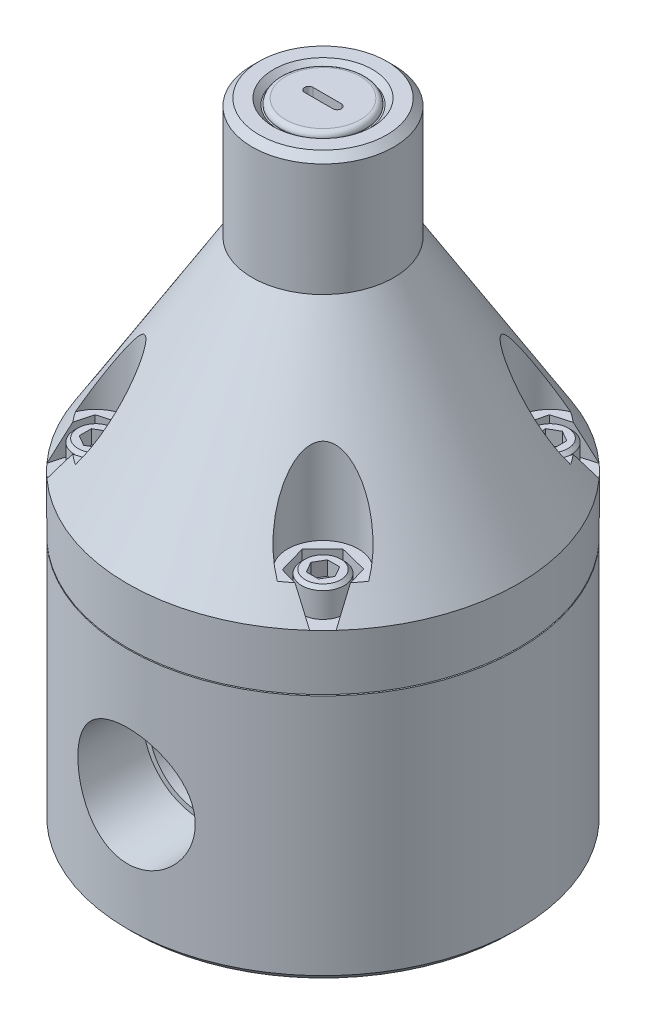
ISO-10303-21;
HEADER;
FILE_DESCRIPTION(('STEP AP214'),'2;1');
FILE_NAME('part.step','',(''),(''),'','','');
FILE_SCHEMA(('AUTOMOTIVE_DESIGN { 1 0 10303 214 1 1 1 1 }'));
ENDSEC;
DATA;
#1=APPLICATION_CONTEXT('core data for automotive mechanical design processes');
#2=APPLICATION_PROTOCOL_DEFINITION('international standard','automotive_design',2000,#1);
#3=PRODUCT_CONTEXT('',#1,'mechanical');
#4=PRODUCT('Part','Part','',(#3));
#5=PRODUCT_RELATED_PRODUCT_CATEGORY('part','',(#4));
#6=PRODUCT_DEFINITION_FORMATION('','',#4);
#7=PRODUCT_DEFINITION_CONTEXT('part definition',#1,'design');
#8=PRODUCT_DEFINITION('design','',#6,#7);
#9=PRODUCT_DEFINITION_SHAPE('','',#8);
#10=(LENGTH_UNIT() NAMED_UNIT(*) SI_UNIT(.MILLI.,.METRE.));
#11=(NAMED_UNIT(*) PLANE_ANGLE_UNIT() SI_UNIT($,.RADIAN.));
#12=(NAMED_UNIT(*) SI_UNIT($,.STERADIAN.) SOLID_ANGLE_UNIT());
#13=UNCERTAINTY_MEASURE_WITH_UNIT(LENGTH_MEASURE(1.E-05),#10,'distance_accuracy_value','');
#14=(GEOMETRIC_REPRESENTATION_CONTEXT(3) GLOBAL_UNCERTAINTY_ASSIGNED_CONTEXT((#13)) GLOBAL_UNIT_ASSIGNED_CONTEXT((#10,
#11,#12)) REPRESENTATION_CONTEXT('',''));
#15=CARTESIAN_POINT('',(0.,0.,0.));
#16=DIRECTION('',(0.,0.,1.));
#17=DIRECTION('',(1.,0.,0.));
#18=AXIS2_PLACEMENT_3D('',#15,#16,#17);
#19=CARTESIAN_POINT('',(0.,68.58,0.));
#20=DIRECTION('',(0.,-1.,0.));
#21=DIRECTION('',(0.,0.,-1.));
#22=AXIS2_PLACEMENT_3D('',#19,#20,#21);
#23=CONICAL_SURFACE('',#22,43.815,0.551031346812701);
#24=CARTESIAN_POINT('',(31.1854504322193,74.9302,-24.909570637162));
#25=CARTESIAN_POINT('',(31.2917993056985,74.4052604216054,-25.2932994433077));
#26=CARTESIAN_POINT('',(31.3977224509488,73.8791142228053,-25.6754921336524));
#27=CARTESIAN_POINT('',(31.6087824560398,72.8246364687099,-26.4370404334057));
#28=CARTESIAN_POINT('',(31.713919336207,72.2963049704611,-26.8163961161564));
#29=CARTESIAN_POINT('',(31.9234771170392,71.2376591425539,-27.5725240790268));
#30=CARTESIAN_POINT('',(32.0278980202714,70.7073448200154,-27.9492963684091));
#31=CARTESIAN_POINT('',(32.2360838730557,69.6448927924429,-28.7004741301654));
#32=CARTESIAN_POINT('',(32.3398488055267,69.1127550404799,-29.0748795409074));
#33=CARTESIAN_POINT('',(32.443312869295,68.5798,-29.4481993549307));
#34=B_SPLINE_CURVE_WITH_KNOTS('',3,(#24,#25,#26,#27,#28,#29,#30,#31,#32,#33),.UNSPECIFIED.,.F.,
.F.,(4,2,2,2,4),(0.,1.97662629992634,3.95320132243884,5.9297692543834,7.90638844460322),.UNSPECIFIED.);
#35=CARTESIAN_POINT('',(31.1854909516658,74.93,-24.9097168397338));
#36=VERTEX_POINT('',#35);
#37=CARTESIAN_POINT('',(32.4432740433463,68.58,-29.4480592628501));
#38=VERTEX_POINT('',#37);
#39=EDGE_CURVE('E658',#36,#38,#34,.T.);
#40=ORIENTED_EDGE('',*,*,#39,.F.);
#41=CARTESIAN_POINT('',(0.,74.93,0.));
#42=DIRECTION('',(0.,1.,0.));
#43=DIRECTION('',(0.,0.,1.));
#44=AXIS2_PLACEMENT_3D('',#41,#42,#43);
#45=CIRCLE('',#44,39.9127653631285);
#46=CARTESIAN_POINT('',(32.8759602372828,74.93,-22.6318376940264));
#47=VERTEX_POINT('',#46);
#48=EDGE_CURVE('E2192',#36,#47,#45,.F.);
#49=ORIENTED_EDGE('',*,*,#48,.T.);
#50=CARTESIAN_POINT('',(32.8760134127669,74.9298,-22.6319772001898));
#51=CARTESIAN_POINT('',(32.8078201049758,75.1861952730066,-22.4531520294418));
#52=CARTESIAN_POINT('',(32.7341907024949,75.4445704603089,-22.2793275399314));
#53=CARTESIAN_POINT('',(32.5770087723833,75.9645959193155,-21.9414911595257));
#54=CARTESIAN_POINT('',(32.4934589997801,76.2262452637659,-21.7774765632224));
#55=CARTESIAN_POINT('',(32.3174500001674,76.7519681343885,-21.4591594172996));
#56=CARTESIAN_POINT('',(32.2250013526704,77.0160384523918,-21.3048456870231));
#57=CARTESIAN_POINT('',(32.0318436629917,77.5464258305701,-21.0055220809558));
#58=CARTESIAN_POINT('',(31.9311339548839,77.8127430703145,-20.8605129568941));
#59=CARTESIAN_POINT('',(31.6173532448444,78.6150033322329,-20.4388792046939));
#60=CARTESIAN_POINT('',(31.3928032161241,79.1537454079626,-20.1759549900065));
#61=CARTESIAN_POINT('',(30.9170512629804,80.2357477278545,-19.6857657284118));
#62=CARTESIAN_POINT('',(30.6658395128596,80.7790095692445,-19.458513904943));
#63=CARTESIAN_POINT('',(30.118158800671,81.9115352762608,-19.022517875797));
#64=CARTESIAN_POINT('',(29.8196739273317,82.5009764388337,-18.8167433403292));
#65=CARTESIAN_POINT('',(29.3524342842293,83.3846139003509,-18.5396319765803));
#66=CARTESIAN_POINT('',(29.1934054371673,83.6791250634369,-18.452507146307));
#67=CARTESIAN_POINT('',(28.8689346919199,84.2675878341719,-18.2889878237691));
#68=CARTESIAN_POINT('',(28.7034932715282,84.5615394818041,-18.2125925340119));
#69=CARTESIAN_POINT('',(28.3660149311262,85.1488284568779,-18.0707333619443));
#70=CARTESIAN_POINT('',(28.1939696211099,85.442164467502,-18.0052839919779));
#71=CARTESIAN_POINT('',(27.8434345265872,86.0273145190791,-17.885863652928));
#72=CARTESIAN_POINT('',(27.6649449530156,86.3191286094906,-17.8318923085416));
#73=CARTESIAN_POINT('',(27.3014619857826,86.9004622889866,-17.7360312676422));
#74=CARTESIAN_POINT('',(27.1164723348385,87.1899830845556,-17.6941347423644));
#75=CARTESIAN_POINT('',(26.7396312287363,87.7661102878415,-17.6231649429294));
#76=CARTESIAN_POINT('',(26.5477800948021,88.0527168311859,-17.5940910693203));
#77=CARTESIAN_POINT('',(26.1388486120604,88.6481794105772,-17.5477736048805));
#78=CARTESIAN_POINT('',(25.9210687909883,88.9566632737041,-17.531860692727));
#79=CARTESIAN_POINT('',(25.4761618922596,89.5671217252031,-17.5184250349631));
#80=CARTESIAN_POINT('',(25.2490377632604,89.8690983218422,-17.5208965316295));
#81=CARTESIAN_POINT('',(24.7853264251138,90.462861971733,-17.546770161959));
#82=CARTESIAN_POINT('',(24.5487844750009,90.7546875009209,-17.5700815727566));
#83=CARTESIAN_POINT('',(24.1854004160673,91.182662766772,-17.6234209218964));
#84=CARTESIAN_POINT('',(24.0628808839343,91.3236542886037,-17.6442539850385));
#85=CARTESIAN_POINT('',(23.8147710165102,91.6017141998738,-17.6926688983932));
#86=CARTESIAN_POINT('',(23.6891808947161,91.7387828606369,-17.7202502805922));
#87=CARTESIAN_POINT('',(23.3476505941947,92.1003741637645,-17.8043004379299));
#88=CARTESIAN_POINT('',(23.1286985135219,92.320550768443,-17.8676208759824));
#89=CARTESIAN_POINT('',(22.6802930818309,92.7420139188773,-18.0200246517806));
#90=CARTESIAN_POINT('',(22.450819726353,92.9432620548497,-18.1091589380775));
#91=CARTESIAN_POINT('',(22.0978320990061,93.2244666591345,-18.2671443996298));
#92=CARTESIAN_POINT('',(21.9777912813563,93.315346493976,-18.3243659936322));
#93=CARTESIAN_POINT('',(21.7355133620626,93.4877899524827,-18.4477596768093));
#94=CARTESIAN_POINT('',(21.6132758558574,93.5693518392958,-18.5139334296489));
#95=CARTESIAN_POINT('',(21.3676920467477,93.7206957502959,-18.6557254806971));
#96=CARTESIAN_POINT('',(21.2443516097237,93.7905207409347,-18.7313074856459));
#97=CARTESIAN_POINT('',(20.997270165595,93.9162293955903,-18.8925662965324));
#98=CARTESIAN_POINT('',(20.8735295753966,93.9721245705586,-18.9782346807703));
#99=CARTESIAN_POINT('',(20.596353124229,94.0793061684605,-19.1825009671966));
#100=CARTESIAN_POINT('',(20.4431915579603,94.1259831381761,-19.303987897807));
#101=CARTESIAN_POINT('',(20.1429486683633,94.1891665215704,-19.561379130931));
#102=CARTESIAN_POINT('',(19.995862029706,94.2056998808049,-19.6972704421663));
#103=CARTESIAN_POINT('',(19.7121854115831,94.2068511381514,-19.9801670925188));
#104=CARTESIAN_POINT('',(19.5756118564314,94.1914201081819,-20.1271891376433));
#105=CARTESIAN_POINT('',(19.3168358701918,94.130256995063,-20.4274436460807));
#106=CARTESIAN_POINT('',(19.1946462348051,94.0844981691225,-20.5806814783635));
#107=CARTESIAN_POINT('',(18.9333227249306,93.9499537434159,-20.9335168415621));
#108=CARTESIAN_POINT('',(18.7994959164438,93.8525556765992,-21.1337148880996));
#109=CARTESIAN_POINT('',(18.5575341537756,93.6253225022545,-21.5311982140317));
#110=CARTESIAN_POINT('',(18.4494578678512,93.4954146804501,-21.7284758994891));
#111=CARTESIAN_POINT('',(18.2734255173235,93.2378861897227,-22.0822323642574));
#112=CARTESIAN_POINT('',(18.2017503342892,93.114033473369,-22.2396830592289));
#113=CARTESIAN_POINT('',(18.0717731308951,92.8543658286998,-22.5502860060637));
#114=CARTESIAN_POINT('',(18.0134803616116,92.7185427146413,-22.7034352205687));
#115=CARTESIAN_POINT('',(17.9085459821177,92.4375711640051,-23.0055063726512));
#116=CARTESIAN_POINT('',(17.8619238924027,92.2924076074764,-23.1544208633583));
#117=CARTESIAN_POINT('',(17.7789950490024,91.9949331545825,-23.4479825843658));
#118=CARTESIAN_POINT('',(17.7426923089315,91.842619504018,-23.5926281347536));
#119=CARTESIAN_POINT('',(17.6793668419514,91.5330276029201,-23.877261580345));
#120=CARTESIAN_POINT('',(17.6523073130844,91.3757718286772,-24.0172658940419));
#121=CARTESIAN_POINT('',(17.6063247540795,91.0568516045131,-24.2934532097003));
#122=CARTESIAN_POINT('',(17.5874006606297,90.8951877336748,-24.4296367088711));
#123=CARTESIAN_POINT('',(17.5416007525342,90.4045581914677,-24.8331155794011));
#124=CARTESIAN_POINT('',(17.5257415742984,90.0701857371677,-25.0951300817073));
#125=CARTESIAN_POINT('',(17.5187750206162,89.3910127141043,-25.6073018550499));
#126=CARTESIAN_POINT('',(17.5277362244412,89.0461858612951,-25.8574243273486));
#127=CARTESIAN_POINT('',(17.5674604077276,88.3499543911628,-26.346266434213));
#128=CARTESIAN_POINT('',(17.5982177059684,87.9985515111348,-26.5849890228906));
#129=CARTESIAN_POINT('',(17.6752315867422,87.3273950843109,-27.0279886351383));
#130=CARTESIAN_POINT('',(17.7195760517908,87.0080899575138,-27.2332880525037));
#131=CARTESIAN_POINT('',(17.8230232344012,86.366765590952,-27.6358491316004));
#132=CARTESIAN_POINT('',(17.8821279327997,86.0447459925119,-27.8331097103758));
#133=CARTESIAN_POINT('',(18.0143479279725,85.3986613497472,-28.2199078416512));
#134=CARTESIAN_POINT('',(18.0874725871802,85.0745950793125,-28.4094401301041));
#135=CARTESIAN_POINT('',(18.247146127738,84.4253288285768,-28.7807004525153));
#136=CARTESIAN_POINT('',(18.3336943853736,84.100128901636,-28.9624288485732));
#137=CARTESIAN_POINT('',(18.5196821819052,83.4497138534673,-29.3177238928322));
#138=CARTESIAN_POINT('',(18.6190998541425,83.1244996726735,-29.4913037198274));
#139=CARTESIAN_POINT('',(18.8307065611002,82.4740292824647,-29.830436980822));
#140=CARTESIAN_POINT('',(18.9428959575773,82.1487730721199,-29.9959901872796));
#141=CARTESIAN_POINT('',(19.1798765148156,81.4988617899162,-30.3186806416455));
#142=CARTESIAN_POINT('',(19.3046623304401,81.1742065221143,-30.4758214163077));
#143=CARTESIAN_POINT('',(19.566846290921,80.5258852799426,-30.7813029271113));
#144=CARTESIAN_POINT('',(19.7042435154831,80.2022192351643,-30.929644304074));
#145=CARTESIAN_POINT('',(20.0356080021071,79.4577845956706,-31.2608218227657));
#146=CARTESIAN_POINT('',(20.2340425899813,79.0375277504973,-31.4403688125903));
#147=CARTESIAN_POINT('',(20.6528330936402,78.2009180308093,-31.7817933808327));
#148=CARTESIAN_POINT('',(20.8731810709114,77.7845638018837,-31.943677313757));
#149=CARTESIAN_POINT('',(21.2204706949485,77.1642648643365,-32.1715277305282));
#150=CARTESIAN_POINT('',(21.3389735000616,76.9582923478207,-32.244953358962));
#151=CARTESIAN_POINT('',(21.5816967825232,76.5479021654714,-32.3865049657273));
#152=CARTESIAN_POINT('',(21.7059169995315,76.3434844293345,-32.454631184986));
#153=CARTESIAN_POINT('',(21.9602864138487,75.936277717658,-32.5852592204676));
#154=CARTESIAN_POINT('',(22.0904406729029,75.7334903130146,-32.647756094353));
#155=CARTESIAN_POINT('',(22.3567119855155,75.3299985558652,-32.7666088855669));
#156=CARTESIAN_POINT('',(22.4928299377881,75.1292945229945,-32.8229638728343));
#157=CARTESIAN_POINT('',(22.6319772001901,74.9298,-32.8760134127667));
#158=B_SPLINE_CURVE_WITH_KNOTS('',3,(#50,#51,#52,#53,#54,#55,#56,#57,#58,#59,#60,#61,#62,#63,
#64,#65,#66,#67,#68,#69,#70,#71,#72,#73,#74,#75,#76,#77,#78,#79,#80,#81,#82,#83,#84,#85,#86,#87,
#88,#89,#90,#91,#92,#93,#94,#95,#96,#97,#98,#99,#100,#101,#102,#103,#104,#105,#106,#107,#108,
#109,#110,#111,#112,#113,#114,#115,#116,#117,#118,#119,#120,#121,#122,#123,#124,#125,#126,#127,
#128,#129,#130,#131,#132,#133,#134,#135,#136,#137,#138,#139,#140,#141,#142,#143,#144,#145,#146,
#147,#148,#149,#150,#151,#152,#153,#154,#155,#156,#157),.UNSPECIFIED.,.F.,.F.,(4,2,2,2,2,2,2,2,
2,2,2,2,2,2,2,2,2,2,2,2,2,2,2,2,2,2,2,2,2,2,2,2,2,2,2,2,2,2,2,2,2,2,2,2,2,2,2,2,2,2,2,2,2,4),
(0.,0.959681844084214,1.9190977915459,2.87738689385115,3.83575332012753,5.75433905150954,
7.67363431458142,9.74768208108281,10.7850777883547,11.8223963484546,12.8610794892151,
13.8997286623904,14.9377892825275,15.9758013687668,17.1090815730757,18.2420068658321,
19.3700240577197,19.9337037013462,20.4973442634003,21.4467185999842,22.3979796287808,
22.8807596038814,23.363629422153,23.8446911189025,24.3253539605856,24.9256472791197,
25.5254037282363,26.1260789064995,26.7272844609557,27.5022221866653,28.2789089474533,
28.9163059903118,29.5541423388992,30.193038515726,30.8321828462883,31.4687519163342,
32.1052377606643,33.3791509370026,34.6565874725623,35.9336911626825,37.0798743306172,
38.2262114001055,39.3733166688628,40.520368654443,41.665496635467,42.8106570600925,
43.9553335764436,45.0999266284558,46.5938371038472,48.0872083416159,48.8332472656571,
49.5792522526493,50.325905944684,51.0726725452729),.UNSPECIFIED.);
#159=CARTESIAN_POINT('',(22.6318376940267,74.93,-32.8759602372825));
#160=VERTEX_POINT('',#159);
#161=EDGE_CURVE('E793',#47,#160,#158,.T.);
#162=ORIENTED_EDGE('',*,*,#161,.T.);
#163=CARTESIAN_POINT('',(24.9752922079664,74.93,-31.1329988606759));
#164=VERTEX_POINT('',#163);
#165=EDGE_CURVE('E801',#160,#164,#45,.F.);
#166=ORIENTED_EDGE('',*,*,#165,.T.);
#167=CARTESIAN_POINT('',(29.4766640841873,68.5798,-32.4174531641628));
#168=CARTESIAN_POINT('',(29.1062316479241,69.1125841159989,-32.3117512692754));
#169=CARTESIAN_POINT('',(28.7347583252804,69.6445870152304,-32.2057523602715));
#170=CARTESIAN_POINT('',(27.9895431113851,70.7068520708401,-31.9931072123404));
#171=CARTESIAN_POINT('',(27.6158012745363,71.2371142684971,-31.8864609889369));
#172=CARTESIAN_POINT('',(26.8658433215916,72.2957468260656,-31.6724625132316));
#173=CARTESIAN_POINT('',(26.4896271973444,72.8241171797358,-31.5651102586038));
#174=CARTESIAN_POINT('',(25.7344797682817,73.8787747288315,-31.3496309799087));
#175=CARTESIAN_POINT('',(25.3555483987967,74.4050618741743,-31.2415039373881));
#176=CARTESIAN_POINT('',(24.9751473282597,74.9302,-31.132957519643));
#177=B_SPLINE_CURVE_WITH_KNOTS('',3,(#167,#168,#169,#170,#171,#172,#173,#174,#175,#176),
.UNSPECIFIED.,.F.,.F.,(4,2,2,2,4),(0.,1.97237650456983,3.9447058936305,5.91704178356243,
7.88942480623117),.UNSPECIFIED.);
#178=CARTESIAN_POINT('',(29.4765250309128,68.58,-32.4174134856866));
#179=VERTEX_POINT('',#178);
#180=EDGE_CURVE('E645',#179,#164,#177,.T.);
#181=ORIENTED_EDGE('',*,*,#180,.F.);
#182=CARTESIAN_POINT('',(0.,68.58,0.));
#183=DIRECTION('',(0.,-1.,0.));
#184=DIRECTION('',(0.,0.,-1.));
#185=AXIS2_PLACEMENT_3D('',#182,#183,#184);
#186=CIRCLE('',#185,43.815);
#187=CARTESIAN_POINT('',(-29.4480592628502,68.58,-32.4432740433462));
#188=VERTEX_POINT('',#187);
#189=EDGE_CURVE('E1169',#188,#179,#186,.T.);
#190=ORIENTED_EDGE('',*,*,#189,.F.);
#191=CARTESIAN_POINT('',(-24.9095706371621,74.9302,-31.1854504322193));
#192=CARTESIAN_POINT('',(-25.2932994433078,74.4052604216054,-31.2917993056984));
#193=CARTESIAN_POINT('',(-25.6754921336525,73.8791142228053,-31.3977224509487));
#194=CARTESIAN_POINT('',(-26.4370404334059,72.8246364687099,-31.6087824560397));
#195=CARTESIAN_POINT('',(-26.8163961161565,72.2963049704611,-31.7139193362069));
#196=CARTESIAN_POINT('',(-27.5725240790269,71.2376591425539,-31.9234771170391));
#197=CARTESIAN_POINT('',(-27.9492963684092,70.7073448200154,-32.0278980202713));
#198=CARTESIAN_POINT('',(-28.7004741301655,69.6448927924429,-32.2360838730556));
#199=CARTESIAN_POINT('',(-29.0748795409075,69.1127550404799,-32.3398488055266));
#200=CARTESIAN_POINT('',(-29.4481993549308,68.5798,-32.4433128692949));
#201=B_SPLINE_CURVE_WITH_KNOTS('',3,(#191,#192,#193,#194,#195,#196,#197,#198,#199,#200),
.UNSPECIFIED.,.F.,.F.,(4,2,2,2,4),(0.,1.97662629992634,3.95320132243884,5.9297692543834,
7.90638844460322),.UNSPECIFIED.);
#202=CARTESIAN_POINT('',(-24.9097168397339,74.93,-31.1854909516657));
#203=VERTEX_POINT('',#202);
#204=EDGE_CURVE('E714',#203,#188,#201,.T.);
#205=ORIENTED_EDGE('',*,*,#204,.F.);
#206=CARTESIAN_POINT('',(0.,74.93,0.));
#207=DIRECTION('',(0.,1.,0.));
#208=DIRECTION('',(0.,0.,1.));
#209=AXIS2_PLACEMENT_3D('',#206,#207,#208);
#210=CIRCLE('',#209,39.9127653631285);
#211=CARTESIAN_POINT('',(-22.6318376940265,74.93,-32.8759602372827));
#212=VERTEX_POINT('',#211);
#213=EDGE_CURVE('E1483',#203,#212,#210,.F.);
#214=ORIENTED_EDGE('',*,*,#213,.T.);
#215=CARTESIAN_POINT('',(-22.6319772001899,74.9298,-32.8760134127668));
#216=CARTESIAN_POINT('',(-22.4531520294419,75.1861952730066,-32.8078201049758));
#217=CARTESIAN_POINT('',(-22.2793275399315,75.4445704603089,-32.7341907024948));
#218=CARTESIAN_POINT('',(-21.9414911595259,75.9645959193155,-32.5770087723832));
#219=CARTESIAN_POINT('',(-21.7774765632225,76.2262452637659,-32.49345899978));
#220=CARTESIAN_POINT('',(-21.4591594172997,76.7519681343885,-32.3174500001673));
#221=CARTESIAN_POINT('',(-21.3048456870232,77.0160384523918,-32.2250013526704));
#222=CARTESIAN_POINT('',(-21.0055220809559,77.5464258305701,-32.0318436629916));
#223=CARTESIAN_POINT('',(-20.8605129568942,77.8127430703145,-31.9311339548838));
#224=CARTESIAN_POINT('',(-20.438879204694,78.6150033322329,-31.6173532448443));
#225=CARTESIAN_POINT('',(-20.1759549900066,79.1537454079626,-31.392803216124));
#226=CARTESIAN_POINT('',(-19.6857657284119,80.2357477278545,-30.9170512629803));
#227=CARTESIAN_POINT('',(-19.4585139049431,80.7790095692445,-30.6658395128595));
#228=CARTESIAN_POINT('',(-19.0225178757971,81.9115352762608,-30.1181588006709));
#229=CARTESIAN_POINT('',(-18.8167433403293,82.5009764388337,-29.8196739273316));
#230=CARTESIAN_POINT('',(-18.5396319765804,83.3846139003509,-29.3524342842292));
#231=CARTESIAN_POINT('',(-18.4525071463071,83.6791250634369,-29.1934054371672));
#232=CARTESIAN_POINT('',(-18.2889878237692,84.2675878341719,-28.8689346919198));
#233=CARTESIAN_POINT('',(-18.212592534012,84.5615394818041,-28.7034932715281));
#234=CARTESIAN_POINT('',(-18.0707333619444,85.148828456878,-28.3660149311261));
#235=CARTESIAN_POINT('',(-18.005283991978,85.4421644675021,-28.1939696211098));
#236=CARTESIAN_POINT('',(-17.8858636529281,86.0273145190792,-27.8434345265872));
#237=CARTESIAN_POINT('',(-17.8318923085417,86.3191286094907,-27.6649449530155));
#238=CARTESIAN_POINT('',(-17.7360312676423,86.9004622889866,-27.3014619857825));
#239=CARTESIAN_POINT('',(-17.6941347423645,87.1899830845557,-27.1164723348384));
#240=CARTESIAN_POINT('',(-17.6231649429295,87.7661102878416,-26.7396312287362));
#241=CARTESIAN_POINT('',(-17.5940910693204,88.052716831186,-26.547780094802));
#242=CARTESIAN_POINT('',(-17.5477736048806,88.6481794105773,-26.1388486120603));
#243=CARTESIAN_POINT('',(-17.5318606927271,88.9566632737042,-25.9210687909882));
#244=CARTESIAN_POINT('',(-17.5184250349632,89.5671217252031,-25.4761618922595));
#245=CARTESIAN_POINT('',(-17.5208965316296,89.8690983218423,-25.2490377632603));
#246=CARTESIAN_POINT('',(-17.5467701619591,90.462861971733,-24.7853264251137));
#247=CARTESIAN_POINT('',(-17.5700815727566,90.754687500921,-24.5487844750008));
#248=CARTESIAN_POINT('',(-17.6234209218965,91.1826627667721,-24.1854004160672));
#249=CARTESIAN_POINT('',(-17.6442539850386,91.3236542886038,-24.0628808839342));
#250=CARTESIAN_POINT('',(-17.6926688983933,91.6017141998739,-23.8147710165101));
#251=CARTESIAN_POINT('',(-17.7202502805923,91.7387828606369,-23.6891808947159));
#252=CARTESIAN_POINT('',(-17.80430043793,92.1003741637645,-23.3476505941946));
#253=CARTESIAN_POINT('',(-17.8676208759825,92.320550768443,-23.1286985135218));
#254=CARTESIAN_POINT('',(-18.0200246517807,92.7420139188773,-22.6802930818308));
#255=CARTESIAN_POINT('',(-18.1091589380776,92.9432620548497,-22.4508197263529));
#256=CARTESIAN_POINT('',(-18.2671443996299,93.2244666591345,-22.097832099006));
#257=CARTESIAN_POINT('',(-18.3243659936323,93.3153464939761,-21.9777912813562));
#258=CARTESIAN_POINT('',(-18.4477596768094,93.4877899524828,-21.7355133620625));
#259=CARTESIAN_POINT('',(-18.513933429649,93.5693518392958,-21.6132758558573));
#260=CARTESIAN_POINT('',(-18.6557254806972,93.7206957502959,-21.3676920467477));
#261=CARTESIAN_POINT('',(-18.731307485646,93.7905207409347,-21.2443516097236));
#262=CARTESIAN_POINT('',(-18.8925662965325,93.9162293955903,-20.9972701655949));
#263=CARTESIAN_POINT('',(-18.9782346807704,93.9721245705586,-20.8735295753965));
#264=CARTESIAN_POINT('',(-19.1825009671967,94.0793061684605,-20.5963531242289));
#265=CARTESIAN_POINT('',(-19.3039878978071,94.1259831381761,-20.4431915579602));
#266=CARTESIAN_POINT('',(-19.5613791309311,94.1891665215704,-20.1429486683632));
#267=CARTESIAN_POINT('',(-19.6972704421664,94.2056998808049,-19.9958620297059));
#268=CARTESIAN_POINT('',(-19.9801670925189,94.2068511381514,-19.7121854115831));
#269=CARTESIAN_POINT('',(-20.1271891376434,94.1914201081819,-19.5756118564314));
#270=CARTESIAN_POINT('',(-20.4274436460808,94.130256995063,-19.3168358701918));
#271=CARTESIAN_POINT('',(-20.5806814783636,94.0844981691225,-19.194646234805));
#272=CARTESIAN_POINT('',(-20.9335168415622,93.9499537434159,-18.9333227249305));
#273=CARTESIAN_POINT('',(-21.1337148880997,93.8525556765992,-18.7994959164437));
#274=CARTESIAN_POINT('',(-21.5311982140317,93.6253225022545,-18.5575341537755));
#275=CARTESIAN_POINT('',(-21.7284758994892,93.4954146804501,-18.4494578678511));
#276=CARTESIAN_POINT('',(-22.0822323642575,93.2378861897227,-18.2734255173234));
#277=CARTESIAN_POINT('',(-22.239683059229,93.114033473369,-18.2017503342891));
#278=CARTESIAN_POINT('',(-22.5502860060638,92.8543658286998,-18.071773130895));
#279=CARTESIAN_POINT('',(-22.7034352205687,92.7185427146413,-18.0134803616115));
#280=CARTESIAN_POINT('',(-23.0055063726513,92.437571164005,-17.9085459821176));
#281=CARTESIAN_POINT('',(-23.1544208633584,92.2924076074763,-17.8619238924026));
#282=CARTESIAN_POINT('',(-23.4479825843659,91.9949331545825,-17.7789950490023));
#283=CARTESIAN_POINT('',(-23.5926281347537,91.842619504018,-17.7426923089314));
#284=CARTESIAN_POINT('',(-23.8772615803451,91.5330276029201,-17.6793668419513));
#285=CARTESIAN_POINT('',(-24.017265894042,91.3757718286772,-17.6523073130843));
#286=CARTESIAN_POINT('',(-24.2934532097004,91.0568516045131,-17.6063247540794));
#287=CARTESIAN_POINT('',(-24.4296367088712,90.8951877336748,-17.5874006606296));
#288=CARTESIAN_POINT('',(-24.8331155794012,90.4045581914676,-17.5416007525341));
#289=CARTESIAN_POINT('',(-25.0951300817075,90.0701857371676,-17.5257415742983));
#290=CARTESIAN_POINT('',(-25.60730185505,89.3910127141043,-17.5187750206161));
#291=CARTESIAN_POINT('',(-25.8574243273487,89.046185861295,-17.5277362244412));
#292=CARTESIAN_POINT('',(-26.3462664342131,88.3499543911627,-17.5674604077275));
#293=CARTESIAN_POINT('',(-26.5849890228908,87.9985515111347,-17.5982177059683));
#294=CARTESIAN_POINT('',(-27.0279886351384,87.3273950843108,-17.6752315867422));
#295=CARTESIAN_POINT('',(-27.2332880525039,87.0080899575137,-17.7195760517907));
#296=CARTESIAN_POINT('',(-27.6358491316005,86.366765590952,-17.8230232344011));
#297=CARTESIAN_POINT('',(-27.8331097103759,86.0447459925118,-17.8821279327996));
#298=CARTESIAN_POINT('',(-28.2199078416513,85.3986613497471,-18.0143479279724));
#299=CARTESIAN_POINT('',(-28.4094401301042,85.0745950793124,-18.0874725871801));
#300=CARTESIAN_POINT('',(-28.7807004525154,84.4253288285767,-18.2471461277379));
#301=CARTESIAN_POINT('',(-28.9624288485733,84.1001289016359,-18.3336943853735));
#302=CARTESIAN_POINT('',(-29.3177238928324,83.4497138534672,-18.5196821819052));
#303=CARTESIAN_POINT('',(-29.4913037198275,83.1244996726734,-18.6190998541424));
#304=CARTESIAN_POINT('',(-29.8304369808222,82.4740292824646,-18.8307065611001));
#305=CARTESIAN_POINT('',(-29.9959901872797,82.1487730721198,-18.9428959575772));
#306=CARTESIAN_POINT('',(-30.3186806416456,81.498861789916,-19.1798765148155));
#307=CARTESIAN_POINT('',(-30.4758214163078,81.1742065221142,-19.3046623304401));
#308=CARTESIAN_POINT('',(-30.7813029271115,80.5258852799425,-19.5668462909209));
#309=CARTESIAN_POINT('',(-30.9296443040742,80.2022192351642,-19.7042435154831));
#310=CARTESIAN_POINT('',(-31.2608218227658,79.4577845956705,-20.0356080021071));
#311=CARTESIAN_POINT('',(-31.4403688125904,79.0375277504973,-20.2340425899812));
#312=CARTESIAN_POINT('',(-31.7817933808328,78.2009180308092,-20.6528330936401));
#313=CARTESIAN_POINT('',(-31.9436773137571,77.7845638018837,-20.8731810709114));
#314=CARTESIAN_POINT('',(-32.1715277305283,77.1642648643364,-21.2204706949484));
#315=CARTESIAN_POINT('',(-32.2449533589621,76.9582923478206,-21.3389735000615));
#316=CARTESIAN_POINT('',(-32.3865049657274,76.5479021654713,-21.5816967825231));
#317=CARTESIAN_POINT('',(-32.4546311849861,76.3434844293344,-21.7059169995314));
#318=CARTESIAN_POINT('',(-32.5852592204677,75.9362777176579,-21.9602864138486));
#319=CARTESIAN_POINT('',(-32.6477560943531,75.7334903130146,-22.0904406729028));
#320=CARTESIAN_POINT('',(-32.766608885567,75.3299985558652,-22.3567119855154));
#321=CARTESIAN_POINT('',(-32.8229638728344,75.1292945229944,-22.492829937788));
#322=CARTESIAN_POINT('',(-32.8760134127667,74.9298,-22.63197720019));
#323=B_SPLINE_CURVE_WITH_KNOTS('',3,(#215,#216,#217,#218,#219,#220,#221,#222,#223,#224,#225,
#226,#227,#228,#229,#230,#231,#232,#233,#234,#235,#236,#237,#238,#239,#240,#241,#242,#243,#244,
#245,#246,#247,#248,#249,#250,#251,#252,#253,#254,#255,#256,#257,#258,#259,#260,#261,#262,#263,
#264,#265,#266,#267,#268,#269,#270,#271,#272,#273,#274,#275,#276,#277,#278,#279,#280,#281,#282,
#283,#284,#285,#286,#287,#288,#289,#290,#291,#292,#293,#294,#295,#296,#297,#298,#299,#300,#301,
#302,#303,#304,#305,#306,#307,#308,#309,#310,#311,#312,#313,#314,#315,#316,#317,#318,#319,#320,
#321,#322),.UNSPECIFIED.,.F.,.F.,(4,2,2,2,2,2,2,2,2,2,2,2,2,2,2,2,2,2,2,2,2,2,2,2,2,2,2,2,2,2,2,
2,2,2,2,2,2,2,2,2,2,2,2,2,2,2,2,2,2,2,2,2,2,4),(0.,0.959681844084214,1.9190977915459,
2.87738689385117,3.83575332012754,5.75433905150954,7.67363431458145,9.74768208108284,
10.7850777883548,11.8223963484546,12.8610794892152,13.8997286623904,14.9377892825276,
15.9758013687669,17.1090815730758,18.2420068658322,19.3700240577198,19.9337037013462,
20.4973442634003,21.4467185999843,22.3979796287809,22.8807596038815,23.3636294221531,
23.8446911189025,24.3253539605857,24.9256472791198,25.5254037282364,26.1260789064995,
26.7272844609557,27.5022221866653,28.2789089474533,28.9163059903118,29.5541423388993,
30.193038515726,30.8321828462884,31.4687519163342,32.1052377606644,33.3791509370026,
34.6565874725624,35.9336911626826,37.0798743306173,38.2262114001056,39.373316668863,
40.5203686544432,41.6654966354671,42.8106570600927,43.9553335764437,45.0999266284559,
46.5938371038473,48.0872083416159,48.8332472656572,49.5792522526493,50.3259059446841,
51.0726725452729),.UNSPECIFIED.);
#324=CARTESIAN_POINT('',(-32.8759602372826,74.93,-22.6318376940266));
#325=VERTEX_POINT('',#324);
#326=EDGE_CURVE('E2191',#212,#325,#323,.T.);
#327=ORIENTED_EDGE('',*,*,#326,.T.);
#328=CARTESIAN_POINT('',(-31.132998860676,74.93,-24.9752922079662));
#329=VERTEX_POINT('',#328);
#330=EDGE_CURVE('E1211',#325,#329,#210,.F.);
#331=ORIENTED_EDGE('',*,*,#330,.T.);
#332=CARTESIAN_POINT('',(-32.4174531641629,68.5798,-29.4766640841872));
#333=CARTESIAN_POINT('',(-32.3117512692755,69.1125841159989,-29.106231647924));
#334=CARTESIAN_POINT('',(-32.2057523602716,69.6445870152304,-28.7347583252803));
#335=CARTESIAN_POINT('',(-31.9931072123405,70.7068520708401,-27.989543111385));
#336=CARTESIAN_POINT('',(-31.886460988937,71.2371142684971,-27.6158012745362));
#337=CARTESIAN_POINT('',(-31.6724625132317,72.2957468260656,-26.8658433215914));
#338=CARTESIAN_POINT('',(-31.5651102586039,72.8241171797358,-26.4896271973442));
#339=CARTESIAN_POINT('',(-31.3496309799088,73.8787747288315,-25.7344797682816));
#340=CARTESIAN_POINT('',(-31.2415039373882,74.4050618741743,-25.3555483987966));
#341=CARTESIAN_POINT('',(-31.1329575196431,74.9302,-24.9751473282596));
#342=B_SPLINE_CURVE_WITH_KNOTS('',3,(#332,#333,#334,#335,#336,#337,#338,#339,#340,#341),
.UNSPECIFIED.,.F.,.F.,(4,2,2,2,4),(0.,1.9723765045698,3.94470589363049,5.91704178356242,
7.88942480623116),.UNSPECIFIED.);
#343=CARTESIAN_POINT('',(-32.4174134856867,68.58,-29.4765250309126));
#344=VERTEX_POINT('',#343);
#345=EDGE_CURVE('E708',#344,#329,#342,.T.);
#346=ORIENTED_EDGE('',*,*,#345,.F.);
#347=CARTESIAN_POINT('',(-32.4432740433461,68.58,29.4480592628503));
#348=VERTEX_POINT('',#347);
#349=EDGE_CURVE('E1174',#348,#344,#186,.T.);
#350=ORIENTED_EDGE('',*,*,#349,.F.);
#351=CARTESIAN_POINT('',(-31.1854504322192,74.9302,24.9095706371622));
#352=CARTESIAN_POINT('',(-31.2917993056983,74.4052604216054,25.2932994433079));
#353=CARTESIAN_POINT('',(-31.3977224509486,73.8791142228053,25.6754921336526));
#354=CARTESIAN_POINT('',(-31.6087824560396,72.8246364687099,26.437040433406));
#355=CARTESIAN_POINT('',(-31.7139193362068,72.2963049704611,26.8163961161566));
#356=CARTESIAN_POINT('',(-31.9234771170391,71.2376591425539,27.572524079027));
#357=CARTESIAN_POINT('',(-32.0278980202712,70.7073448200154,27.9492963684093));
#358=CARTESIAN_POINT('',(-32.2360838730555,69.6448927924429,28.7004741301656));
#359=CARTESIAN_POINT('',(-32.3398488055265,69.1127550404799,29.0748795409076));
#360=CARTESIAN_POINT('',(-32.4433128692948,68.5798,29.4481993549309));
#361=B_SPLINE_CURVE_WITH_KNOTS('',3,(#351,#352,#353,#354,#355,#356,#357,#358,#359,#360),
.UNSPECIFIED.,.F.,.F.,(4,2,2,2,4),(0.,1.97662629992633,3.95320132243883,5.9297692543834,
7.90638844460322),.UNSPECIFIED.);
#362=CARTESIAN_POINT('',(-31.1854909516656,74.93,24.9097168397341));
#363=VERTEX_POINT('',#362);
#364=EDGE_CURVE('E762',#363,#348,#361,.T.);
#365=ORIENTED_EDGE('',*,*,#364,.F.);
#366=CARTESIAN_POINT('',(0.,74.93,0.));
#367=DIRECTION('',(0.,1.,0.));
#368=DIRECTION('',(0.,0.,1.));
#369=AXIS2_PLACEMENT_3D('',#366,#367,#368);
#370=CIRCLE('',#369,39.9127653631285);
#371=CARTESIAN_POINT('',(-32.8759602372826,74.93,22.6318376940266));
#372=VERTEX_POINT('',#371);
#373=EDGE_CURVE('E1480',#363,#372,#370,.F.);
#374=ORIENTED_EDGE('',*,*,#373,.T.);
#375=CARTESIAN_POINT('',(-32.8760134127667,74.9298,22.63197720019));
#376=CARTESIAN_POINT('',(-32.8078201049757,75.1861952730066,22.453152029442));
#377=CARTESIAN_POINT('',(-32.7341907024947,75.4445704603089,22.2793275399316));
#378=CARTESIAN_POINT('',(-32.5770087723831,75.9645959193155,21.941491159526));
#379=CARTESIAN_POINT('',(-32.4934589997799,76.2262452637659,21.7774765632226));
#380=CARTESIAN_POINT('',(-32.3174500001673,76.7519681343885,21.4591594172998));
#381=CARTESIAN_POINT('',(-32.2250013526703,77.0160384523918,21.3048456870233));
#382=CARTESIAN_POINT('',(-32.0318436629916,77.5464258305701,21.005522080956));
#383=CARTESIAN_POINT('',(-31.9311339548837,77.8127430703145,20.8605129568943));
#384=CARTESIAN_POINT('',(-31.6173532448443,78.6150033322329,20.4388792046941));
#385=CARTESIAN_POINT('',(-31.3928032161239,79.1537454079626,20.1759549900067));
#386=CARTESIAN_POINT('',(-30.9170512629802,80.2357477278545,19.685765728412));
#387=CARTESIAN_POINT('',(-30.6658395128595,80.7790095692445,19.4585139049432));
#388=CARTESIAN_POINT('',(-30.1181588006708,81.9115352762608,19.0225178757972));
#389=CARTESIAN_POINT('',(-29.8196739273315,82.5009764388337,18.8167433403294));
#390=CARTESIAN_POINT('',(-29.3524342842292,83.3846139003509,18.5396319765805));
#391=CARTESIAN_POINT('',(-29.1934054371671,83.6791250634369,18.4525071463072));
#392=CARTESIAN_POINT('',(-28.8689346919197,84.2675878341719,18.2889878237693));
#393=CARTESIAN_POINT('',(-28.703493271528,84.5615394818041,18.2125925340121));
#394=CARTESIAN_POINT('',(-28.3660149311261,85.1488284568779,18.0707333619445));
#395=CARTESIAN_POINT('',(-28.1939696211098,85.442164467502,18.0052839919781));
#396=CARTESIAN_POINT('',(-27.8434345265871,86.0273145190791,17.8858636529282));
#397=CARTESIAN_POINT('',(-27.6649449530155,86.3191286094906,17.8318923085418));
#398=CARTESIAN_POINT('',(-27.3014619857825,86.9004622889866,17.7360312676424));
#399=CARTESIAN_POINT('',(-27.1164723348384,87.1899830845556,17.6941347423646));
#400=CARTESIAN_POINT('',(-26.7396312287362,87.7661102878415,17.6231649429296));
#401=CARTESIAN_POINT('',(-26.5477800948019,88.0527168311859,17.5940910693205));
#402=CARTESIAN_POINT('',(-26.1388486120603,88.6481794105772,17.5477736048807));
#403=CARTESIAN_POINT('',(-25.9210687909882,88.9566632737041,17.5318606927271));
#404=CARTESIAN_POINT('',(-25.4761618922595,89.5671217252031,17.5184250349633));
#405=CARTESIAN_POINT('',(-25.2490377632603,89.8690983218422,17.5208965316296));
#406=CARTESIAN_POINT('',(-24.7853264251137,90.462861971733,17.5467701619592));
#407=CARTESIAN_POINT('',(-24.5487844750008,90.7546875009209,17.5700815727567));
#408=CARTESIAN_POINT('',(-24.1854004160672,91.1826627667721,17.6234209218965));
#409=CARTESIAN_POINT('',(-24.0628808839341,91.3236542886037,17.6442539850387));
#410=CARTESIAN_POINT('',(-23.8147710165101,91.6017141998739,17.6926688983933));
#411=CARTESIAN_POINT('',(-23.6891808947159,91.7387828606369,17.7202502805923));
#412=CARTESIAN_POINT('',(-23.3476505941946,92.1003741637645,17.80430043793));
#413=CARTESIAN_POINT('',(-23.1286985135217,92.320550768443,17.8676208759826));
#414=CARTESIAN_POINT('',(-22.6802930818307,92.7420139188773,18.0200246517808));
#415=CARTESIAN_POINT('',(-22.4508197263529,92.9432620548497,18.1091589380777));
#416=CARTESIAN_POINT('',(-22.0978320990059,93.2244666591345,18.2671443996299));
#417=CARTESIAN_POINT('',(-21.9777912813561,93.315346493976,18.3243659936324));
#418=CARTESIAN_POINT('',(-21.7355133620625,93.4877899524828,18.4477596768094));
#419=CARTESIAN_POINT('',(-21.6132758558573,93.5693518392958,18.5139334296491));
#420=CARTESIAN_POINT('',(-21.3676920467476,93.7206957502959,18.6557254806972));
#421=CARTESIAN_POINT('',(-21.2443516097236,93.7905207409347,18.7313074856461));
#422=CARTESIAN_POINT('',(-20.9972701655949,93.9162293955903,18.8925662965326));
#423=CARTESIAN_POINT('',(-20.8735295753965,93.9721245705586,18.9782346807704));
#424=CARTESIAN_POINT('',(-20.5963531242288,94.0793061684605,19.1825009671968));
#425=CARTESIAN_POINT('',(-20.4431915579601,94.1259831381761,19.3039878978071));
#426=CARTESIAN_POINT('',(-20.1429486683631,94.1891665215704,19.5613791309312));
#427=CARTESIAN_POINT('',(-19.9958620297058,94.2056998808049,19.6972704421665));
#428=CARTESIAN_POINT('',(-19.712185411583,94.2068511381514,19.980167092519));
#429=CARTESIAN_POINT('',(-19.5756118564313,94.1914201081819,20.1271891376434));
#430=CARTESIAN_POINT('',(-19.3168358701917,94.130256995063,20.4274436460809));
#431=CARTESIAN_POINT('',(-19.194646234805,94.0844981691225,20.5806814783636));
#432=CARTESIAN_POINT('',(-18.9333227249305,93.9499537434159,20.9335168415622));
#433=CARTESIAN_POINT('',(-18.7994959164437,93.8525556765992,21.1337148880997));
#434=CARTESIAN_POINT('',(-18.5575341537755,93.6253225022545,21.5311982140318));
#435=CARTESIAN_POINT('',(-18.449457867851,93.4954146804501,21.7284758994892));
#436=CARTESIAN_POINT('',(-18.2734255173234,93.2378861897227,22.0822323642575));
#437=CARTESIAN_POINT('',(-18.201750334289,93.114033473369,22.239683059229));
#438=CARTESIAN_POINT('',(-18.0717731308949,92.8543658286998,22.5502860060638));
#439=CARTESIAN_POINT('',(-18.0134803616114,92.7185427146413,22.7034352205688));
#440=CARTESIAN_POINT('',(-17.9085459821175,92.4375711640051,23.0055063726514));
#441=CARTESIAN_POINT('',(-17.8619238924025,92.2924076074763,23.1544208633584));
#442=CARTESIAN_POINT('',(-17.7789950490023,91.9949331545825,23.447982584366));
#443=CARTESIAN_POINT('',(-17.7426923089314,91.842619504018,23.5926281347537));
#444=CARTESIAN_POINT('',(-17.6793668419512,91.5330276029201,23.8772615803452));
#445=CARTESIAN_POINT('',(-17.6523073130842,91.3757718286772,24.017265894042));
#446=CARTESIAN_POINT('',(-17.6063247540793,91.0568516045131,24.2934532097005));
#447=CARTESIAN_POINT('',(-17.5874006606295,90.8951877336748,24.4296367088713));
#448=CARTESIAN_POINT('',(-17.541600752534,90.4045581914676,24.8331155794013));
#449=CARTESIAN_POINT('',(-17.5257415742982,90.0701857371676,25.0951300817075));
#450=CARTESIAN_POINT('',(-17.518775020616,89.3910127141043,25.6073018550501));
#451=CARTESIAN_POINT('',(-17.5277362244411,89.046185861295,25.8574243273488));
#452=CARTESIAN_POINT('',(-17.5674604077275,88.3499543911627,26.3462664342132));
#453=CARTESIAN_POINT('',(-17.5982177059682,87.9985515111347,26.5849890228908));
#454=CARTESIAN_POINT('',(-17.6752315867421,87.3273950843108,27.0279886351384));
#455=CARTESIAN_POINT('',(-17.7195760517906,87.0080899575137,27.2332880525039));
#456=CARTESIAN_POINT('',(-17.823023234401,86.366765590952,27.6358491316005));
#457=CARTESIAN_POINT('',(-17.8821279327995,86.0447459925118,27.833109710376));
#458=CARTESIAN_POINT('',(-18.0143479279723,85.3986613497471,28.2199078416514));
#459=CARTESIAN_POINT('',(-18.08747258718,85.0745950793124,28.4094401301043));
#460=CARTESIAN_POINT('',(-18.2471461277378,84.4253288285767,28.7807004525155));
#461=CARTESIAN_POINT('',(-18.3336943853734,84.1001289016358,28.9624288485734));
#462=CARTESIAN_POINT('',(-18.5196821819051,83.4497138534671,29.3177238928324));
#463=CARTESIAN_POINT('',(-18.6190998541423,83.1244996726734,29.4913037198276));
#464=CARTESIAN_POINT('',(-18.8307065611,82.4740292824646,29.8304369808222));
#465=CARTESIAN_POINT('',(-18.9428959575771,82.1487730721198,29.9959901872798));
#466=CARTESIAN_POINT('',(-19.1798765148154,81.498861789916,30.3186806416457));
#467=CARTESIAN_POINT('',(-19.30466233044,81.1742065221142,30.4758214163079));
#468=CARTESIAN_POINT('',(-19.5668462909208,80.5258852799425,30.7813029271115));
#469=CARTESIAN_POINT('',(-19.704243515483,80.2022192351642,30.9296443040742));
#470=CARTESIAN_POINT('',(-20.035608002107,79.4577845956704,31.2608218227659));
#471=CARTESIAN_POINT('',(-20.2340425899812,79.0375277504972,31.4403688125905));
#472=CARTESIAN_POINT('',(-20.65283309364,78.2009180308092,31.7817933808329));
#473=CARTESIAN_POINT('',(-20.8731810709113,77.7845638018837,31.9436773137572));
#474=CARTESIAN_POINT('',(-21.2204706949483,77.1642648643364,32.1715277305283));
#475=CARTESIAN_POINT('',(-21.3389735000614,76.9582923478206,32.2449533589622));
#476=CARTESIAN_POINT('',(-21.581696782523,76.5479021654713,32.3865049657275));
#477=CARTESIAN_POINT('',(-21.7059169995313,76.3434844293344,32.4546311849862));
#478=CARTESIAN_POINT('',(-21.9602864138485,75.9362777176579,32.5852592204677));
#479=CARTESIAN_POINT('',(-22.0904406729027,75.7334903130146,32.6477560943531));
#480=CARTESIAN_POINT('',(-22.3567119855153,75.3299985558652,32.7666088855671));
#481=CARTESIAN_POINT('',(-22.4928299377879,75.1292945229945,32.8229638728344));
#482=CARTESIAN_POINT('',(-22.6319772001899,74.9298,32.8760134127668));
#483=B_SPLINE_CURVE_WITH_KNOTS('',3,(#375,#376,#377,#378,#379,#380,#381,#382,#383,#384,#385,
#386,#387,#388,#389,#390,#391,#392,#393,#394,#395,#396,#397,#398,#399,#400,#401,#402,#403,#404,
#405,#406,#407,#408,#409,#410,#411,#412,#413,#414,#415,#416,#417,#418,#419,#420,#421,#422,#423,
#424,#425,#426,#427,#428,#429,#430,#431,#432,#433,#434,#435,#436,#437,#438,#439,#440,#441,#442,
#443,#444,#445,#446,#447,#448,#449,#450,#451,#452,#453,#454,#455,#456,#457,#458,#459,#460,#461,
#462,#463,#464,#465,#466,#467,#468,#469,#470,#471,#472,#473,#474,#475,#476,#477,#478,#479,#480,
#481,#482),.UNSPECIFIED.,.F.,.F.,(4,2,2,2,2,2,2,2,2,2,2,2,2,2,2,2,2,2,2,2,2,2,2,2,2,2,2,2,2,2,2,
2,2,2,2,2,2,2,2,2,2,2,2,2,2,2,2,2,2,2,2,2,2,4),(0.,0.959681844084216,1.9190977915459,
2.87738689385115,3.83575332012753,5.75433905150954,7.67363431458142,9.74768208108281,
10.7850777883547,11.8223963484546,12.8610794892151,13.8997286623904,14.9377892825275,
15.9758013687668,17.1090815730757,18.2420068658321,19.3700240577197,19.9337037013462,
20.4973442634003,21.4467185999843,22.3979796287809,22.8807596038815,23.3636294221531,
23.8446911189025,24.3253539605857,24.9256472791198,25.5254037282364,26.1260789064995,
26.7272844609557,27.5022221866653,28.2789089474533,28.9163059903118,29.5541423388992,
30.193038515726,30.8321828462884,31.4687519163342,32.1052377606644,33.3791509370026,
34.6565874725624,35.9336911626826,37.0798743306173,38.2262114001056,39.373316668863,
40.5203686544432,41.6654966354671,42.8106570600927,43.9553335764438,45.099926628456,
46.5938371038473,48.087208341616,48.8332472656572,49.5792522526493,50.325905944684,
51.0726725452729),.UNSPECIFIED.);
#484=CARTESIAN_POINT('',(-22.6318376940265,74.93,32.8759602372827));
#485=VERTEX_POINT('',#484);
#486=EDGE_CURVE('E1482',#372,#485,#483,.T.);
#487=ORIENTED_EDGE('',*,*,#486,.T.);
#488=CARTESIAN_POINT('',(-24.9752922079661,74.93,31.132998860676));
#489=VERTEX_POINT('',#488);
#490=EDGE_CURVE('E1188',#485,#489,#370,.F.);
#491=ORIENTED_EDGE('',*,*,#490,.T.);
#492=CARTESIAN_POINT('',(-29.476664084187,68.5798,32.417453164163));
#493=CARTESIAN_POINT('',(-29.1062316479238,69.1125841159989,32.3117512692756));
#494=CARTESIAN_POINT('',(-28.7347583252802,69.6445870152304,32.2057523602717));
#495=CARTESIAN_POINT('',(-27.9895431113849,70.7068520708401,31.9931072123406));
#496=CARTESIAN_POINT('',(-27.6158012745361,71.2371142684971,31.8864609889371));
#497=CARTESIAN_POINT('',(-26.8658433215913,72.2957468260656,31.6724625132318));
#498=CARTESIAN_POINT('',(-26.4896271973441,72.8241171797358,31.565110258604));
#499=CARTESIAN_POINT('',(-25.7344797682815,73.8787747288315,31.3496309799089));
#500=CARTESIAN_POINT('',(-25.3555483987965,74.4050618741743,31.2415039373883));
#501=CARTESIAN_POINT('',(-24.9751473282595,74.9302,31.1329575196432));
#502=B_SPLINE_CURVE_WITH_KNOTS('',3,(#492,#493,#494,#495,#496,#497,#498,#499,#500,#501),
.UNSPECIFIED.,.F.,.F.,(4,2,2,2,4),(0.,1.97237650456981,3.9447058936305,5.91704178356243,
7.88942480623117),.UNSPECIFIED.);
#503=CARTESIAN_POINT('',(-29.4765250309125,68.58,32.4174134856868));
#504=VERTEX_POINT('',#503);
#505=EDGE_CURVE('E750',#504,#489,#502,.T.);
#506=ORIENTED_EDGE('',*,*,#505,.F.);
#507=CARTESIAN_POINT('',(29.4480592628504,68.58,32.443274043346));
#508=VERTEX_POINT('',#507);
#509=EDGE_CURVE('E1049',#508,#504,#186,.T.);
#510=ORIENTED_EDGE('',*,*,#509,.F.);
#511=CARTESIAN_POINT('',(24.9095706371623,74.9302,31.1854504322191));
#512=CARTESIAN_POINT('',(25.2932994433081,74.4052604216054,31.2917993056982));
#513=CARTESIAN_POINT('',(25.6754921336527,73.8791142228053,31.3977224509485));
#514=CARTESIAN_POINT('',(26.4370404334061,72.8246364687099,31.6087824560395));
#515=CARTESIAN_POINT('',(26.8163961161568,72.2963049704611,31.7139193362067));
#516=CARTESIAN_POINT('',(27.5725240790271,71.2376591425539,31.923477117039));
#517=CARTESIAN_POINT('',(27.9492963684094,70.7073448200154,32.0278980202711));
#518=CARTESIAN_POINT('',(28.7004741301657,69.6448927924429,32.2360838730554));
#519=CARTESIAN_POINT('',(29.0748795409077,69.1127550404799,32.3398488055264));
#520=CARTESIAN_POINT('',(29.448199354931,68.5798,32.4433128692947));
#521=B_SPLINE_CURVE_WITH_KNOTS('',3,(#511,#512,#513,#514,#515,#516,#517,#518,#519,#520),
.UNSPECIFIED.,.F.,.F.,(4,2,2,2,4),(0.,1.97662629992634,3.95320132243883,5.9297692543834,
7.90638844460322),.UNSPECIFIED.);
#522=CARTESIAN_POINT('',(24.9097168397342,74.93,31.1854909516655));
#523=VERTEX_POINT('',#522);
#524=EDGE_CURVE('E1184',#523,#508,#521,.T.);
#525=ORIENTED_EDGE('',*,*,#524,.F.);
#526=CARTESIAN_POINT('',(0.,74.93,0.));
#527=DIRECTION('',(0.,1.,0.));
#528=DIRECTION('',(0.,0.,1.));
#529=AXIS2_PLACEMENT_3D('',#526,#527,#528);
#530=CIRCLE('',#529,39.9127653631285);
#531=CARTESIAN_POINT('',(22.6318376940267,74.93,32.8759602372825));
#532=VERTEX_POINT('',#531);
#533=EDGE_CURVE('E1080',#523,#532,#530,.F.);
#534=ORIENTED_EDGE('',*,*,#533,.T.);
#535=CARTESIAN_POINT('',(22.6319772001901,74.9298,32.8760134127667));
#536=CARTESIAN_POINT('',(22.4531520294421,75.1861952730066,32.8078201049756));
#537=CARTESIAN_POINT('',(22.2793275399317,75.4445704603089,32.7341907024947));
#538=CARTESIAN_POINT('',(21.9414911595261,75.9645959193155,32.5770087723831));
#539=CARTESIAN_POINT('',(21.7774765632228,76.2262452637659,32.4934589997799));
#540=CARTESIAN_POINT('',(21.4591594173,76.7519681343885,32.3174500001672));
#541=CARTESIAN_POINT('',(21.3048456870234,77.0160384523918,32.2250013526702));
#542=CARTESIAN_POINT('',(21.0055220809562,77.5464258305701,32.0318436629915));
#543=CARTESIAN_POINT('',(20.8605129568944,77.8127430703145,31.9311339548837));
#544=CARTESIAN_POINT('',(20.4388792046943,78.6150033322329,31.6173532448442));
#545=CARTESIAN_POINT('',(20.1759549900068,79.1537454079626,31.3928032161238));
#546=CARTESIAN_POINT('',(19.6857657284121,80.2357477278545,30.9170512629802));
#547=CARTESIAN_POINT('',(19.4585139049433,80.7790095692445,30.6658395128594));
#548=CARTESIAN_POINT('',(19.0225178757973,81.9115352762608,30.1181588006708));
#549=CARTESIAN_POINT('',(18.8167433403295,82.5009764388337,29.8196739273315));
#550=CARTESIAN_POINT('',(18.5396319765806,83.3846139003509,29.3524342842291));
#551=CARTESIAN_POINT('',(18.4525071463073,83.6791250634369,29.1934054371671));
#552=CARTESIAN_POINT('',(18.2889878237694,84.2675878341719,28.8689346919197));
#553=CARTESIAN_POINT('',(18.2125925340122,84.5615394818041,28.703493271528));
#554=CARTESIAN_POINT('',(18.0707333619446,85.1488284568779,28.366014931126));
#555=CARTESIAN_POINT('',(18.0052839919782,85.442164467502,28.1939696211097));
#556=CARTESIAN_POINT('',(17.8858636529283,86.0273145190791,27.8434345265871));
#557=CARTESIAN_POINT('',(17.8318923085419,86.3191286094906,27.6649449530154));
#558=CARTESIAN_POINT('',(17.7360312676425,86.9004622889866,27.3014619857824));
#559=CARTESIAN_POINT('',(17.6941347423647,87.1899830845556,27.1164723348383));
#560=CARTESIAN_POINT('',(17.6231649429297,87.7661102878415,26.7396312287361));
#561=CARTESIAN_POINT('',(17.5940910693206,88.0527168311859,26.5477800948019));
#562=CARTESIAN_POINT('',(17.5477736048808,88.6481794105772,26.1388486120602));
#563=CARTESIAN_POINT('',(17.5318606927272,88.9566632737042,25.9210687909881));
#564=CARTESIAN_POINT('',(17.5184250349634,89.5671217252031,25.4761618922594));
#565=CARTESIAN_POINT('',(17.5208965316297,89.8690983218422,25.2490377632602));
#566=CARTESIAN_POINT('',(17.5467701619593,90.462861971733,24.7853264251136));
#567=CARTESIAN_POINT('',(17.5700815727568,90.7546875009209,24.5487844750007));
#568=CARTESIAN_POINT('',(17.6234209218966,91.182662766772,24.1854004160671));
#569=CARTESIAN_POINT('',(17.6442539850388,91.3236542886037,24.0628808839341));
#570=CARTESIAN_POINT('',(17.6926688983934,91.6017141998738,23.81477101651));
#571=CARTESIAN_POINT('',(17.7202502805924,91.7387828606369,23.6891808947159));
#572=CARTESIAN_POINT('',(17.8043004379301,92.1003741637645,23.3476505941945));
#573=CARTESIAN_POINT('',(17.8676208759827,92.320550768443,23.1286985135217));
#574=CARTESIAN_POINT('',(18.0200246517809,92.7420139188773,22.6802930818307));
#575=CARTESIAN_POINT('',(18.1091589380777,92.9432620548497,22.4508197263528));
#576=CARTESIAN_POINT('',(18.26714439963,93.2244666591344,22.0978320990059));
#577=CARTESIAN_POINT('',(18.3243659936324,93.315346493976,21.9777912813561));
#578=CARTESIAN_POINT('',(18.4477596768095,93.4877899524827,21.7355133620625));
#579=CARTESIAN_POINT('',(18.5139334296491,93.5693518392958,21.6132758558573));
#580=CARTESIAN_POINT('',(18.6557254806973,93.7206957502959,21.3676920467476));
#581=CARTESIAN_POINT('',(18.7313074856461,93.7905207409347,21.2443516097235));
#582=CARTESIAN_POINT('',(18.8925662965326,93.9162293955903,20.9972701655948));
#583=CARTESIAN_POINT('',(18.9782346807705,93.9721245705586,20.8735295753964));
#584=CARTESIAN_POINT('',(19.1825009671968,94.0793061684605,20.5963531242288));
#585=CARTESIAN_POINT('',(19.3039878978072,94.1259831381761,20.4431915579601));
#586=CARTESIAN_POINT('',(19.5613791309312,94.1891665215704,20.1429486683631));
#587=CARTESIAN_POINT('',(19.6972704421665,94.2056998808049,19.9958620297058));
#588=CARTESIAN_POINT('',(19.980167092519,94.2068511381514,19.712185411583));
#589=CARTESIAN_POINT('',(20.1271891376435,94.1914201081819,19.5756118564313));
#590=CARTESIAN_POINT('',(20.4274436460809,94.130256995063,19.3168358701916));
#591=CARTESIAN_POINT('',(20.5806814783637,94.0844981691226,19.1946462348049));
#592=CARTESIAN_POINT('',(20.9335168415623,93.9499537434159,18.9333227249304));
#593=CARTESIAN_POINT('',(21.1337148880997,93.8525556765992,18.7994959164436));
#594=CARTESIAN_POINT('',(21.5311982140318,93.6253225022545,18.5575341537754));
#595=CARTESIAN_POINT('',(21.7284758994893,93.4954146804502,18.4494578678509));
#596=CARTESIAN_POINT('',(22.0822323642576,93.2378861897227,18.2734255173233));
#597=CARTESIAN_POINT('',(22.2396830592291,93.114033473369,18.2017503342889));
#598=CARTESIAN_POINT('',(22.5502860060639,92.8543658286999,18.0717731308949));
#599=CARTESIAN_POINT('',(22.7034352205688,92.7185427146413,18.0134803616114));
#600=CARTESIAN_POINT('',(23.0055063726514,92.4375711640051,17.9085459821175));
#601=CARTESIAN_POINT('',(23.1544208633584,92.2924076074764,17.8619238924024));
#602=CARTESIAN_POINT('',(23.447982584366,91.9949331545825,17.7789950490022));
#603=CARTESIAN_POINT('',(23.5926281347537,91.842619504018,17.7426923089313));
#604=CARTESIAN_POINT('',(23.8772615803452,91.5330276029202,17.6793668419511));
#605=CARTESIAN_POINT('',(24.017265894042,91.3757718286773,17.6523073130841));
#606=CARTESIAN_POINT('',(24.2934532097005,91.0568516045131,17.6063247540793));
#607=CARTESIAN_POINT('',(24.4296367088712,90.8951877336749,17.5874006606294));
#608=CARTESIAN_POINT('',(24.8331155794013,90.4045581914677,17.5416007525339));
#609=CARTESIAN_POINT('',(25.0951300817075,90.0701857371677,17.5257415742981));
#610=CARTESIAN_POINT('',(25.6073018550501,89.3910127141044,17.5187750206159));
#611=CARTESIAN_POINT('',(25.8574243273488,89.0461858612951,17.527736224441));
#612=CARTESIAN_POINT('',(26.3462664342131,88.3499543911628,17.5674604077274));
#613=CARTESIAN_POINT('',(26.5849890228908,87.9985515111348,17.5982177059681));
#614=CARTESIAN_POINT('',(27.0279886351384,87.327395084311,17.6752315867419));
#615=CARTESIAN_POINT('',(27.2332880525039,87.0080899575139,17.7195760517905));
#616=CARTESIAN_POINT('',(27.6358491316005,86.3667655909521,17.8230232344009));
#617=CARTESIAN_POINT('',(27.833109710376,86.044745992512,17.8821279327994));
#618=CARTESIAN_POINT('',(28.2199078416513,85.3986613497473,18.0143479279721));
#619=CARTESIAN_POINT('',(28.4094401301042,85.0745950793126,18.0874725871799));
#620=CARTESIAN_POINT('',(28.7807004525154,84.4253288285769,18.2471461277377));
#621=CARTESIAN_POINT('',(28.9624288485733,84.100128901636,18.3336943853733));
#622=CARTESIAN_POINT('',(29.3177238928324,83.4497138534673,18.5196821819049));
#623=CARTESIAN_POINT('',(29.4913037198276,83.1244996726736,18.6190998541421));
#624=CARTESIAN_POINT('',(29.8304369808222,82.4740292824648,18.8307065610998));
#625=CARTESIAN_POINT('',(29.9959901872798,82.1487730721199,18.9428959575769));
#626=CARTESIAN_POINT('',(30.3186806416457,81.4988617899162,19.1798765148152));
#627=CARTESIAN_POINT('',(30.4758214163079,81.1742065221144,19.3046623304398));
#628=CARTESIAN_POINT('',(30.7813029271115,80.5258852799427,19.5668462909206));
#629=CARTESIAN_POINT('',(30.9296443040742,80.2022192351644,19.7042435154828));
#630=CARTESIAN_POINT('',(31.2608218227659,79.4577845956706,20.0356080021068));
#631=CARTESIAN_POINT('',(31.4403688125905,79.0375277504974,20.234042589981));
#632=CARTESIAN_POINT('',(31.7817933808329,78.2009180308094,20.6528330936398));
#633=CARTESIAN_POINT('',(31.9436773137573,77.7845638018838,20.8731810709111));
#634=CARTESIAN_POINT('',(32.1715277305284,77.1642648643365,21.2204706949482));
#635=CARTESIAN_POINT('',(32.2449533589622,76.9582923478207,21.3389735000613));
#636=CARTESIAN_POINT('',(32.3865049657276,76.5479021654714,21.5816967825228));
#637=CARTESIAN_POINT('',(32.4546311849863,76.3434844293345,21.7059169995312));
#638=CARTESIAN_POINT('',(32.5852592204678,75.936277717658,21.9602864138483));
#639=CARTESIAN_POINT('',(32.6477560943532,75.7334903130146,22.0904406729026));
#640=CARTESIAN_POINT('',(32.7666088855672,75.3299985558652,22.3567119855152));
#641=CARTESIAN_POINT('',(32.8229638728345,75.1292945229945,22.4928299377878));
#642=CARTESIAN_POINT('',(32.8760134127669,74.9298,22.6319772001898));
#643=B_SPLINE_CURVE_WITH_KNOTS('',3,(#535,#536,#537,#538,#539,#540,#541,#542,#543,#544,#545,
#546,#547,#548,#549,#550,#551,#552,#553,#554,#555,#556,#557,#558,#559,#560,#561,#562,#563,#564,
#565,#566,#567,#568,#569,#570,#571,#572,#573,#574,#575,#576,#577,#578,#579,#580,#581,#582,#583,
#584,#585,#586,#587,#588,#589,#590,#591,#592,#593,#594,#595,#596,#597,#598,#599,#600,#601,#602,
#603,#604,#605,#606,#607,#608,#609,#610,#611,#612,#613,#614,#615,#616,#617,#618,#619,#620,#621,
#622,#623,#624,#625,#626,#627,#628,#629,#630,#631,#632,#633,#634,#635,#636,#637,#638,#639,#640,
#641,#642),.UNSPECIFIED.,.F.,.F.,(4,2,2,2,2,2,2,2,2,2,2,2,2,2,2,2,2,2,2,2,2,2,2,2,2,2,2,2,2,2,2,
2,2,2,2,2,2,2,2,2,2,2,2,2,2,2,2,2,2,2,2,2,2,4),(0.,0.959681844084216,1.9190977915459,
2.87738689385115,3.83575332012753,5.75433905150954,7.67363431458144,9.74768208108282,
10.7850777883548,11.8223963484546,12.8610794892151,13.8997286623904,14.9377892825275,
15.9758013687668,17.1090815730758,18.2420068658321,19.3700240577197,19.9337037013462,
20.4973442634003,21.4467185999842,22.3979796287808,22.8807596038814,23.363629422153,
23.8446911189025,24.3253539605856,24.9256472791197,25.5254037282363,26.1260789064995,
26.7272844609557,27.5022221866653,28.2789089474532,28.9163059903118,29.5541423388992,
30.193038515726,30.8321828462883,31.4687519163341,32.1052377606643,33.3791509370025,
34.6565874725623,35.9336911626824,37.0798743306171,38.2262114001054,39.3733166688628,
40.520368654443,41.6654966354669,42.8106570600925,43.9553335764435,45.0999266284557,
46.5938371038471,48.0872083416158,48.8332472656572,49.5792522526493,50.325905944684,
51.0726725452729),.UNSPECIFIED.);
#644=CARTESIAN_POINT('',(32.8759602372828,74.93,22.6318376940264));
#645=VERTEX_POINT('',#644);
#646=EDGE_CURVE('E1084',#532,#645,#643,.T.);
#647=ORIENTED_EDGE('',*,*,#646,.T.);
#648=CARTESIAN_POINT('',(31.1329988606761,74.93,24.975292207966));
#649=VERTEX_POINT('',#648);
#650=EDGE_CURVE('E1081',#645,#649,#530,.F.);
#651=ORIENTED_EDGE('',*,*,#650,.T.);
#652=CARTESIAN_POINT('',(32.4174531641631,68.5798,29.4766640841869));
#653=CARTESIAN_POINT('',(32.3117512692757,69.1125841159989,29.1062316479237));
#654=CARTESIAN_POINT('',(32.2057523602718,69.6445870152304,28.7347583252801));
#655=CARTESIAN_POINT('',(31.9931072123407,70.7068520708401,27.9895431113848));
#656=CARTESIAN_POINT('',(31.8864609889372,71.2371142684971,27.615801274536));
#657=CARTESIAN_POINT('',(31.6724625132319,72.2957468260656,26.8658433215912));
#658=CARTESIAN_POINT('',(31.5651102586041,72.8241171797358,26.489627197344));
#659=CARTESIAN_POINT('',(31.349630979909,73.8787747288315,25.7344797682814));
#660=CARTESIAN_POINT('',(31.2415039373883,74.4050618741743,25.3555483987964));
#661=CARTESIAN_POINT('',(31.1329575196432,74.9302,24.9751473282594));
#662=B_SPLINE_CURVE_WITH_KNOTS('',3,(#652,#653,#654,#655,#656,#657,#658,#659,#660,#661),
.UNSPECIFIED.,.F.,.F.,(4,2,2,2,4),(0.,1.97237650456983,3.9447058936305,5.91704178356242,
7.88942480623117),.UNSPECIFIED.);
#663=CARTESIAN_POINT('',(32.4174134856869,68.58,29.4765250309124));
#664=VERTEX_POINT('',#663);
#665=EDGE_CURVE('E1276',#664,#649,#662,.T.);
#666=ORIENTED_EDGE('',*,*,#665,.F.);
#667=EDGE_CURVE('E1051',#38,#664,#186,.T.);
#668=ORIENTED_EDGE('',*,*,#667,.F.);
#669=EDGE_LOOP('',(#40,#49,#162,#166,#181,#190,#205,#214,#327,#331,#346,#350,#365,#374,#487,
#491,#506,#510,#525,#534,#647,#651,#666,#668));
#670=FACE_BOUND('',#669,.T.);
#671=CARTESIAN_POINT('',(0.,114.046,0.));
#672=DIRECTION('',(0.,-1.,0.));
#673=DIRECTION('',(0.,0.,-1.));
#674=AXIS2_PLACEMENT_3D('',#671,#672,#673);
#675=CIRCLE('',#674,15.875);
#676=CARTESIAN_POINT('',(0.,114.046,-15.875));
#677=VERTEX_POINT('',#676);
#678=EDGE_CURVE('E1040',#677,#677,#675,.T.);
#679=ORIENTED_EDGE('',*,*,#678,.T.);
#680=EDGE_LOOP('',(#679));
#681=FACE_BOUND('',#680,.T.);
#682=ADVANCED_FACE('F30',(#670,#681),#23,.T.);
#683=CARTESIAN_POINT('',(0.,140.97,0.));
#684=DIRECTION('',(0.,-1.,0.));
#685=DIRECTION('',(0.,0.,-1.));
#686=AXIS2_PLACEMENT_3D('',#683,#684,#685);
#687=CYLINDRICAL_SURFACE('',#686,43.815);
#688=CARTESIAN_POINT('',(-9.68298069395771,18.4825735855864,-42.7316523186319));
#689=CARTESIAN_POINT('',(-9.43405366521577,18.210649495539,-42.7880588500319));
#690=CARTESIAN_POINT('',(-9.17374525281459,17.9491843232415,-42.8447565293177));
#691=CARTESIAN_POINT('',(-8.63200295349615,17.4488875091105,-42.9571795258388));
#692=CARTESIAN_POINT('',(-8.35056789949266,17.210057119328,-43.0129047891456));
#693=CARTESIAN_POINT('',(-7.76826742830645,16.7566105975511,-43.1218735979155));
#694=CARTESIAN_POINT('',(-7.46739798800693,16.5419995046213,-43.1751166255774));
#695=CARTESIAN_POINT('',(-6.84819093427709,16.1385987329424,-43.2776497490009));
#696=CARTESIAN_POINT('',(-6.52985402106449,15.949808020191,-43.3269400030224));
#697=CARTESIAN_POINT('',(-5.8772587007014,15.5992097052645,-43.4202815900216));
#698=CARTESIAN_POINT('',(-5.54297632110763,15.4374444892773,-43.4643246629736));
#699=CARTESIAN_POINT('',(-4.86121271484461,15.1425826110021,-43.5458457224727));
#700=CARTESIAN_POINT('',(-4.51373140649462,15.0094861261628,-43.5833236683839));
#701=CARTESIAN_POINT('',(-3.80812602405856,14.7731592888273,-43.6506352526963));
#702=CARTESIAN_POINT('',(-3.45000465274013,14.6699214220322,-43.6804708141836));
#703=CARTESIAN_POINT('',(-2.72569416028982,14.4942271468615,-43.7316430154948));
#704=CARTESIAN_POINT('',(-2.35950529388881,14.4217697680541,-43.7529799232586));
#705=CARTESIAN_POINT('',(-1.63316793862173,14.3100717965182,-43.7860147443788));
#706=CARTESIAN_POINT('',(-1.27317767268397,14.2698823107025,-43.7979877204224));
#707=CARTESIAN_POINT('',(-0.550921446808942,14.2194604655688,-43.8130250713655));
#708=CARTESIAN_POINT('',(-0.188655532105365,14.2092275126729,-43.8160896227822));
#709=CARTESIAN_POINT('',(0.535402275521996,14.2188148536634,-43.813224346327));
#710=CARTESIAN_POINT('',(0.897194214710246,14.2386319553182,-43.8072954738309));
#711=CARTESIAN_POINT('',(1.61764013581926,14.3081255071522,-43.7866113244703));
#712=CARTESIAN_POINT('',(1.97629414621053,14.3578016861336,-43.7718561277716));
#713=CARTESIAN_POINT('',(2.67924881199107,14.4849962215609,-43.734388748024));
#714=CARTESIAN_POINT('',(3.02368709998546,14.5618150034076,-43.7118768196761));
#715=CARTESIAN_POINT('',(3.70471577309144,14.7427859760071,-43.6594313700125));
#716=CARTESIAN_POINT('',(4.04130631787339,14.8469376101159,-43.6294979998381));
#717=CARTESIAN_POINT('',(4.70446165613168,15.0817306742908,-43.5629812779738));
#718=CARTESIAN_POINT('',(5.03102566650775,15.2123741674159,-43.5263974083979));
#719=CARTESIAN_POINT('',(5.67205240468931,15.4991352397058,-43.4475125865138));
#720=CARTESIAN_POINT('',(5.98651482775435,15.6552534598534,-43.4052114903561));
#721=CARTESIAN_POINT('',(6.6087849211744,15.9958489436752,-43.3148864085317));
#722=CARTESIAN_POINT('',(6.91625424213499,16.1809145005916,-43.2667498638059));
#723=CARTESIAN_POINT('',(7.51463998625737,16.5752341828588,-43.1668442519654));
#724=CARTESIAN_POINT('',(7.80555620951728,16.7844886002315,-43.1150751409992));
#725=CARTESIAN_POINT('',(8.3691749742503,17.225826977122,-43.0092243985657));
#726=CARTESIAN_POINT('',(8.64187350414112,17.4579159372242,-42.9551422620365));
#727=CARTESIAN_POINT('',(9.1673942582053,17.9434067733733,-42.8460633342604));
#728=CARTESIAN_POINT('',(9.42021600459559,18.1968091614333,-42.7910665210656));
#729=CARTESIAN_POINT('',(9.9141659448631,18.7338965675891,-42.6793884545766));
#730=CARTESIAN_POINT('',(10.154424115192,19.018386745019,-42.6227276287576));
#731=CARTESIAN_POINT('',(10.6102585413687,19.6069021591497,-42.511547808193));
#732=CARTESIAN_POINT('',(10.825834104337,19.9109279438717,-42.4570288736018));
#733=CARTESIAN_POINT('',(11.2308268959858,20.5365599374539,-42.351700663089));
#734=CARTESIAN_POINT('',(11.4202433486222,20.8581666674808,-42.3008914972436));
#735=CARTESIAN_POINT('',(11.771526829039,21.5168402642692,-42.2044852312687));
#736=CARTESIAN_POINT('',(11.9333941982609,21.8539069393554,-42.1588880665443));
#737=CARTESIAN_POINT('',(12.2284455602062,22.5415198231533,-42.0742550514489));
#738=CARTESIAN_POINT('',(12.3616049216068,22.8920773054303,-42.0352248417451));
#739=CARTESIAN_POINT('',(12.5979495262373,23.603930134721,-41.9649986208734));
#740=CARTESIAN_POINT('',(12.7011346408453,23.9652255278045,-41.9338026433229));
#741=CARTESIAN_POINT('',(12.8765857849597,24.6957957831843,-41.8802601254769));
#742=CARTESIAN_POINT('',(12.9488599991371,25.0650685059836,-41.8579112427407));
#743=CARTESIAN_POINT('',(13.0618478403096,25.808858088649,-41.8227912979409));
#744=CARTESIAN_POINT('',(13.1025625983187,26.1833747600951,-41.8100198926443));
#745=CARTESIAN_POINT('',(13.1511027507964,26.9204651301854,-41.7947763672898));
#746=CARTESIAN_POINT('',(13.1601164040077,27.2829533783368,-41.791932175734));
#747=CARTESIAN_POINT('',(13.1484896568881,28.0074006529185,-41.7955916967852));
#748=CARTESIAN_POINT('',(13.1278500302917,28.3693596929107,-41.8020951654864));
#749=CARTESIAN_POINT('',(13.0571070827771,29.0900824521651,-41.8242459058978));
#750=CARTESIAN_POINT('',(13.0070051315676,29.4488463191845,-41.8398927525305));
#751=CARTESIAN_POINT('',(12.8777844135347,30.1606160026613,-41.8798454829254));
#752=CARTESIAN_POINT('',(12.7986655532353,30.5136218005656,-41.904151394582));
#753=CARTESIAN_POINT('',(12.6132908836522,31.2069115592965,-41.960318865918));
#754=CARTESIAN_POINT('',(12.5073973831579,31.5473007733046,-41.9920791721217));
#755=CARTESIAN_POINT('',(12.2688361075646,32.2178274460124,-42.0623981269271));
#756=CARTESIAN_POINT('',(12.1361686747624,32.5479650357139,-42.1009566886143));
#757=CARTESIAN_POINT('',(11.8450469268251,33.1959090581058,-42.1837880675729));
#758=CARTESIAN_POINT('',(11.6865929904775,33.5137156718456,-42.2280608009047));
#759=CARTESIAN_POINT('',(11.3449405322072,34.1351843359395,-42.3211282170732));
#760=CARTESIAN_POINT('',(11.1617331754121,34.4388412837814,-42.3699245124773));
#761=CARTESIAN_POINT('',(10.7652958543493,35.039978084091,-42.4724136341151));
#762=CARTESIAN_POINT('',(10.55126773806,35.3369132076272,-42.5262155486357));
#763=CARTESIAN_POINT('',(10.0995132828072,35.9117935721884,-42.6357603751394));
#764=CARTESIAN_POINT('',(9.86178640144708,36.1897383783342,-42.6915033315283));
#765=CARTESIAN_POINT('',(9.36404574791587,36.724991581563,-42.8034338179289));
#766=CARTESIAN_POINT('',(9.10402419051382,36.9822927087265,-42.8596214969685));
#767=CARTESIAN_POINT('',(8.56345896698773,37.4744134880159,-42.9708913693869));
#768=CARTESIAN_POINT('',(8.28292233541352,37.7092407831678,-43.0259739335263));
#769=CARTESIAN_POINT('',(7.69550193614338,38.1606749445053,-43.1349621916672));
#770=CARTESIAN_POINT('',(7.38812645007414,38.3766587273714,-43.1888012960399));
#771=CARTESIAN_POINT('',(6.75550098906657,38.7818215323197,-43.2922642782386));
#772=CARTESIAN_POINT('',(6.43025063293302,38.9709999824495,-43.3418880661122));
#773=CARTESIAN_POINT('',(5.76411376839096,39.3210186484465,-43.435495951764));
#774=CARTESIAN_POINT('',(5.42322940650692,39.4818627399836,-43.4794808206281));
#775=CARTESIAN_POINT('',(4.7281825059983,39.7738687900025,-43.5605429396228));
#776=CARTESIAN_POINT('',(4.37402039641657,39.9050317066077,-43.5976204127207));
#777=CARTESIAN_POINT('',(3.66378714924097,40.1336645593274,-43.6629699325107));
#778=CARTESIAN_POINT('',(3.3079730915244,40.2318780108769,-43.6914346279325));
#779=CARTESIAN_POINT('',(2.58877520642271,40.3980251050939,-43.7399399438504));
#780=CARTESIAN_POINT('',(2.22539148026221,40.4659591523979,-43.7599806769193));
#781=CARTESIAN_POINT('',(1.49388527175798,40.5708868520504,-43.791055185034));
#782=CARTESIAN_POINT('',(1.12576389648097,40.6078876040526,-43.802091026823));
#783=CARTESIAN_POINT('',(0.387553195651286,40.6506103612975,-43.8148409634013));
#784=CARTESIAN_POINT('',(0.0174639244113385,40.6563332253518,-43.8165553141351));
#785=CARTESIAN_POINT('',(-0.707388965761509,40.6368353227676,-43.8107298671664));
#786=CARTESIAN_POINT('',(-1.0621882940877,40.6128105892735,-43.8035477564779));
#787=CARTESIAN_POINT('',(-1.76838163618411,40.5360447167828,-43.780724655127));
#788=CARTESIAN_POINT('',(-2.11977574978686,40.4833044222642,-43.7650839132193));
#789=CARTESIAN_POINT('',(-2.81668096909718,40.3495797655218,-43.725763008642));
#790=CARTESIAN_POINT('',(-3.16219211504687,40.2685955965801,-43.7020829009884));
#791=CARTESIAN_POINT('',(-3.84497099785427,40.0790812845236,-43.6473107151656));
#792=CARTESIAN_POINT('',(-4.18223862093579,39.970550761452,-43.6162185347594));
#793=CARTESIAN_POINT('',(-4.84689013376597,39.7266206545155,-43.5473732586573));
#794=CARTESIAN_POINT('',(-5.17425538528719,39.5911736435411,-43.5096084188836));
#795=CARTESIAN_POINT('',(-5.81639472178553,39.2945900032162,-43.428429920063));
#796=CARTESIAN_POINT('',(-6.13116885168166,39.1334534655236,-43.3850162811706));
#797=CARTESIAN_POINT('',(-6.74621507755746,38.786668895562,-43.2936424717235));
#798=CARTESIAN_POINT('',(-7.04648709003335,38.6010207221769,-43.2456822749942));
#799=CARTESIAN_POINT('',(-7.63086759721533,38.2064210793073,-43.1464016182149));
#800=CARTESIAN_POINT('',(-7.91497027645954,37.9974613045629,-43.095079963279));
#801=CARTESIAN_POINT('',(-8.47612914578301,37.5489640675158,-42.9883033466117));
#802=CARTESIAN_POINT('',(-8.75246605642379,37.3085459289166,-42.9327652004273));
#803=CARTESIAN_POINT('',(-9.28410808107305,36.8056383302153,-42.8209454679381));
#804=CARTESIAN_POINT('',(-9.53941270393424,36.5431483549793,-42.7646638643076));
#805=CARTESIAN_POINT('',(-10.0274965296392,35.9976749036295,-42.6528575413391));
#806=CARTESIAN_POINT('',(-10.2602676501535,35.7146841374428,-42.5973330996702));
#807=CARTESIAN_POINT('',(-10.7016182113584,35.1301659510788,-42.4886013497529));
#808=CARTESIAN_POINT('',(-10.9102059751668,34.8286449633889,-42.4353932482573));
#809=CARTESIAN_POINT('',(-11.3066551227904,34.2013167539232,-42.3315107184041));
#810=CARTESIAN_POINT('',(-11.493889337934,33.8750973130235,-42.280929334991));
#811=CARTESIAN_POINT('',(-11.8402150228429,33.207260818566,-42.1852560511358));
#812=CARTESIAN_POINT('',(-11.9993059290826,32.8656434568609,-42.1401642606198));
#813=CARTESIAN_POINT('',(-12.2880419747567,32.1694384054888,-42.0568762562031));
#814=CARTESIAN_POINT('',(-12.4176926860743,31.8148531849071,-42.0186787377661));
#815=CARTESIAN_POINT('',(-12.6464716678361,31.0952092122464,-41.9503903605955));
#816=CARTESIAN_POINT('',(-12.745600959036,30.7301508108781,-41.9202992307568));
#817=CARTESIAN_POINT('',(-12.9102907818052,30.0017939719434,-41.8698679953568));
#818=CARTESIAN_POINT('',(-12.9766494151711,29.63869193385,-41.8492969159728));
#819=CARTESIAN_POINT('',(-13.0789404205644,28.9078214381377,-41.8174416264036));
#820=CARTESIAN_POINT('',(-13.1148732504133,28.5400530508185,-41.8061572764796));
#821=CARTESIAN_POINT('',(-13.1559730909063,27.802686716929,-41.793241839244));
#822=CARTESIAN_POINT('',(-13.1611446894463,27.4330890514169,-41.7916093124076));
#823=CARTESIAN_POINT('',(-13.1406847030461,26.6948371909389,-41.7980471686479));
#824=CARTESIAN_POINT('',(-13.1150537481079,26.3261829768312,-41.8061173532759));
#825=CARTESIAN_POINT('',(-13.0345565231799,25.6044756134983,-41.8312832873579));
#826=CARTESIAN_POINT('',(-12.9806612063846,25.251303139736,-41.8480791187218));
#827=CARTESIAN_POINT('',(-12.8447215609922,24.5509295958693,-41.8900036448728));
#828=CARTESIAN_POINT('',(-12.7626776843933,24.203728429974,-41.9151322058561));
#829=CARTESIAN_POINT('',(-12.5711263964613,23.5176684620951,-41.9729794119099));
#830=CARTESIAN_POINT('',(-12.4616207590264,23.1788091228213,-42.0056975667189));
#831=CARTESIAN_POINT('',(-12.2160007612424,22.5116147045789,-42.0777841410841));
#832=CARTESIAN_POINT('',(-12.0798867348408,22.1832794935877,-42.1171524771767));
#833=CARTESIAN_POINT('',(-11.7881053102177,21.552272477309,-42.1997254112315));
#834=CARTESIAN_POINT('',(-11.6334562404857,21.2490999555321,-42.2427093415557));
#835=CARTESIAN_POINT('',(-11.3015094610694,20.6558985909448,-42.3327259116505));
#836=CARTESIAN_POINT('',(-11.1242033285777,20.3658746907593,-42.3797600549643));
#837=CARTESIAN_POINT('',(-10.7480564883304,19.8006794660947,-42.4767137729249));
#838=CARTESIAN_POINT('',(-10.5492169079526,19.5255073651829,-42.5266331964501));
#839=CARTESIAN_POINT('',(-10.1311196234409,18.9914669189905,-42.6281704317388));
#840=CARTESIAN_POINT('',(-9.91186119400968,18.7325991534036,-42.6797883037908));
#841=CARTESIAN_POINT('',(-9.68298069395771,18.4825735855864,-42.7316523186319));
#842=B_SPLINE_CURVE_WITH_KNOTS('',3,(#688,#689,#690,#691,#692,#693,#694,#695,#696,#697,#698,
#699,#700,#701,#702,#703,#704,#705,#706,#707,#708,#709,#710,#711,#712,#713,#714,#715,#716,#717,
#718,#719,#720,#721,#722,#723,#724,#725,#726,#727,#728,#729,#730,#731,#732,#733,#734,#735,#736,
#737,#738,#739,#740,#741,#742,#743,#744,#745,#746,#747,#748,#749,#750,#751,#752,#753,#754,#755,
#756,#757,#758,#759,#760,#761,#762,#763,#764,#765,#766,#767,#768,#769,#770,#771,#772,#773,#774,
#775,#776,#777,#778,#779,#780,#781,#782,#783,#784,#785,#786,#787,#788,#789,#790,#791,#792,#793,
#794,#795,#796,#797,#798,#799,#800,#801,#802,#803,#804,#805,#806,#807,#808,#809,#810,#811,#812,
#813,#814,#815,#816,#817,#818,#819,#820,#821,#822,#823,#824,#825,#826,#827,#828,#829,#830,#831,
#832,#833,#834,#835,#836,#837,#838,#839,#840,#841),.UNSPECIFIED.,.T.,.F.,(4,2,2,2,2,2,2,2,2,2,2,
2,2,2,2,2,2,2,2,2,2,2,2,2,2,2,2,2,2,2,2,2,2,2,2,2,2,2,2,2,2,2,2,2,2,2,2,2,2,2,2,2,2,2,2,2,2,2,2,
2,2,2,2,2,2,2,2,2,2,2,2,2,2,2,2,2,4),(0.,1.11854474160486,2.23715131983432,3.3559902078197,
4.47478427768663,5.595316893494,6.71585644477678,7.83611375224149,8.95633573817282,
10.0422670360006,11.1281768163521,12.2139712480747,13.2997558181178,14.359382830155,
15.4189882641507,16.4786762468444,17.538390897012,18.6234169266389,19.7084560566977,
20.7937333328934,21.8790366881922,23.0076761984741,24.1363473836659,25.2650520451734,
26.3937427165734,27.5233979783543,28.6530580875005,29.7824188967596,30.9117392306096,
31.9982494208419,33.0847312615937,34.1711625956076,35.2575974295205,36.3300516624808,
37.4024921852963,38.4749169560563,39.5477255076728,40.6563523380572,41.765004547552,
42.8740454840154,43.9827079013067,45.1198525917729,46.2570215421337,47.3940348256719,
48.5310114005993,49.6402667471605,50.7495072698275,51.8584931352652,52.9674485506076,
54.033229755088,55.0989796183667,56.1647221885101,57.2304794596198,58.2981315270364,
59.3657797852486,60.4334341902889,61.5014701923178,62.611609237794,63.7217741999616,
64.8323358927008,65.9425142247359,67.0796824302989,68.2168734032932,69.3538489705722,
70.490786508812,71.5984704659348,72.7061377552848,73.8136398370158,74.921119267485,
75.9928302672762,77.0645240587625,78.1361486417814,79.2077597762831,80.235860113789,
81.2643437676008,82.2927736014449,83.3212399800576),.UNSPECIFIED.);
#843=CARTESIAN_POINT('',(-9.68298069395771,18.4825735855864,-42.7316523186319));
#844=VERTEX_POINT('',#843);
#845=EDGE_CURVE('E11',#844,#844,#842,.T.);
#846=ORIENTED_EDGE('',*,*,#845,.T.);
#847=EDGE_LOOP('',(#846));
#848=FACE_BOUND('',#847,.T.);
#849=CARTESIAN_POINT('',(-9.68298069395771,18.4825735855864,42.7316523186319));
#850=CARTESIAN_POINT('',(-9.93175038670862,18.7543276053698,42.675281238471));
#851=CARTESIAN_POINT('',(-10.1691726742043,19.0365488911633,42.6191965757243));
#852=CARTESIAN_POINT('',(-10.6197823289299,19.6201260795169,42.5091550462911));
#853=CARTESIAN_POINT('',(-10.8329683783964,19.9214830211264,42.4551982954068));
#854=CARTESIAN_POINT('',(-11.2336987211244,20.5414740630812,42.350928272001));
#855=CARTESIAN_POINT('',(-11.4212383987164,20.8601112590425,42.300615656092));
#856=CARTESIAN_POINT('',(-11.7692802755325,21.5125493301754,42.2051045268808));
#857=CARTESIAN_POINT('',(-11.9297835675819,21.8463495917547,42.1599058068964));
#858=CARTESIAN_POINT('',(-12.222758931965,22.5274358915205,42.0759036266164));
#859=CARTESIAN_POINT('',(-12.355187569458,22.8747418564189,42.0371100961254));
#860=CARTESIAN_POINT('',(-12.5906128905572,23.5799530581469,41.9671989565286));
#861=CARTESIAN_POINT('',(-12.6936094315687,23.9378583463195,41.9360813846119));
#862=CARTESIAN_POINT('',(-12.8692444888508,24.6615843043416,41.8825167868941));
#863=CARTESIAN_POINT('',(-12.9418910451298,25.0274028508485,41.8600674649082));
#864=CARTESIAN_POINT('',(-13.0561941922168,25.764298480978,41.8245575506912));
#865=CARTESIAN_POINT('',(-13.0978516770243,26.1353754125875,41.8114966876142));
#866=CARTESIAN_POINT('',(-13.1490243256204,26.8690478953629,41.7954312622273));
#867=CARTESIAN_POINT('',(-13.1594429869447,27.2315745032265,41.7921440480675));
#868=CARTESIAN_POINT('',(-13.1506108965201,27.956225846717,41.7949241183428));
#869=CARTESIAN_POINT('',(-13.131360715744,28.3183505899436,41.8009912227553));
#870=CARTESIAN_POINT('',(-13.0633679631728,29.0395341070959,41.822289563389));
#871=CARTESIAN_POINT('',(-13.014626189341,29.3985929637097,41.8375205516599));
#872=CARTESIAN_POINT('',(-12.8880855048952,30.1110675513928,41.876674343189));
#873=CARTESIAN_POINT('',(-12.8102865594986,30.4644832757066,41.9005971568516));
#874=CARTESIAN_POINT('',(-12.6275226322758,31.1585524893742,41.9560350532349));
#875=CARTESIAN_POINT('',(-12.5229319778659,31.4993131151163,41.9874451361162));
#876=CARTESIAN_POINT('',(-12.2869422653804,32.1706881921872,42.0571087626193));
#877=CARTESIAN_POINT('',(-12.1555435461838,32.5013027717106,42.0953622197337));
#878=CARTESIAN_POINT('',(-11.8669190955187,33.1502983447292,42.177635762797));
#879=CARTESIAN_POINT('',(-11.7096938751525,33.4686795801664,42.2216557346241));
#880=CARTESIAN_POINT('',(-11.3704531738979,34.0913912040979,42.3142757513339));
#881=CARTESIAN_POINT('',(-11.1884288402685,34.3957165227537,42.3628774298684));
#882=CARTESIAN_POINT('',(-10.7944069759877,34.998208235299,42.4650181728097));
#883=CARTESIAN_POINT('',(-10.5816172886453,35.2958381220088,42.5186673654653));
#884=CARTESIAN_POINT('',(-10.1322947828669,35.8722099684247,42.6279752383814));
#885=CARTESIAN_POINT('',(-9.89576141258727,36.1509514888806,42.6836339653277));
#886=CARTESIAN_POINT('',(-9.40035659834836,36.6878984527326,42.7954671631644));
#887=CARTESIAN_POINT('',(-9.14147732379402,36.9460966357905,42.8516418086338));
#888=CARTESIAN_POINT('',(-8.60313733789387,37.4401096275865,42.9629580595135));
#889=CARTESIAN_POINT('',(-8.32368366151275,37.6759320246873,43.0181000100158));
#890=CARTESIAN_POINT('',(-7.73825319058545,38.1295850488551,43.1273069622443));
#891=CARTESIAN_POINT('',(-7.43177379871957,38.3467836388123,43.1813060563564));
#892=CARTESIAN_POINT('',(-6.8008432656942,38.7544506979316,43.2851586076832));
#893=CARTESIAN_POINT('',(-6.47639173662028,38.9449185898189,43.3350119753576));
#894=CARTESIAN_POINT('',(-5.81174444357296,39.2975859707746,43.4291431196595));
#895=CARTESIAN_POINT('',(-5.47155077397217,39.4597892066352,43.473421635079));
#896=CARTESIAN_POINT('',(-4.77776854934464,39.7545754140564,43.5551274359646));
#897=CARTESIAN_POINT('',(-4.42418042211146,39.8871593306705,43.5925549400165));
#898=CARTESIAN_POINT('',(-3.7147682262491,40.1187126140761,43.6586598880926));
#899=CARTESIAN_POINT('',(-3.35919877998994,40.2184085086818,43.6875247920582));
#900=CARTESIAN_POINT('',(-2.64035448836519,40.3875265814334,43.7368554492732));
#901=CARTESIAN_POINT('',(-2.27707974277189,40.4569491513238,43.7573213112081));
#902=CARTESIAN_POINT('',(-1.54565476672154,40.5648457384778,43.7892582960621));
#903=CARTESIAN_POINT('',(-1.17750568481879,40.6033269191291,43.8007315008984));
#904=CARTESIAN_POINT('',(-0.43910315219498,40.6489883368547,43.8143555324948));
#905=CARTESIAN_POINT('',(-0.0688497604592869,40.6561694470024,43.8165066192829));
#906=CARTESIAN_POINT('',(0.656375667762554,40.6394970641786,43.8115249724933));
#907=CARTESIAN_POINT('',(1.01137851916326,40.6168474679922,43.8047523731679));
#908=CARTESIAN_POINT('',(1.71809743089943,40.542798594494,43.7827288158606));
#909=CARTESIAN_POINT('',(2.06981358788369,40.4914001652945,43.7674781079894));
#910=CARTESIAN_POINT('',(2.76747406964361,40.3603150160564,43.7289078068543));
#911=CARTESIAN_POINT('',(3.11341844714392,40.2806285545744,43.7055882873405));
#912=CARTESIAN_POINT('',(3.7971675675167,40.0936560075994,43.6514990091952));
#913=CARTESIAN_POINT('',(4.13497220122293,39.986369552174,43.6207291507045));
#914=CARTESIAN_POINT('',(4.8005920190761,39.7449416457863,43.5525040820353));
#915=CARTESIAN_POINT('',(5.12839502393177,39.6107688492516,43.515041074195));
#916=CARTESIAN_POINT('',(5.77151173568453,39.3166970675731,43.4344208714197));
#917=CARTESIAN_POINT('',(6.0868254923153,39.1567981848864,43.3912636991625));
#918=CARTESIAN_POINT('',(6.70304652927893,38.8124464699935,43.3003510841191));
#919=CARTESIAN_POINT('',(7.0039537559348,38.6279935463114,43.2525956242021));
#920=CARTESIAN_POINT('',(7.58969590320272,38.235736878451,43.1536673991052));
#921=CARTESIAN_POINT('',(7.87452504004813,38.027924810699,43.1024934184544));
#922=CARTESIAN_POINT('',(8.43720324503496,37.581754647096,42.9959650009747));
#923=CARTESIAN_POINT('',(8.71433988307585,37.3425179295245,42.9405253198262));
#924=CARTESIAN_POINT('',(9.24767832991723,36.8419187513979,42.8288328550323));
#925=CARTESIAN_POINT('',(9.50387964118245,36.5805557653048,42.7725800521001));
#926=CARTESIAN_POINT('',(9.99385192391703,36.0372754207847,42.6607586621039));
#927=CARTESIAN_POINT('',(10.2276148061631,35.7553507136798,42.6051903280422));
#928=CARTESIAN_POINT('',(10.6710409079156,35.1728956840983,42.4962966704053));
#929=CARTESIAN_POINT('',(10.8807123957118,34.8723717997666,42.442970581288));
#930=CARTESIAN_POINT('',(11.2795458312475,34.2468279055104,42.3387484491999));
#931=CARTESIAN_POINT('',(11.4680696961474,33.9213850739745,42.2879455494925));
#932=CARTESIAN_POINT('',(11.8170375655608,33.2549954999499,42.1917601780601));
#933=CARTESIAN_POINT('',(11.9774809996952,32.9140484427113,42.1463778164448));
#934=CARTESIAN_POINT('',(12.2689793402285,32.2190657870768,42.0624463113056));
#935=CARTESIAN_POINT('',(12.4000395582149,31.8650325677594,42.0238959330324));
#936=CARTESIAN_POINT('',(12.6316847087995,31.1463681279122,41.9548494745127));
#937=CARTESIAN_POINT('',(12.7322706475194,30.7817372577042,41.9243531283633));
#938=CARTESIAN_POINT('',(12.8999141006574,30.0539107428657,41.8730693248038));
#939=CARTESIAN_POINT('',(12.9677536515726,29.6909110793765,41.8520562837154));
#940=CARTESIAN_POINT('',(13.072997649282,28.9601098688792,41.8193018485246));
#941=CARTESIAN_POINT('',(13.1104025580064,28.5923083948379,41.8075603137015));
#942=CARTESIAN_POINT('',(13.1544229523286,27.8547542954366,41.7937305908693));
#943=CARTESIAN_POINT('',(13.16104413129,27.4850020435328,41.7916406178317));
#944=CARTESIAN_POINT('',(13.1434490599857,26.7463093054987,41.7971776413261));
#945=CARTESIAN_POINT('',(13.1192333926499,26.3773688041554,41.8048044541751));
#946=CARTESIAN_POINT('',(13.0414903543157,25.6551234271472,41.8291206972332));
#947=CARTESIAN_POINT('',(12.9889473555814,25.3017017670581,41.8455056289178));
#948=CARTESIAN_POINT('',(12.8556818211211,24.6007189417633,41.8866389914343));
#949=CARTESIAN_POINT('',(12.7749599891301,24.253157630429,41.911387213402));
#950=CARTESIAN_POINT('',(12.5859986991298,23.5662203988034,41.9685190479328));
#951=CARTESIAN_POINT('',(12.477757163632,23.2268450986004,42.0009032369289));
#952=CARTESIAN_POINT('',(12.2346085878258,22.5585146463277,42.0723736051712));
#953=CARTESIAN_POINT('',(12.0997009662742,22.2295597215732,42.1114599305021));
#954=CARTESIAN_POINT('',(11.8020314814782,21.5793649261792,42.1958593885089));
#955=CARTESIAN_POINT('',(11.6388874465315,21.2583109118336,42.2412560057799));
#956=CARTESIAN_POINT('',(11.2873262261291,20.6310600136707,42.3365521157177));
#957=CARTESIAN_POINT('',(11.0989088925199,20.3248632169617,42.3864516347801));
#958=CARTESIAN_POINT('',(10.6980606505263,19.7291856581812,42.4893930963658));
#959=CARTESIAN_POINT('',(10.4856302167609,19.4397045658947,42.5424349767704));
#960=CARTESIAN_POINT('',(10.0379916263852,18.8790573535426,42.6502750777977));
#961=CARTESIAN_POINT('',(9.80277298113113,18.6078997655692,42.7050740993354));
#962=CARTESIAN_POINT('',(9.30171889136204,18.0757584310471,42.8170597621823));
#963=CARTESIAN_POINT('',(9.03506018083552,17.8155515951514,42.8742580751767));
#964=CARTESIAN_POINT('',(8.48064107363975,17.318634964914,42.9873579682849));
#965=CARTESIAN_POINT('',(8.19288991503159,17.0819149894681,43.0432601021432));
#966=CARTESIAN_POINT('',(7.59792402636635,16.6334295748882,43.1522565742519));
#967=CARTESIAN_POINT('',(7.29070407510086,16.4216708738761,43.2053501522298));
#968=CARTESIAN_POINT('',(6.65885587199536,16.0247517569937,43.3072308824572));
#969=CARTESIAN_POINT('',(6.3342278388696,15.8395910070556,43.3560180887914));
#970=CARTESIAN_POINT('',(5.66979054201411,15.4973632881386,43.4479014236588));
#971=CARTESIAN_POINT('',(5.32998442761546,15.3402905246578,43.490998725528));
#972=CARTESIAN_POINT('',(4.63748652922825,15.0555196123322,43.5702809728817));
#973=CARTESIAN_POINT('',(4.28479468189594,14.9278216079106,43.6064658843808));
#974=CARTESIAN_POINT('',(3.56918508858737,14.7029817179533,43.670861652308));
#975=CARTESIAN_POINT('',(3.20626999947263,14.6058319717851,43.6990745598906));
#976=CARTESIAN_POINT('',(2.47288807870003,14.4429721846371,43.7467032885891));
#977=CARTESIAN_POINT('',(2.10242154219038,14.3772609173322,43.7661194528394));
#978=CARTESIAN_POINT('',(1.37182635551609,14.2799206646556,43.794983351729));
#979=CARTESIAN_POINT('',(1.01188005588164,14.2470288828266,43.8048001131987));
#980=CARTESIAN_POINT('',(0.290371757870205,14.2111121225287,43.8155231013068));
#981=CARTESIAN_POINT('',(-0.0711901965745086,14.2080863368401,43.8164295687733));
#982=CARTESIAN_POINT('',(-0.793205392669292,14.2319282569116,43.8093070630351));
#983=CARTESIAN_POINT('',(-1.15365872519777,14.2587934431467,43.8012788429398));
#984=CARTESIAN_POINT('',(-1.87081504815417,14.3421601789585,43.7765120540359));
#985=CARTESIAN_POINT('',(-2.22751806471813,14.3986615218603,43.7597735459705));
#986=CARTESIAN_POINT('',(-2.92691346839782,14.5392377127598,43.7185025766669));
#987=CARTESIAN_POINT('',(-3.2697419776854,14.6226888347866,43.6941467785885));
#988=CARTESIAN_POINT('',(-3.94700871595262,14.8167468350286,43.6381806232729));
#989=CARTESIAN_POINT('',(-4.28144703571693,14.9273534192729,43.6065703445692));
#990=CARTESIAN_POINT('',(-4.93974509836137,15.1748209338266,43.5369120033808));
#991=CARTESIAN_POINT('',(-5.26360531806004,15.3116806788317,43.4988642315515));
#992=CARTESIAN_POINT('',(-5.89874691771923,15.6106124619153,43.4172953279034));
#993=CARTESIAN_POINT('',(-6.21002838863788,15.7726843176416,43.373774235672));
#994=CARTESIAN_POINT('',(-6.80933853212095,16.1158285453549,43.2836724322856));
#995=CARTESIAN_POINT('',(-7.09777957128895,16.2962145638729,43.2372168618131));
#996=CARTESIAN_POINT('',(-7.65958886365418,16.678587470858,43.1412351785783));
#997=CARTESIAN_POINT('',(-7.93295139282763,16.88058247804,43.0917079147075));
#998=CARTESIAN_POINT('',(-8.46302368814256,17.3048987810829,42.9907461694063));
#999=CARTESIAN_POINT('',(-8.71973400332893,17.5272194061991,42.939311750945));
#1000=CARTESIAN_POINT('',(-9.21516471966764,17.990925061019,42.8357213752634));
#1001=CARTESIAN_POINT('',(-9.45388450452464,18.232310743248,42.7835653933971));
#1002=CARTESIAN_POINT('',(-9.68298069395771,18.4825735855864,42.7316523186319));
#1003=B_SPLINE_CURVE_WITH_KNOTS('',3,(#849,#850,#851,#852,#853,#854,#855,#856,#857,#858,#859,
#860,#861,#862,#863,#864,#865,#866,#867,#868,#869,#870,#871,#872,#873,#874,#875,#876,#877,#878,
#879,#880,#881,#882,#883,#884,#885,#886,#887,#888,#889,#890,#891,#892,#893,#894,#895,#896,#897,
#898,#899,#900,#901,#902,#903,#904,#905,#906,#907,#908,#909,#910,#911,#912,#913,#914,#915,#916,
#917,#918,#919,#920,#921,#922,#923,#924,#925,#926,#927,#928,#929,#930,#931,#932,#933,#934,#935,
#936,#937,#938,#939,#940,#941,#942,#943,#944,#945,#946,#947,#948,#949,#950,#951,#952,#953,#954,
#955,#956,#957,#958,#959,#960,#961,#962,#963,#964,#965,#966,#967,#968,#969,#970,#971,#972,#973,
#974,#975,#976,#977,#978,#979,#980,#981,#982,#983,#984,#985,#986,#987,#988,#989,#990,#991,#992,
#993,#994,#995,#996,#997,#998,#999,#1000,#1001,#1002),.UNSPECIFIED.,.T.,.F.,(4,2,2,2,2,2,2,2,2,
2,2,2,2,2,2,2,2,2,2,2,2,2,2,2,2,2,2,2,2,2,2,2,2,2,2,2,2,2,2,2,2,2,2,2,2,2,2,2,2,2,2,2,2,2,2,2,2,
2,2,2,2,2,2,2,2,2,2,2,2,2,2,2,2,2,2,2,4),(0.,1.11784168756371,2.23574412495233,3.35384749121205,
4.47190565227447,5.5916811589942,6.71146209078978,7.83094619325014,8.95039799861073,
10.0371444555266,11.1238699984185,12.2105661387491,13.2972635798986,14.3695355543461,
15.4417939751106,16.5140311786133,17.5866521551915,18.6947452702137,19.8028641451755,
20.911372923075,22.0195044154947,23.1566242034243,24.2937685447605,25.4307620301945,
26.56771923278,27.6775501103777,28.7873666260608,29.8969261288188,31.0064546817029,
32.0725488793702,33.1386116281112,34.2046646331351,35.2707319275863,36.3380494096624,
37.4053626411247,38.4726798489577,39.5403785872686,40.6499723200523,41.7595924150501,
42.8696110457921,43.9792475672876,45.1164206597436,46.2536168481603,47.3906073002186,
48.5275602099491,49.6358220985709,50.7440671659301,51.8521072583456,52.9601264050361,
54.0319138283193,55.1036744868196,56.1755160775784,57.2473810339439,58.3350861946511,
59.4227977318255,60.5104877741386,61.5986808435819,62.7281811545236,63.8571896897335,
64.9865022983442,66.1158007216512,67.2448659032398,68.3739366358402,69.5027165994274,
70.6314525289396,71.7148571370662,72.7982324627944,73.8815164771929,74.9647929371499,
76.0246064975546,77.0844085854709,78.144162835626,79.2039094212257,80.2329593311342,
81.2623972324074,82.2918011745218,83.3212403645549),.UNSPECIFIED.);
#1004=CARTESIAN_POINT('',(-9.68298069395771,18.4825735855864,42.7316523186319));
#1005=VERTEX_POINT('',#1004);
#1006=EDGE_CURVE('E42',#1005,#1005,#1003,.T.);
#1007=ORIENTED_EDGE('',*,*,#1006,.T.);
#1008=EDGE_LOOP('',(#1007));
#1009=FACE_BOUND('',#1008,.T.);
#1010=CARTESIAN_POINT('',(0.,1.57479999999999,0.));
#1011=DIRECTION('',(0.,1.,0.));
#1012=DIRECTION('',(0.,0.,1.));
#1013=AXIS2_PLACEMENT_3D('',#1010,#1011,#1012);
#1014=CIRCLE('',#1013,43.815);
#1015=CARTESIAN_POINT('',(0.,1.57479999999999,43.815));
#1016=VERTEX_POINT('',#1015);
#1017=EDGE_CURVE('E1059',#1016,#1016,#1014,.T.);
#1018=ORIENTED_EDGE('',*,*,#1017,.T.);
#1019=EDGE_LOOP('',(#1018));
#1020=FACE_BOUND('',#1019,.T.);
#1021=CARTESIAN_POINT('',(0.,55.88,0.));
#1022=DIRECTION('',(0.,1.,0.));
#1023=DIRECTION('',(0.,0.,1.));
#1024=AXIS2_PLACEMENT_3D('',#1021,#1022,#1023);
#1025=CIRCLE('',#1024,43.815);
#1026=CARTESIAN_POINT('',(0.,55.88,43.815));
#1027=VERTEX_POINT('',#1026);
#1028=EDGE_CURVE('E1056',#1027,#1027,#1025,.T.);
#1029=ORIENTED_EDGE('',*,*,#1028,.F.);
#1030=EDGE_LOOP('',(#1029));
#1031=FACE_BOUND('',#1030,.T.);
#1032=ADVANCED_FACE('F1027',(#848,#1009,#1020,#1031),#687,.T.);
#1033=CARTESIAN_POINT('',(0.,0.,0.));
#1034=DIRECTION('',(0.,1.,0.));
#1035=DIRECTION('',(0.,0.,1.));
#1036=AXIS2_PLACEMENT_3D('',#1033,#1034,#1035);
#1037=PLANE('',#1036);
#1038=CARTESIAN_POINT('',(0.,0.,0.));
#1039=DIRECTION('',(0.,-1.,0.));
#1040=DIRECTION('',(0.,0.,-1.));
#1041=AXIS2_PLACEMENT_3D('',#1038,#1039,#1040);
#1042=CIRCLE('',#1041,13.2191265);
#1043=CARTESIAN_POINT('',(0.,0.,-13.2191265));
#1044=VERTEX_POINT('',#1043);
#1045=EDGE_CURVE('E2001',#1044,#1044,#1042,.T.);
#1046=ORIENTED_EDGE('',*,*,#1045,.F.);
#1047=EDGE_LOOP('',(#1046));
#1048=FACE_BOUND('',#1047,.T.);
#1049=CARTESIAN_POINT('',(0.,0.,0.));
#1050=DIRECTION('',(0.,1.,0.));
#1051=DIRECTION('',(0.,0.,1.));
#1052=AXIS2_PLACEMENT_3D('',#1049,#1050,#1051);
#1053=CIRCLE('',#1052,42.2402);
#1054=CARTESIAN_POINT('',(0.,0.,42.2402));
#1055=VERTEX_POINT('',#1054);
#1056=EDGE_CURVE('E1062',#1055,#1055,#1053,.F.);
#1057=ORIENTED_EDGE('',*,*,#1056,.T.);
#1058=EDGE_LOOP('',(#1057));
#1059=FACE_BOUND('',#1058,.T.);
#1060=ADVANCED_FACE('F1032',(#1048,#1059),#1037,.F.);
#1061=CARTESIAN_POINT('',(-30.226,55.88,0.));
#1062=DIRECTION('',(0.,1.,0.));
#1063=DIRECTION('',(0.,0.,1.));
#1064=AXIS2_PLACEMENT_3D('',#1061,#1062,#1063);
#1065=PLANE('',#1064);
#1066=CARTESIAN_POINT('',(0.,55.88,0.));
#1067=DIRECTION('',(0.,-1.,0.));
#1068=DIRECTION('',(0.,0.,-1.));
#1069=AXIS2_PLACEMENT_3D('',#1066,#1067,#1068);
#1070=CIRCLE('',#1069,30.226);
#1071=CARTESIAN_POINT('',(0.,55.88,-30.226));
#1072=VERTEX_POINT('',#1071);
#1073=EDGE_CURVE('E1042',#1072,#1072,#1070,.T.);
#1074=ORIENTED_EDGE('',*,*,#1073,.T.);
#1075=EDGE_LOOP('',(#1074));
#1076=FACE_BOUND('',#1075,.T.);
#1077=ORIENTED_EDGE('',*,*,#1028,.T.);
#1078=EDGE_LOOP('',(#1077));
#1079=FACE_BOUND('',#1078,.T.);
#1080=ADVANCED_FACE('F1957',(#1076,#1079),#1065,.T.);
#1081=CARTESIAN_POINT('',(-43.815,56.134,0.));
#1082=DIRECTION('',(0.,-1.,0.));
#1083=DIRECTION('',(0.,0.,-1.));
#1084=AXIS2_PLACEMENT_3D('',#1081,#1082,#1083);
#1085=PLANE('',#1084);
#1086=CARTESIAN_POINT('',(0.,56.134,0.));
#1087=DIRECTION('',(0.,-1.,0.));
#1088=DIRECTION('',(0.,0.,-1.));
#1089=AXIS2_PLACEMENT_3D('',#1086,#1087,#1088);
#1090=CIRCLE('',#1089,43.815);
#1091=CARTESIAN_POINT('',(0.,56.134,-43.815));
#1092=VERTEX_POINT('',#1091);
#1093=EDGE_CURVE('E1155',#1092,#1092,#1090,.T.);
#1094=ORIENTED_EDGE('',*,*,#1093,.T.);
#1095=EDGE_LOOP('',(#1094));
#1096=FACE_BOUND('',#1095,.T.);
#1097=CARTESIAN_POINT('',(0.,56.134,0.));
#1098=DIRECTION('',(0.,-1.,0.));
#1099=DIRECTION('',(0.,0.,-1.));
#1100=AXIS2_PLACEMENT_3D('',#1097,#1098,#1099);
#1101=CIRCLE('',#1100,30.226);
#1102=CARTESIAN_POINT('',(0.,56.134,-30.226));
#1103=VERTEX_POINT('',#1102);
#1104=EDGE_CURVE('E1046',#1103,#1103,#1101,.T.);
#1105=ORIENTED_EDGE('',*,*,#1104,.F.);
#1106=EDGE_LOOP('',(#1105));
#1107=FACE_BOUND('',#1106,.T.);
#1108=ADVANCED_FACE('F2014',(#1096,#1107),#1085,.T.);
#1109=CARTESIAN_POINT('',(0.,0.,0.));
#1110=DIRECTION('',(0.,-1.,0.));
#1111=DIRECTION('',(0.,0.,-1.));
#1112=AXIS2_PLACEMENT_3D('',#1109,#1110,#1111);
#1113=CYLINDRICAL_SURFACE('',#1112,30.226);
#1114=ORIENTED_EDGE('',*,*,#1104,.T.);
#1115=EDGE_LOOP('',(#1114));
#1116=FACE_BOUND('',#1115,.T.);
#1117=ORIENTED_EDGE('',*,*,#1073,.F.);
#1118=EDGE_LOOP('',(#1117));
#1119=FACE_BOUND('',#1118,.T.);
#1120=ADVANCED_FACE('F2020',(#1116,#1119),#1113,.T.);
#1121=EDGE_CURVE('E1043',#664,#508,#186,.T.);
#1122=ORIENTED_EDGE('',*,*,#1121,.T.);
#1123=ORIENTED_EDGE('',*,*,#509,.T.);
#1124=EDGE_CURVE('E1176',#504,#348,#186,.T.);
#1125=ORIENTED_EDGE('',*,*,#1124,.T.);
#1126=ORIENTED_EDGE('',*,*,#349,.T.);
#1127=EDGE_CURVE('E1171',#344,#188,#186,.T.);
#1128=ORIENTED_EDGE('',*,*,#1127,.T.);
#1129=ORIENTED_EDGE('',*,*,#189,.T.);
#1130=EDGE_CURVE('E1165',#179,#38,#186,.T.);
#1131=ORIENTED_EDGE('',*,*,#1130,.T.);
#1132=ORIENTED_EDGE('',*,*,#667,.T.);
#1133=EDGE_LOOP('',(#1122,#1123,#1125,#1126,#1128,#1129,#1131,#1132));
#1134=FACE_BOUND('',#1133,.T.);
#1135=ORIENTED_EDGE('',*,*,#1093,.F.);
#1136=EDGE_LOOP('',(#1135));
#1137=FACE_BOUND('',#1136,.T.);
#1138=ADVANCED_FACE('F847',(#1134,#1137),#687,.T.);
#1139=CARTESIAN_POINT('',(0.,0.,0.));
#1140=DIRECTION('',(0.,-1.,0.));
#1141=DIRECTION('',(0.,0.,-1.));
#1142=AXIS2_PLACEMENT_3D('',#1139,#1140,#1141);
#1143=CYLINDRICAL_SURFACE('',#1142,15.875);
#1144=CARTESIAN_POINT('',(0.,139.3952,0.));
#1145=DIRECTION('',(0.,1.,0.));
#1146=DIRECTION('',(0.,0.,1.));
#1147=AXIS2_PLACEMENT_3D('',#1144,#1145,#1146);
#1148=CIRCLE('',#1147,15.875);
#1149=CARTESIAN_POINT('',(0.,139.3952,15.875));
#1150=VERTEX_POINT('',#1149);
#1151=EDGE_CURVE('E1068',#1150,#1150,#1148,.F.);
#1152=ORIENTED_EDGE('',*,*,#1151,.T.);
#1153=EDGE_LOOP('',(#1152));
#1154=FACE_BOUND('',#1153,.T.);
#1155=ORIENTED_EDGE('',*,*,#678,.F.);
#1156=EDGE_LOOP('',(#1155));
#1157=FACE_BOUND('',#1156,.T.);
#1158=ADVANCED_FACE('F1142',(#1154,#1157),#1143,.T.);
#1159=CARTESIAN_POINT('',(0.,140.97,0.));
#1160=DIRECTION('',(0.,1.,0.));
#1161=DIRECTION('',(0.,0.,1.));
#1162=AXIS2_PLACEMENT_3D('',#1159,#1160,#1161);
#1163=PLANE('',#1162);
#1164=CARTESIAN_POINT('',(0.,140.97,0.));
#1165=DIRECTION('',(0.,1.,0.));
#1166=DIRECTION('',(0.,0.,1.));
#1167=AXIS2_PLACEMENT_3D('',#1164,#1165,#1166);
#1168=CIRCLE('',#1167,14.3002);
#1169=CARTESIAN_POINT('',(0.,140.97,14.3002));
#1170=VERTEX_POINT('',#1169);
#1171=EDGE_CURVE('E1065',#1170,#1170,#1168,.T.);
#1172=ORIENTED_EDGE('',*,*,#1171,.T.);
#1173=EDGE_LOOP('',(#1172));
#1174=FACE_BOUND('',#1173,.T.);
#1175=CARTESIAN_POINT('',(0.,140.97,0.));
#1176=DIRECTION('',(0.,1.,0.));
#1177=DIRECTION('',(0.,0.,1.));
#1178=AXIS2_PLACEMENT_3D('',#1175,#1176,#1177);
#1179=CIRCLE('',#1178,11.1125);
#1180=CARTESIAN_POINT('',(0.,140.97,11.1125));
#1181=VERTEX_POINT('',#1180);
#1182=EDGE_CURVE('E1151',#1181,#1181,#1179,.T.);
#1183=ORIENTED_EDGE('',*,*,#1182,.F.);
#1184=EDGE_LOOP('',(#1183));
#1185=FACE_BOUND('',#1184,.T.);
#1186=ADVANCED_FACE('F1137',(#1174,#1185),#1163,.T.);
#1187=CARTESIAN_POINT('',(0.,140.97,0.));
#1188=DIRECTION('',(0.,1.,0.));
#1189=DIRECTION('',(0.,0.,1.));
#1190=AXIS2_PLACEMENT_3D('',#1187,#1188,#1189);
#1191=CONICAL_SURFACE('',#1190,11.1125,0.78539816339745);
#1192=CARTESIAN_POINT('',(0.,139.7,0.));
#1193=DIRECTION('',(0.,1.,0.));
#1194=DIRECTION('',(0.,0.,1.));
#1195=AXIS2_PLACEMENT_3D('',#1192,#1193,#1194);
#1196=CIRCLE('',#1195,9.8425);
#1197=CARTESIAN_POINT('',(0.,139.7,9.8425));
#1198=VERTEX_POINT('',#1197);
#1199=EDGE_CURVE('E1148',#1198,#1198,#1196,.T.);
#1200=ORIENTED_EDGE('',*,*,#1199,.F.);
#1201=EDGE_LOOP('',(#1200));
#1202=FACE_BOUND('',#1201,.T.);
#1203=ORIENTED_EDGE('',*,*,#1182,.T.);
#1204=EDGE_LOOP('',(#1203));
#1205=FACE_BOUND('',#1204,.T.);
#1206=ADVANCED_FACE('F1134',(#1202,#1205),#1191,.F.);
#1207=CARTESIAN_POINT('',(0.,139.7,0.));
#1208=DIRECTION('',(0.,1.,0.));
#1209=DIRECTION('',(0.,0.,1.));
#1210=AXIS2_PLACEMENT_3D('',#1207,#1208,#1209);
#1211=PLANE('',#1210);
#1212=CARTESIAN_POINT('',(0.,139.7,0.));
#1213=DIRECTION('',(0.,1.,0.));
#1214=DIRECTION('',(0.,0.,1.));
#1215=AXIS2_PLACEMENT_3D('',#1212,#1213,#1214);
#1216=CIRCLE('',#1215,9.525);
#1217=CARTESIAN_POINT('',(0.,139.7,9.525));
#1218=VERTEX_POINT('',#1217);
#1219=EDGE_CURVE('E1071',#1218,#1218,#1216,.T.);
#1220=ORIENTED_EDGE('',*,*,#1219,.F.);
#1221=EDGE_LOOP('',(#1220));
#1222=FACE_BOUND('',#1221,.T.);
#1223=ORIENTED_EDGE('',*,*,#1199,.T.);
#1224=EDGE_LOOP('',(#1223));
#1225=FACE_BOUND('',#1224,.T.);
#1226=ADVANCED_FACE('F1131',(#1222,#1225),#1211,.T.);
#1227=CARTESIAN_POINT('',(0.,1.57479999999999,0.));
#1228=DIRECTION('',(0.,1.,0.));
#1229=DIRECTION('',(0.,0.,1.));
#1230=AXIS2_PLACEMENT_3D('',#1227,#1228,#1229);
#1231=CONICAL_SURFACE('',#1230,43.815,0.78539816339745);
#1232=ORIENTED_EDGE('',*,*,#1056,.F.);
#1233=EDGE_LOOP('',(#1232));
#1234=FACE_BOUND('',#1233,.T.);
#1235=ORIENTED_EDGE('',*,*,#1017,.F.);
#1236=EDGE_LOOP('',(#1235));
#1237=FACE_BOUND('',#1236,.T.);
#1238=ADVANCED_FACE('F1133',(#1234,#1237),#1231,.T.);
#1239=CARTESIAN_POINT('',(0.,140.97,0.));
#1240=DIRECTION('',(0.,-1.,0.));
#1241=DIRECTION('',(0.,0.,-1.));
#1242=AXIS2_PLACEMENT_3D('',#1239,#1240,#1241);
#1243=CONICAL_SURFACE('',#1242,14.3002,0.785398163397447);
#1244=ORIENTED_EDGE('',*,*,#1151,.F.);
#1245=EDGE_LOOP('',(#1244));
#1246=FACE_BOUND('',#1245,.T.);
#1247=ORIENTED_EDGE('',*,*,#1171,.F.);
#1248=EDGE_LOOP('',(#1247));
#1249=FACE_BOUND('',#1248,.T.);
#1250=ADVANCED_FACE('F1129',(#1246,#1249),#1243,.T.);
#1251=CARTESIAN_POINT('',(0.,112.759231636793,0.));
#1252=DIRECTION('',(0.,1.,0.));
#1253=DIRECTION('',(0.,0.,1.));
#1254=AXIS2_PLACEMENT_3D('',#1251,#1252,#1253);
#1255=CYLINDRICAL_SURFACE('',#1254,9.525);
#1256=CARTESIAN_POINT('',(0.,139.827,0.));
#1257=DIRECTION('',(0.,1.,0.));
#1258=DIRECTION('',(0.,0.,1.));
#1259=AXIS2_PLACEMENT_3D('',#1256,#1257,#1258);
#1260=CIRCLE('',#1259,9.525);
#1261=CARTESIAN_POINT('',(0.,139.827,9.525));
#1262=VERTEX_POINT('',#1261);
#1263=EDGE_CURVE('E1077',#1262,#1262,#1260,.F.);
#1264=ORIENTED_EDGE('',*,*,#1263,.T.);
#1265=EDGE_LOOP('',(#1264));
#1266=FACE_BOUND('',#1265,.T.);
#1267=ORIENTED_EDGE('',*,*,#1219,.T.);
#1268=EDGE_LOOP('',(#1267));
#1269=FACE_BOUND('',#1268,.T.);
#1270=ADVANCED_FACE('F1125',(#1266,#1269),#1255,.T.);
#1271=CARTESIAN_POINT('',(0.,140.97,0.));
#1272=DIRECTION('',(0.,1.,0.));
#1273=DIRECTION('',(0.,0.,1.));
#1274=AXIS2_PLACEMENT_3D('',#1271,#1272,#1273);
#1275=PLANE('',#1274);
#1276=CARTESIAN_POINT('',(-3.175,140.97,0.));
#1277=DIRECTION('',(0.,1.,0.));
#1278=DIRECTION('',(0.,0.,1.));
#1279=AXIS2_PLACEMENT_3D('',#1276,#1277,#1278);
#1280=CIRCLE('',#1279,0.9652);
#1281=CARTESIAN_POINT('',(-3.175,140.97,-0.9652));
#1282=VERTEX_POINT('',#1281);
#1283=CARTESIAN_POINT('',(-3.175,140.97,0.9652));
#1284=VERTEX_POINT('',#1283);
#1285=EDGE_CURVE('E1366',#1282,#1284,#1280,.T.);
#1286=ORIENTED_EDGE('',*,*,#1285,.F.);
#1287=DIRECTION('',(-1.,0.,0.));
#1288=VECTOR('',#1287,1.);
#1289=CARTESIAN_POINT('',(3.175,140.97,-0.9652));
#1290=LINE('',#1289,#1288);
#1291=CARTESIAN_POINT('',(3.175,140.97,-0.9652));
#1292=VERTEX_POINT('',#1291);
#1293=EDGE_CURVE('E1375',#1292,#1282,#1290,.T.);
#1294=ORIENTED_EDGE('',*,*,#1293,.F.);
#1295=CARTESIAN_POINT('',(3.175,140.97,0.));
#1296=DIRECTION('',(0.,1.,0.));
#1297=DIRECTION('',(0.,0.,1.));
#1298=AXIS2_PLACEMENT_3D('',#1295,#1296,#1297);
#1299=CIRCLE('',#1298,0.9652);
#1300=CARTESIAN_POINT('',(3.175,140.97,0.965199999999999));
#1301=VERTEX_POINT('',#1300);
#1302=EDGE_CURVE('E1372',#1301,#1292,#1299,.T.);
#1303=ORIENTED_EDGE('',*,*,#1302,.F.);
#1304=DIRECTION('',(1.,0.,0.));
#1305=VECTOR('',#1304,1.);
#1306=CARTESIAN_POINT('',(-3.175,140.97,0.9652));
#1307=LINE('',#1306,#1305);
#1308=EDGE_CURVE('E1367',#1284,#1301,#1307,.T.);
#1309=ORIENTED_EDGE('',*,*,#1308,.F.);
#1310=EDGE_LOOP('',(#1286,#1294,#1303,#1309));
#1311=FACE_BOUND('',#1310,.T.);
#1312=CARTESIAN_POINT('',(0.,140.97,0.));
#1313=DIRECTION('',(0.,1.,0.));
#1314=DIRECTION('',(0.,0.,1.));
#1315=AXIS2_PLACEMENT_3D('',#1312,#1313,#1314);
#1316=CIRCLE('',#1315,8.382);
#1317=CARTESIAN_POINT('',(0.,140.97,8.382));
#1318=VERTEX_POINT('',#1317);
#1319=EDGE_CURVE('E1074',#1318,#1318,#1316,.T.);
#1320=ORIENTED_EDGE('',*,*,#1319,.T.);
#1321=EDGE_LOOP('',(#1320));
#1322=FACE_BOUND('',#1321,.T.);
#1323=ADVANCED_FACE('F1122',(#1311,#1322),#1275,.T.);
#1324=CARTESIAN_POINT('',(0.,139.827,0.));
#1325=DIRECTION('',(0.,1.,0.));
#1326=DIRECTION('',(0.,0.,1.));
#1327=AXIS2_PLACEMENT_3D('',#1324,#1325,#1326);
#1328=TOROIDAL_SURFACE('',#1327,8.382,1.143);
#1329=ORIENTED_EDGE('',*,*,#1263,.F.);
#1330=EDGE_LOOP('',(#1329));
#1331=FACE_BOUND('',#1330,.T.);
#1332=ORIENTED_EDGE('',*,*,#1319,.F.);
#1333=EDGE_LOOP('',(#1332));
#1334=FACE_BOUND('',#1333,.T.);
#1335=ADVANCED_FACE('F1110',(#1331,#1334),#1328,.T.);
#1336=CARTESIAN_POINT('',(-3.175,140.97,0.));
#1337=DIRECTION('',(0.,1.,0.));
#1338=DIRECTION('',(0.,0.,1.));
#1339=AXIS2_PLACEMENT_3D('',#1336,#1337,#1338);
#1340=CONICAL_SURFACE('',#1339,0.9652,0.0174532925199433);
#1341=ORIENTED_EDGE('',*,*,#1285,.T.);
#1342=DIRECTION('',(0.,0.999847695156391,0.0174524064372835));
#1343=VECTOR('',#1342,1.);
#1344=CARTESIAN_POINT('',(-3.175,140.97,0.9652));
#1345=LINE('',#1344,#1343);
#1346=CARTESIAN_POINT('',(-3.175,137.668,0.907563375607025));
#1347=VERTEX_POINT('',#1346);
#1348=EDGE_CURVE('E1379',#1347,#1284,#1345,.T.);
#1349=ORIENTED_EDGE('',*,*,#1348,.F.);
#1350=CARTESIAN_POINT('',(-3.175,137.668,0.));
#1351=DIRECTION('',(0.,1.,0.));
#1352=DIRECTION('',(0.,0.,1.));
#1353=AXIS2_PLACEMENT_3D('',#1350,#1351,#1352);
#1354=CIRCLE('',#1353,0.907563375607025);
#1355=CARTESIAN_POINT('',(-3.175,137.668,-0.907563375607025));
#1356=VERTEX_POINT('',#1355);
#1357=EDGE_CURVE('E1377',#1356,#1347,#1354,.T.);
#1358=ORIENTED_EDGE('',*,*,#1357,.F.);
#1359=DIRECTION('',(0.,0.999847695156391,-0.0174524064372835));
#1360=VECTOR('',#1359,1.);
#1361=CARTESIAN_POINT('',(-3.175,140.97,-0.9652));
#1362=LINE('',#1361,#1360);
#1363=EDGE_CURVE('E1153',#1356,#1282,#1362,.T.);
#1364=ORIENTED_EDGE('',*,*,#1363,.T.);
#1365=EDGE_LOOP('',(#1341,#1349,#1358,#1364));
#1366=FACE_BOUND('',#1365,.T.);
#1367=ADVANCED_FACE('F1106',(#1366),#1340,.F.);
#1368=CARTESIAN_POINT('',(3.175,140.97,-0.9652));
#1369=DIRECTION('',(0.,-0.0174524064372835,-0.999847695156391));
#1370=DIRECTION('',(0.,0.999847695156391,-0.0174524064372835));
#1371=AXIS2_PLACEMENT_3D('',#1368,#1369,#1370);
#1372=PLANE('',#1371);
#1373=ORIENTED_EDGE('',*,*,#1293,.T.);
#1374=ORIENTED_EDGE('',*,*,#1363,.F.);
#1375=DIRECTION('',(-1.,0.,0.));
#1376=VECTOR('',#1375,1.);
#1377=CARTESIAN_POINT('',(-3.175,137.668,-0.907563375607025));
#1378=LINE('',#1377,#1376);
#1379=CARTESIAN_POINT('',(3.175,137.668,-0.907563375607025));
#1380=VERTEX_POINT('',#1379);
#1381=EDGE_CURVE('E1383',#1380,#1356,#1378,.T.);
#1382=ORIENTED_EDGE('',*,*,#1381,.F.);
#1383=DIRECTION('',(0.,0.999847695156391,-0.0174524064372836));
#1384=VECTOR('',#1383,1.);
#1385=CARTESIAN_POINT('',(3.175,140.97,-0.9652));
#1386=LINE('',#1385,#1384);
#1387=EDGE_CURVE('E1157',#1380,#1292,#1386,.T.);
#1388=ORIENTED_EDGE('',*,*,#1387,.T.);
#1389=EDGE_LOOP('',(#1373,#1374,#1382,#1388));
#1390=FACE_BOUND('',#1389,.T.);
#1391=ADVANCED_FACE('F1109',(#1390),#1372,.F.);
#1392=CARTESIAN_POINT('',(3.175,140.97,0.));
#1393=DIRECTION('',(0.,1.,0.));
#1394=DIRECTION('',(0.,0.,1.));
#1395=AXIS2_PLACEMENT_3D('',#1392,#1393,#1394);
#1396=CONICAL_SURFACE('',#1395,0.9652,0.0174532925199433);
#1397=ORIENTED_EDGE('',*,*,#1302,.T.);
#1398=ORIENTED_EDGE('',*,*,#1387,.F.);
#1399=CARTESIAN_POINT('',(3.175,137.668,0.));
#1400=DIRECTION('',(0.,1.,0.));
#1401=DIRECTION('',(0.,0.,1.));
#1402=AXIS2_PLACEMENT_3D('',#1399,#1400,#1401);
#1403=CIRCLE('',#1402,0.907563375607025);
#1404=CARTESIAN_POINT('',(3.175,137.668,0.907563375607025));
#1405=VERTEX_POINT('',#1404);
#1406=EDGE_CURVE('E1389',#1405,#1380,#1403,.T.);
#1407=ORIENTED_EDGE('',*,*,#1406,.F.);
#1408=DIRECTION('',(0.,0.999847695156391,0.0174524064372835));
#1409=VECTOR('',#1408,1.);
#1410=CARTESIAN_POINT('',(3.175,140.97,0.965199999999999));
#1411=LINE('',#1410,#1409);
#1412=EDGE_CURVE('E1382',#1405,#1301,#1411,.T.);
#1413=ORIENTED_EDGE('',*,*,#1412,.T.);
#1414=EDGE_LOOP('',(#1397,#1398,#1407,#1413));
#1415=FACE_BOUND('',#1414,.T.);
#1416=ADVANCED_FACE('F1114',(#1415),#1396,.F.);
#1417=CARTESIAN_POINT('',(-3.175,140.97,0.9652));
#1418=DIRECTION('',(0.,-0.0174524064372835,0.999847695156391));
#1419=DIRECTION('',(0.,-0.999847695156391,-0.0174524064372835));
#1420=AXIS2_PLACEMENT_3D('',#1417,#1418,#1419);
#1421=PLANE('',#1420);
#1422=ORIENTED_EDGE('',*,*,#1308,.T.);
#1423=ORIENTED_EDGE('',*,*,#1412,.F.);
#1424=DIRECTION('',(1.,0.,0.));
#1425=VECTOR('',#1424,1.);
#1426=CARTESIAN_POINT('',(-3.175,137.668,0.907563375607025));
#1427=LINE('',#1426,#1425);
#1428=EDGE_CURVE('E1160',#1347,#1405,#1427,.T.);
#1429=ORIENTED_EDGE('',*,*,#1428,.F.);
#1430=ORIENTED_EDGE('',*,*,#1348,.T.);
#1431=EDGE_LOOP('',(#1422,#1423,#1429,#1430));
#1432=FACE_BOUND('',#1431,.T.);
#1433=ADVANCED_FACE('F1104',(#1432),#1421,.F.);
#1434=CARTESIAN_POINT('',(-3.175,137.668,0.));
#1435=DIRECTION('',(0.,1.,0.));
#1436=DIRECTION('',(0.,0.,1.));
#1437=AXIS2_PLACEMENT_3D('',#1434,#1435,#1436);
#1438=PLANE('',#1437);
#1439=ORIENTED_EDGE('',*,*,#1357,.T.);
#1440=ORIENTED_EDGE('',*,*,#1428,.T.);
#1441=ORIENTED_EDGE('',*,*,#1406,.T.);
#1442=ORIENTED_EDGE('',*,*,#1381,.T.);
#1443=EDGE_LOOP('',(#1439,#1440,#1441,#1442));
#1444=FACE_BOUND('',#1443,.T.);
#1445=ADVANCED_FACE('F1099',(#1444),#1438,.T.);
#1446=CARTESIAN_POINT('',(25.4590261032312,97.79,25.4590261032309));
#1447=DIRECTION('',(0.,-1.,0.));
#1448=DIRECTION('',(0.,0.,-1.));
#1449=AXIS2_PLACEMENT_3D('',#1446,#1447,#1448);
#1450=CYLINDRICAL_SURFACE('',#1449,7.9375);
#1451=CARTESIAN_POINT('',(25.4590261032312,74.93,25.4590261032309));
#1452=DIRECTION('',(0.,1.,0.));
#1453=DIRECTION('',(0.,0.,1.));
#1454=AXIS2_PLACEMENT_3D('',#1451,#1452,#1453);
#1455=CIRCLE('',#1454,7.9375);
#1456=EDGE_CURVE('E1282',#645,#532,#1455,.T.);
#1457=ORIENTED_EDGE('',*,*,#1456,.F.);
#1458=ORIENTED_EDGE('',*,*,#646,.F.);
#1459=EDGE_LOOP('',(#1457,#1458));
#1460=FACE_BOUND('',#1459,.T.);
#1461=ADVANCED_FACE('F1093',(#1460),#1450,.F.);
#1462=CARTESIAN_POINT('',(25.4590261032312,74.93,25.4590261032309));
#1463=DIRECTION('',(0.,1.,0.));
#1464=DIRECTION('',(0.,0.,1.));
#1465=AXIS2_PLACEMENT_3D('',#1462,#1463,#1464);
#1466=PLANE('',#1465);
#1467=DIRECTION('',(0.963674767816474,0.,0.267078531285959));
#1468=VECTOR('',#1467,1.);
#1469=CARTESIAN_POINT('',(33.591654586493,74.93,33.5916545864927));
#1470=LINE('',#1469,#1468);
#1471=CARTESIAN_POINT('',(20.9694445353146,74.93,30.0934605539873));
#1472=VERTEX_POINT('',#1471);
#1473=EDGE_CURVE('E1324',#1472,#523,#1470,.T.);
#1474=ORIENTED_EDGE('',*,*,#1473,.F.);
#1475=DIRECTION('',(0.274119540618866,0.,0.96169562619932));
#1476=VECTOR('',#1475,1.);
#1477=CARTESIAN_POINT('',(19.2006973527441,74.93,23.888151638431));
#1478=LINE('',#1477,#1476);
#1479=CARTESIAN_POINT('',(19.2006973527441,74.93,23.888151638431));
#1480=VERTEX_POINT('',#1479);
#1481=EDGE_CURVE('E1330',#1480,#1472,#1478,.T.);
#1482=ORIENTED_EDGE('',*,*,#1481,.F.);
#1483=DIRECTION('',(-0.695793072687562,0.,0.718242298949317));
#1484=VECTOR('',#1483,1.);
#1485=CARTESIAN_POINT('',(23.6902789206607,74.93,19.2537171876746));
#1486=LINE('',#1485,#1484);
#1487=CARTESIAN_POINT('',(23.6902789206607,74.93,19.2537171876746));
#1488=VERTEX_POINT('',#1487);
#1489=EDGE_CURVE('E1335',#1488,#1480,#1486,.T.);
#1490=ORIENTED_EDGE('',*,*,#1489,.F.);
#1491=DIRECTION('',(-0.969912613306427,0.,-0.243453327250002));
#1492=VECTOR('',#1491,1.);
#1493=CARTESIAN_POINT('',(29.9486076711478,74.93,20.8245916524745));
#1494=LINE('',#1493,#1492);
#1495=CARTESIAN_POINT('',(29.9486076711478,74.93,20.8245916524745));
#1496=VERTEX_POINT('',#1495);
#1497=EDGE_CURVE('E1347',#1496,#1488,#1494,.T.);
#1498=ORIENTED_EDGE('',*,*,#1497,.F.);
#1499=DIRECTION('',(-0.274394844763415,0.,-0.961617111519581));
#1500=VECTOR('',#1499,1.);
#1501=CARTESIAN_POINT('',(30.8334304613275,74.93,23.9254543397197));
#1502=LINE('',#1501,#1500);
#1503=EDGE_CURVE('E1091',#649,#1496,#1502,.T.);
#1504=ORIENTED_EDGE('',*,*,#1503,.F.);
#1505=ORIENTED_EDGE('',*,*,#650,.F.);
#1506=ORIENTED_EDGE('',*,*,#1456,.T.);
#1507=ORIENTED_EDGE('',*,*,#533,.F.);
#1508=EDGE_LOOP('',(#1474,#1482,#1490,#1498,#1504,#1505,#1506,#1507));
#1509=FACE_BOUND('',#1508,.T.);
#1510=ADVANCED_FACE('F1098',(#1509),#1466,.T.);
#1511=CARTESIAN_POINT('',(14.8360543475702,68.58,28.3936164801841));
#1512=DIRECTION('',(0.,1.,0.));
#1513=DIRECTION('',(0.,0.,1.));
#1514=AXIS2_PLACEMENT_3D('',#1511,#1512,#1513);
#1515=PLANE('',#1514);
#1516=CARTESIAN_POINT('',(25.4590261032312,68.58,25.4590261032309));
#1517=DIRECTION('',(0.,1.,0.));
#1518=DIRECTION('',(0.,0.,1.));
#1519=AXIS2_PLACEMENT_3D('',#1516,#1517,#1518);
#1520=CIRCLE('',#1519,4.7625);
#1521=CARTESIAN_POINT('',(25.4590261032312,68.58,30.2215261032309));
#1522=VERTEX_POINT('',#1521);
#1523=EDGE_CURVE('E808',#1522,#1522,#1520,.T.);
#1524=ORIENTED_EDGE('',*,*,#1523,.F.);
#1525=EDGE_LOOP('',(#1524));
#1526=FACE_BOUND('',#1525,.T.);
#1527=ORIENTED_EDGE('',*,*,#1121,.F.);
#1528=DIRECTION('',(-0.274394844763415,0.,-0.961617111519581));
#1529=VECTOR('',#1528,1.);
#1530=CARTESIAN_POINT('',(29.9486076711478,68.58,20.8245916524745));
#1531=LINE('',#1530,#1529);
#1532=CARTESIAN_POINT('',(29.9486076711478,68.58,20.8245916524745));
#1533=VERTEX_POINT('',#1532);
#1534=EDGE_CURVE('E1329',#664,#1533,#1531,.T.);
#1535=ORIENTED_EDGE('',*,*,#1534,.T.);
#1536=DIRECTION('',(-0.969912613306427,0.,-0.243453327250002));
#1537=VECTOR('',#1536,1.);
#1538=CARTESIAN_POINT('',(29.9486076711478,68.58,20.8245916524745));
#1539=LINE('',#1538,#1537);
#1540=CARTESIAN_POINT('',(23.6902789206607,68.58,19.2537171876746));
#1541=VERTEX_POINT('',#1540);
#1542=EDGE_CURVE('E1332',#1533,#1541,#1539,.T.);
#1543=ORIENTED_EDGE('',*,*,#1542,.T.);
#1544=DIRECTION('',(-0.695793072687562,0.,0.718242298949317));
#1545=VECTOR('',#1544,1.);
#1546=CARTESIAN_POINT('',(23.6902789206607,68.58,19.2537171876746));
#1547=LINE('',#1546,#1545);
#1548=CARTESIAN_POINT('',(19.2006973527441,68.58,23.888151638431));
#1549=VERTEX_POINT('',#1548);
#1550=EDGE_CURVE('E1343',#1541,#1549,#1547,.T.);
#1551=ORIENTED_EDGE('',*,*,#1550,.T.);
#1552=DIRECTION('',(0.274119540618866,0.,0.96169562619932));
#1553=VECTOR('',#1552,1.);
#1554=CARTESIAN_POINT('',(19.2006973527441,68.58,23.888151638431));
#1555=LINE('',#1554,#1553);
#1556=CARTESIAN_POINT('',(20.9694445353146,68.58,30.0934605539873));
#1557=VERTEX_POINT('',#1556);
#1558=EDGE_CURVE('E1328',#1549,#1557,#1555,.T.);
#1559=ORIENTED_EDGE('',*,*,#1558,.T.);
#1560=DIRECTION('',(0.963674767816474,0.,0.267078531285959));
#1561=VECTOR('',#1560,1.);
#1562=CARTESIAN_POINT('',(33.591654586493,68.58,33.5916545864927));
#1563=LINE('',#1562,#1561);
#1564=EDGE_CURVE('E1321',#1557,#508,#1563,.T.);
#1565=ORIENTED_EDGE('',*,*,#1564,.T.);
#1566=EDGE_LOOP('',(#1527,#1535,#1543,#1551,#1559,#1565));
#1567=FACE_BOUND('',#1566,.T.);
#1568=ADVANCED_FACE('F1308',(#1526,#1567),#1515,.T.);
#1569=CARTESIAN_POINT('',(33.591654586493,68.58,33.5916545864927));
#1570=DIRECTION('',(-0.267078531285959,0.,0.963674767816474));
#1571=DIRECTION('',(0.963674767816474,0.,0.267078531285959));
#1572=AXIS2_PLACEMENT_3D('',#1569,#1570,#1571);
#1573=PLANE('',#1572);
#1574=ORIENTED_EDGE('',*,*,#524,.T.);
#1575=ORIENTED_EDGE('',*,*,#1564,.F.);
#1576=DIRECTION('',(0.,1.,0.));
#1577=VECTOR('',#1576,1.);
#1578=CARTESIAN_POINT('',(20.9694445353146,68.58,30.0934605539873));
#1579=LINE('',#1578,#1577);
#1580=EDGE_CURVE('E1280',#1557,#1472,#1579,.T.);
#1581=ORIENTED_EDGE('',*,*,#1580,.T.);
#1582=ORIENTED_EDGE('',*,*,#1473,.T.);
#1583=EDGE_LOOP('',(#1574,#1575,#1581,#1582));
#1584=FACE_BOUND('',#1583,.T.);
#1585=ADVANCED_FACE('F1304',(#1584),#1573,.F.);
#1586=CARTESIAN_POINT('',(19.2006973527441,68.58,23.888151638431));
#1587=DIRECTION('',(-0.96169562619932,0.,0.274119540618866));
#1588=DIRECTION('',(0.274119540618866,0.,0.96169562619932));
#1589=AXIS2_PLACEMENT_3D('',#1586,#1587,#1588);
#1590=PLANE('',#1589);
#1591=ORIENTED_EDGE('',*,*,#1481,.T.);
#1592=ORIENTED_EDGE('',*,*,#1580,.F.);
#1593=ORIENTED_EDGE('',*,*,#1558,.F.);
#1594=DIRECTION('',(0.,1.,0.));
#1595=VECTOR('',#1594,1.);
#1596=CARTESIAN_POINT('',(19.2006973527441,68.58,23.888151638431));
#1597=LINE('',#1596,#1595);
#1598=EDGE_CURVE('E1284',#1549,#1480,#1597,.T.);
#1599=ORIENTED_EDGE('',*,*,#1598,.T.);
#1600=EDGE_LOOP('',(#1591,#1592,#1593,#1599));
#1601=FACE_BOUND('',#1600,.T.);
#1602=ADVANCED_FACE('F1307',(#1601),#1590,.F.);
#1603=CARTESIAN_POINT('',(23.6902789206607,68.58,19.2537171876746));
#1604=DIRECTION('',(-0.718242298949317,0.,-0.695793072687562));
#1605=DIRECTION('',(-0.695793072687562,0.,0.718242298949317));
#1606=AXIS2_PLACEMENT_3D('',#1603,#1604,#1605);
#1607=PLANE('',#1606);
#1608=ORIENTED_EDGE('',*,*,#1489,.T.);
#1609=ORIENTED_EDGE('',*,*,#1598,.F.);
#1610=ORIENTED_EDGE('',*,*,#1550,.F.);
#1611=DIRECTION('',(0.,1.,0.));
#1612=VECTOR('',#1611,1.);
#1613=CARTESIAN_POINT('',(23.6902789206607,68.58,19.2537171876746));
#1614=LINE('',#1613,#1612);
#1615=EDGE_CURVE('E1352',#1541,#1488,#1614,.T.);
#1616=ORIENTED_EDGE('',*,*,#1615,.T.);
#1617=EDGE_LOOP('',(#1608,#1609,#1610,#1616));
#1618=FACE_BOUND('',#1617,.T.);
#1619=ADVANCED_FACE('F1314',(#1618),#1607,.F.);
#1620=CARTESIAN_POINT('',(29.9486076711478,68.58,20.8245916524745));
#1621=DIRECTION('',(0.243453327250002,0.,-0.969912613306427));
#1622=DIRECTION('',(-0.969912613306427,0.,-0.243453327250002));
#1623=AXIS2_PLACEMENT_3D('',#1620,#1621,#1622);
#1624=PLANE('',#1623);
#1625=ORIENTED_EDGE('',*,*,#1497,.T.);
#1626=ORIENTED_EDGE('',*,*,#1615,.F.);
#1627=ORIENTED_EDGE('',*,*,#1542,.F.);
#1628=DIRECTION('',(0.,1.,0.));
#1629=VECTOR('',#1628,1.);
#1630=CARTESIAN_POINT('',(29.9486076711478,68.58,20.8245916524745));
#1631=LINE('',#1630,#1629);
#1632=EDGE_CURVE('E1291',#1533,#1496,#1631,.T.);
#1633=ORIENTED_EDGE('',*,*,#1632,.T.);
#1634=EDGE_LOOP('',(#1625,#1626,#1627,#1633));
#1635=FACE_BOUND('',#1634,.T.);
#1636=ADVANCED_FACE('F1302',(#1635),#1624,.F.);
#1637=CARTESIAN_POINT('',(29.9486076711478,68.58,20.8245916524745));
#1638=DIRECTION('',(0.961617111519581,0.,-0.274394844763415));
#1639=DIRECTION('',(-0.274394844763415,0.,-0.961617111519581));
#1640=AXIS2_PLACEMENT_3D('',#1637,#1638,#1639);
#1641=PLANE('',#1640);
#1642=ORIENTED_EDGE('',*,*,#665,.T.);
#1643=ORIENTED_EDGE('',*,*,#1503,.T.);
#1644=ORIENTED_EDGE('',*,*,#1632,.F.);
#1645=ORIENTED_EDGE('',*,*,#1534,.F.);
#1646=EDGE_LOOP('',(#1642,#1643,#1644,#1645));
#1647=FACE_BOUND('',#1646,.T.);
#1648=ADVANCED_FACE('F1297',(#1647),#1641,.F.);
#1649=CARTESIAN_POINT('',(-25.459026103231,97.79,25.4590261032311));
#1650=DIRECTION('',(0.,-1.,0.));
#1651=DIRECTION('',(0.,0.,-1.));
#1652=AXIS2_PLACEMENT_3D('',#1649,#1650,#1651);
#1653=CYLINDRICAL_SURFACE('',#1652,7.9375);
#1654=CARTESIAN_POINT('',(-25.459026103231,74.93,25.4590261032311));
#1655=DIRECTION('',(0.,1.,0.));
#1656=DIRECTION('',(-1.,0.,0.));
#1657=AXIS2_PLACEMENT_3D('',#1654,#1655,#1656);
#1658=CIRCLE('',#1657,7.9375);
#1659=EDGE_CURVE('E1338',#485,#372,#1658,.T.);
#1660=ORIENTED_EDGE('',*,*,#1659,.F.);
#1661=ORIENTED_EDGE('',*,*,#486,.F.);
#1662=EDGE_LOOP('',(#1660,#1661));
#1663=FACE_BOUND('',#1662,.T.);
#1664=ADVANCED_FACE('F1301',(#1663),#1653,.F.);
#1665=CARTESIAN_POINT('',(-25.459026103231,74.93,25.4590261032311));
#1666=DIRECTION('',(0.,1.,0.));
#1667=DIRECTION('',(-1.,0.,0.));
#1668=AXIS2_PLACEMENT_3D('',#1665,#1666,#1667);
#1669=PLANE('',#1668);
#1670=DIRECTION('',(-0.267078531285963,0.,0.963674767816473));
#1671=VECTOR('',#1670,1.);
#1672=CARTESIAN_POINT('',(-33.5916545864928,74.93,33.5916545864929));
#1673=LINE('',#1672,#1671);
#1674=CARTESIAN_POINT('',(-30.0934605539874,74.93,20.9694445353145));
#1675=VERTEX_POINT('',#1674);
#1676=EDGE_CURVE('E722',#1675,#363,#1673,.T.);
#1677=ORIENTED_EDGE('',*,*,#1676,.F.);
#1678=DIRECTION('',(-0.961695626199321,0.,0.274119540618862));
#1679=VECTOR('',#1678,1.);
#1680=CARTESIAN_POINT('',(-23.8881516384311,74.93,19.200697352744));
#1681=LINE('',#1680,#1679);
#1682=CARTESIAN_POINT('',(-23.8881516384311,74.93,19.200697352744));
#1683=VERTEX_POINT('',#1682);
#1684=EDGE_CURVE('E727',#1683,#1675,#1681,.T.);
#1685=ORIENTED_EDGE('',*,*,#1684,.F.);
#1686=DIRECTION('',(-0.718242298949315,0.,-0.695793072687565));
#1687=VECTOR('',#1686,1.);
#1688=CARTESIAN_POINT('',(-19.2537171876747,74.93,23.6902789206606));
#1689=LINE('',#1688,#1687);
#1690=CARTESIAN_POINT('',(-19.2537171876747,74.93,23.6902789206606));
#1691=VERTEX_POINT('',#1690);
#1692=EDGE_CURVE('E743',#1691,#1683,#1689,.T.);
#1693=ORIENTED_EDGE('',*,*,#1692,.F.);
#1694=DIRECTION('',(0.243453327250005,0.,-0.969912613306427));
#1695=VECTOR('',#1694,1.);
#1696=CARTESIAN_POINT('',(-20.8245916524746,74.93,29.9486076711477));
#1697=LINE('',#1696,#1695);
#1698=CARTESIAN_POINT('',(-20.8245916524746,74.93,29.9486076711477));
#1699=VERTEX_POINT('',#1698);
#1700=EDGE_CURVE('E740',#1699,#1691,#1697,.T.);
#1701=ORIENTED_EDGE('',*,*,#1700,.F.);
#1702=DIRECTION('',(0.961617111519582,0.,-0.274394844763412));
#1703=VECTOR('',#1702,1.);
#1704=CARTESIAN_POINT('',(-23.9254543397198,74.93,30.8334304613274));
#1705=LINE('',#1704,#1703);
#1706=EDGE_CURVE('E800',#489,#1699,#1705,.T.);
#1707=ORIENTED_EDGE('',*,*,#1706,.F.);
#1708=ORIENTED_EDGE('',*,*,#490,.F.);
#1709=ORIENTED_EDGE('',*,*,#1659,.T.);
#1710=ORIENTED_EDGE('',*,*,#373,.F.);
#1711=EDGE_LOOP('',(#1677,#1685,#1693,#1701,#1707,#1708,#1709,#1710));
#1712=FACE_BOUND('',#1711,.T.);
#1713=ADVANCED_FACE('F1195',(#1712),#1669,.T.);
#1714=CARTESIAN_POINT('',(-25.459026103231,97.79,-25.4590261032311));
#1715=DIRECTION('',(0.,-1.,0.));
#1716=DIRECTION('',(0.,0.,-1.));
#1717=AXIS2_PLACEMENT_3D('',#1714,#1715,#1716);
#1718=CYLINDRICAL_SURFACE('',#1717,7.9375);
#1719=CARTESIAN_POINT('',(-25.459026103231,74.93,-25.4590261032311));
#1720=DIRECTION('',(0.,1.,0.));
#1721=DIRECTION('',(0.,0.,-1.));
#1722=AXIS2_PLACEMENT_3D('',#1719,#1720,#1721);
#1723=CIRCLE('',#1722,7.9375);
#1724=EDGE_CURVE('E1476',#325,#212,#1723,.T.);
#1725=ORIENTED_EDGE('',*,*,#1724,.F.);
#1726=ORIENTED_EDGE('',*,*,#326,.F.);
#1727=EDGE_LOOP('',(#1725,#1726));
#1728=FACE_BOUND('',#1727,.T.);
#1729=ADVANCED_FACE('F1514',(#1728),#1718,.F.);
#1730=CARTESIAN_POINT('',(-25.459026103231,74.93,-25.4590261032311));
#1731=DIRECTION('',(0.,1.,0.));
#1732=DIRECTION('',(0.,0.,-1.));
#1733=AXIS2_PLACEMENT_3D('',#1730,#1731,#1732);
#1734=PLANE('',#1733);
#1735=DIRECTION('',(-0.963674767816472,0.,-0.267078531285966));
#1736=VECTOR('',#1735,1.);
#1737=CARTESIAN_POINT('',(-33.5916545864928,74.93,-33.5916545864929));
#1738=LINE('',#1737,#1736);
#1739=CARTESIAN_POINT('',(-20.9694445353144,74.93,-30.0934605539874));
#1740=VERTEX_POINT('',#1739);
#1741=EDGE_CURVE('E1228',#1740,#203,#1738,.T.);
#1742=ORIENTED_EDGE('',*,*,#1741,.F.);
#1743=DIRECTION('',(-0.274119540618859,0.,-0.961695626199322));
#1744=VECTOR('',#1743,1.);
#1745=CARTESIAN_POINT('',(-19.2006973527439,74.93,-23.8881516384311));
#1746=LINE('',#1745,#1744);
#1747=CARTESIAN_POINT('',(-19.2006973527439,74.93,-23.8881516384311));
#1748=VERTEX_POINT('',#1747);
#1749=EDGE_CURVE('E1230',#1748,#1740,#1746,.T.);
#1750=ORIENTED_EDGE('',*,*,#1749,.F.);
#1751=DIRECTION('',(0.695793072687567,0.,-0.718242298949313));
#1752=VECTOR('',#1751,1.);
#1753=CARTESIAN_POINT('',(-23.6902789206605,74.93,-19.2537171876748));
#1754=LINE('',#1753,#1752);
#1755=CARTESIAN_POINT('',(-23.6902789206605,74.93,-19.2537171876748));
#1756=VERTEX_POINT('',#1755);
#1757=EDGE_CURVE('E1227',#1756,#1748,#1754,.T.);
#1758=ORIENTED_EDGE('',*,*,#1757,.F.);
#1759=DIRECTION('',(0.969912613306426,0.,0.243453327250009));
#1760=VECTOR('',#1759,1.);
#1761=CARTESIAN_POINT('',(-29.9486076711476,74.93,-20.8245916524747));
#1762=LINE('',#1761,#1760);
#1763=CARTESIAN_POINT('',(-29.9486076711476,74.93,-20.8245916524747));
#1764=VERTEX_POINT('',#1763);
#1765=EDGE_CURVE('E1224',#1764,#1756,#1762,.T.);
#1766=ORIENTED_EDGE('',*,*,#1765,.F.);
#1767=DIRECTION('',(0.274394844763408,0.,0.961617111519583));
#1768=VECTOR('',#1767,1.);
#1769=CARTESIAN_POINT('',(-30.8334304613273,74.93,-23.9254543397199));
#1770=LINE('',#1769,#1768);
#1771=EDGE_CURVE('E804',#329,#1764,#1770,.T.);
#1772=ORIENTED_EDGE('',*,*,#1771,.F.);
#1773=ORIENTED_EDGE('',*,*,#330,.F.);
#1774=ORIENTED_EDGE('',*,*,#1724,.T.);
#1775=ORIENTED_EDGE('',*,*,#213,.F.);
#1776=EDGE_LOOP('',(#1742,#1750,#1758,#1766,#1772,#1773,#1774,#1775));
#1777=FACE_BOUND('',#1776,.T.);
#1778=ADVANCED_FACE('F789',(#1777),#1734,.T.);
#1779=CARTESIAN_POINT('',(25.4590261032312,97.79,-25.4590261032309));
#1780=DIRECTION('',(0.,-1.,0.));
#1781=DIRECTION('',(0.,0.,-1.));
#1782=AXIS2_PLACEMENT_3D('',#1779,#1780,#1781);
#1783=CYLINDRICAL_SURFACE('',#1782,7.9375);
#1784=CARTESIAN_POINT('',(25.4590261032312,74.93,-25.4590261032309));
#1785=DIRECTION('',(0.,1.,0.));
#1786=DIRECTION('',(1.,0.,0.));
#1787=AXIS2_PLACEMENT_3D('',#1784,#1785,#1786);
#1788=CIRCLE('',#1787,7.9375);
#1789=EDGE_CURVE('E1475',#160,#47,#1788,.T.);
#1790=ORIENTED_EDGE('',*,*,#1789,.F.);
#1791=ORIENTED_EDGE('',*,*,#161,.F.);
#1792=EDGE_LOOP('',(#1790,#1791));
#1793=FACE_BOUND('',#1792,.T.);
#1794=ADVANCED_FACE('F784',(#1793),#1783,.F.);
#1795=CARTESIAN_POINT('',(25.4590261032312,74.93,-25.4590261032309));
#1796=DIRECTION('',(0.,1.,0.));
#1797=DIRECTION('',(1.,0.,0.));
#1798=AXIS2_PLACEMENT_3D('',#1795,#1796,#1797);
#1799=PLANE('',#1798);
#1800=DIRECTION('',(0.26707853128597,0.,-0.963674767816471));
#1801=VECTOR('',#1800,1.);
#1802=CARTESIAN_POINT('',(33.591654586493,74.93,-33.5916545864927));
#1803=LINE('',#1802,#1801);
#1804=CARTESIAN_POINT('',(30.0934605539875,74.93,-20.9694445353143));
#1805=VERTEX_POINT('',#1804);
#1806=EDGE_CURVE('E607',#1805,#36,#1803,.T.);
#1807=ORIENTED_EDGE('',*,*,#1806,.F.);
#1808=DIRECTION('',(0.961695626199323,0.,-0.274119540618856));
#1809=VECTOR('',#1808,1.);
#1810=CARTESIAN_POINT('',(23.8881516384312,74.93,-19.2006973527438));
#1811=LINE('',#1810,#1809);
#1812=CARTESIAN_POINT('',(23.8881516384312,74.93,-19.2006973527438));
#1813=VERTEX_POINT('',#1812);
#1814=EDGE_CURVE('E622',#1813,#1805,#1811,.T.);
#1815=ORIENTED_EDGE('',*,*,#1814,.F.);
#1816=DIRECTION('',(0.71824229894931,0.,0.69579307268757));
#1817=VECTOR('',#1816,1.);
#1818=CARTESIAN_POINT('',(19.2537171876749,74.93,-23.6902789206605));
#1819=LINE('',#1818,#1817);
#1820=CARTESIAN_POINT('',(19.2537171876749,74.93,-23.6902789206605));
#1821=VERTEX_POINT('',#1820);
#1822=EDGE_CURVE('E638',#1821,#1813,#1819,.T.);
#1823=ORIENTED_EDGE('',*,*,#1822,.F.);
#1824=DIRECTION('',(-0.243453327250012,0.,0.969912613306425));
#1825=VECTOR('',#1824,1.);
#1826=CARTESIAN_POINT('',(20.8245916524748,74.93,-29.9486076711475));
#1827=LINE('',#1826,#1825);
#1828=CARTESIAN_POINT('',(20.8245916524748,74.93,-29.9486076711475));
#1829=VERTEX_POINT('',#1828);
#1830=EDGE_CURVE('E635',#1829,#1821,#1827,.T.);
#1831=ORIENTED_EDGE('',*,*,#1830,.F.);
#1832=DIRECTION('',(-0.961617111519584,0.,0.274394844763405));
#1833=VECTOR('',#1832,1.);
#1834=CARTESIAN_POINT('',(23.92545433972,74.93,-30.8334304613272));
#1835=LINE('',#1834,#1833);
#1836=EDGE_CURVE('E806',#164,#1829,#1835,.T.);
#1837=ORIENTED_EDGE('',*,*,#1836,.F.);
#1838=ORIENTED_EDGE('',*,*,#165,.F.);
#1839=ORIENTED_EDGE('',*,*,#1789,.T.);
#1840=ORIENTED_EDGE('',*,*,#48,.F.);
#1841=EDGE_LOOP('',(#1807,#1815,#1823,#1831,#1837,#1838,#1839,#1840));
#1842=FACE_BOUND('',#1841,.T.);
#1843=ADVANCED_FACE('F781',(#1842),#1799,.T.);
#1844=CARTESIAN_POINT('',(-28.3936164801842,68.58,14.8360543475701));
#1845=DIRECTION('',(0.,1.,0.));
#1846=DIRECTION('',(-1.,0.,0.));
#1847=AXIS2_PLACEMENT_3D('',#1844,#1845,#1846);
#1848=PLANE('',#1847);
#1849=CARTESIAN_POINT('',(-25.459026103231,68.58,25.4590261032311));
#1850=DIRECTION('',(0.,1.,0.));
#1851=DIRECTION('',(0.,0.,1.));
#1852=AXIS2_PLACEMENT_3D('',#1849,#1850,#1851);
#1853=CIRCLE('',#1852,4.7625);
#1854=CARTESIAN_POINT('',(-25.459026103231,68.58,30.2215261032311));
#1855=VERTEX_POINT('',#1854);
#1856=EDGE_CURVE('E811',#1855,#1855,#1853,.T.);
#1857=ORIENTED_EDGE('',*,*,#1856,.F.);
#1858=EDGE_LOOP('',(#1857));
#1859=FACE_BOUND('',#1858,.T.);
#1860=ORIENTED_EDGE('',*,*,#1124,.F.);
#1861=DIRECTION('',(0.961617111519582,0.,-0.274394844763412));
#1862=VECTOR('',#1861,1.);
#1863=CARTESIAN_POINT('',(-20.8245916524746,68.58,29.9486076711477));
#1864=LINE('',#1863,#1862);
#1865=CARTESIAN_POINT('',(-20.8245916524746,68.58,29.9486076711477));
#1866=VERTEX_POINT('',#1865);
#1867=EDGE_CURVE('E726',#504,#1866,#1864,.T.);
#1868=ORIENTED_EDGE('',*,*,#1867,.T.);
#1869=DIRECTION('',(0.243453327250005,0.,-0.969912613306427));
#1870=VECTOR('',#1869,1.);
#1871=CARTESIAN_POINT('',(-20.8245916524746,68.58,29.9486076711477));
#1872=LINE('',#1871,#1870);
#1873=CARTESIAN_POINT('',(-19.2537171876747,68.58,23.6902789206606));
#1874=VERTEX_POINT('',#1873);
#1875=EDGE_CURVE('E729',#1866,#1874,#1872,.T.);
#1876=ORIENTED_EDGE('',*,*,#1875,.T.);
#1877=DIRECTION('',(-0.718242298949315,0.,-0.695793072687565));
#1878=VECTOR('',#1877,1.);
#1879=CARTESIAN_POINT('',(-19.2537171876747,68.58,23.6902789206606));
#1880=LINE('',#1879,#1878);
#1881=CARTESIAN_POINT('',(-23.8881516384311,68.58,19.200697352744));
#1882=VERTEX_POINT('',#1881);
#1883=EDGE_CURVE('E732',#1874,#1882,#1880,.T.);
#1884=ORIENTED_EDGE('',*,*,#1883,.T.);
#1885=DIRECTION('',(-0.961695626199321,0.,0.274119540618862));
#1886=VECTOR('',#1885,1.);
#1887=CARTESIAN_POINT('',(-23.8881516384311,68.58,19.200697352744));
#1888=LINE('',#1887,#1886);
#1889=CARTESIAN_POINT('',(-30.0934605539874,68.58,20.9694445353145));
#1890=VERTEX_POINT('',#1889);
#1891=EDGE_CURVE('E735',#1882,#1890,#1888,.T.);
#1892=ORIENTED_EDGE('',*,*,#1891,.T.);
#1893=DIRECTION('',(-0.267078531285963,0.,0.963674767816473));
#1894=VECTOR('',#1893,1.);
#1895=CARTESIAN_POINT('',(-33.5916545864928,68.58,33.5916545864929));
#1896=LINE('',#1895,#1894);
#1897=EDGE_CURVE('E723',#1890,#348,#1896,.T.);
#1898=ORIENTED_EDGE('',*,*,#1897,.T.);
#1899=EDGE_LOOP('',(#1860,#1868,#1876,#1884,#1892,#1898));
#1900=FACE_BOUND('',#1899,.T.);
#1901=ADVANCED_FACE('F779',(#1859,#1900),#1848,.T.);
#1902=CARTESIAN_POINT('',(-33.5916545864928,68.58,33.5916545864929));
#1903=DIRECTION('',(-0.963674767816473,0.,-0.267078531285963));
#1904=DIRECTION('',(-0.267078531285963,0.,0.963674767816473));
#1905=AXIS2_PLACEMENT_3D('',#1902,#1903,#1904);
#1906=PLANE('',#1905);
#1907=ORIENTED_EDGE('',*,*,#364,.T.);
#1908=ORIENTED_EDGE('',*,*,#1897,.F.);
#1909=DIRECTION('',(0.,1.,0.));
#1910=VECTOR('',#1909,1.);
#1911=CARTESIAN_POINT('',(-30.0934605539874,68.58,20.9694445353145));
#1912=LINE('',#1911,#1910);
#1913=EDGE_CURVE('E748',#1890,#1675,#1912,.T.);
#1914=ORIENTED_EDGE('',*,*,#1913,.T.);
#1915=ORIENTED_EDGE('',*,*,#1676,.T.);
#1916=EDGE_LOOP('',(#1907,#1908,#1914,#1915));
#1917=FACE_BOUND('',#1916,.T.);
#1918=ADVANCED_FACE('F774',(#1917),#1906,.F.);
#1919=CARTESIAN_POINT('',(-23.8881516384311,68.58,19.200697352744));
#1920=DIRECTION('',(-0.274119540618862,0.,-0.961695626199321));
#1921=DIRECTION('',(-0.961695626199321,0.,0.274119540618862));
#1922=AXIS2_PLACEMENT_3D('',#1919,#1920,#1921);
#1923=PLANE('',#1922);
#1924=ORIENTED_EDGE('',*,*,#1684,.T.);
#1925=ORIENTED_EDGE('',*,*,#1913,.F.);
#1926=ORIENTED_EDGE('',*,*,#1891,.F.);
#1927=DIRECTION('',(0.,1.,0.));
#1928=VECTOR('',#1927,1.);
#1929=CARTESIAN_POINT('',(-23.8881516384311,68.58,19.200697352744));
#1930=LINE('',#1929,#1928);
#1931=EDGE_CURVE('E751',#1882,#1683,#1930,.T.);
#1932=ORIENTED_EDGE('',*,*,#1931,.T.);
#1933=EDGE_LOOP('',(#1924,#1925,#1926,#1932));
#1934=FACE_BOUND('',#1933,.T.);
#1935=ADVANCED_FACE('F778',(#1934),#1923,.F.);
#1936=CARTESIAN_POINT('',(-19.2537171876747,68.58,23.6902789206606));
#1937=DIRECTION('',(0.695793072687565,0.,-0.718242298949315));
#1938=DIRECTION('',(-0.718242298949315,0.,-0.695793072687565));
#1939=AXIS2_PLACEMENT_3D('',#1936,#1937,#1938);
#1940=PLANE('',#1939);
#1941=ORIENTED_EDGE('',*,*,#1692,.T.);
#1942=ORIENTED_EDGE('',*,*,#1931,.F.);
#1943=ORIENTED_EDGE('',*,*,#1883,.F.);
#1944=DIRECTION('',(0.,1.,0.));
#1945=VECTOR('',#1944,1.);
#1946=CARTESIAN_POINT('',(-19.2537171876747,68.58,23.6902789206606));
#1947=LINE('',#1946,#1945);
#1948=EDGE_CURVE('E753',#1874,#1691,#1947,.T.);
#1949=ORIENTED_EDGE('',*,*,#1948,.T.);
#1950=EDGE_LOOP('',(#1941,#1942,#1943,#1949));
#1951=FACE_BOUND('',#1950,.T.);
#1952=ADVANCED_FACE('F1468',(#1951),#1940,.F.);
#1953=CARTESIAN_POINT('',(-20.8245916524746,68.58,29.9486076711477));
#1954=DIRECTION('',(0.969912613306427,0.,0.243453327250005));
#1955=DIRECTION('',(0.243453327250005,0.,-0.969912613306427));
#1956=AXIS2_PLACEMENT_3D('',#1953,#1954,#1955);
#1957=PLANE('',#1956);
#1958=ORIENTED_EDGE('',*,*,#1700,.T.);
#1959=ORIENTED_EDGE('',*,*,#1948,.F.);
#1960=ORIENTED_EDGE('',*,*,#1875,.F.);
#1961=DIRECTION('',(0.,1.,0.));
#1962=VECTOR('',#1961,1.);
#1963=CARTESIAN_POINT('',(-20.8245916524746,68.58,29.9486076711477));
#1964=LINE('',#1963,#1962);
#1965=EDGE_CURVE('E738',#1866,#1699,#1964,.T.);
#1966=ORIENTED_EDGE('',*,*,#1965,.T.);
#1967=EDGE_LOOP('',(#1958,#1959,#1960,#1966));
#1968=FACE_BOUND('',#1967,.T.);
#1969=ADVANCED_FACE('F771',(#1968),#1957,.F.);
#1970=CARTESIAN_POINT('',(-20.8245916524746,68.58,29.9486076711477));
#1971=DIRECTION('',(0.274394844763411,0.,0.961617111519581));
#1972=DIRECTION('',(0.961617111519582,0.,-0.274394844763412));
#1973=AXIS2_PLACEMENT_3D('',#1970,#1971,#1972);
#1974=PLANE('',#1973);
#1975=ORIENTED_EDGE('',*,*,#505,.T.);
#1976=ORIENTED_EDGE('',*,*,#1706,.T.);
#1977=ORIENTED_EDGE('',*,*,#1965,.F.);
#1978=ORIENTED_EDGE('',*,*,#1867,.F.);
#1979=EDGE_LOOP('',(#1975,#1976,#1977,#1978));
#1980=FACE_BOUND('',#1979,.T.);
#1981=ADVANCED_FACE('F686',(#1980),#1974,.F.);
#1982=CARTESIAN_POINT('',(-14.83605434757,68.58,-28.3936164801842));
#1983=DIRECTION('',(0.,1.,0.));
#1984=DIRECTION('',(0.,0.,-1.));
#1985=AXIS2_PLACEMENT_3D('',#1982,#1983,#1984);
#1986=PLANE('',#1985);
#1987=CARTESIAN_POINT('',(-25.459026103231,68.58,-25.4590261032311));
#1988=DIRECTION('',(0.,1.,0.));
#1989=DIRECTION('',(0.,0.,1.));
#1990=AXIS2_PLACEMENT_3D('',#1987,#1988,#1989);
#1991=CIRCLE('',#1990,4.7625);
#1992=CARTESIAN_POINT('',(-25.459026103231,68.58,-20.6965261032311));
#1993=VERTEX_POINT('',#1992);
#1994=EDGE_CURVE('E814',#1993,#1993,#1991,.T.);
#1995=ORIENTED_EDGE('',*,*,#1994,.F.);
#1996=EDGE_LOOP('',(#1995));
#1997=FACE_BOUND('',#1996,.T.);
#1998=ORIENTED_EDGE('',*,*,#1127,.F.);
#1999=DIRECTION('',(0.274394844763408,0.,0.961617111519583));
#2000=VECTOR('',#1999,1.);
#2001=CARTESIAN_POINT('',(-29.9486076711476,68.58,-20.8245916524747));
#2002=LINE('',#2001,#2000);
#2003=CARTESIAN_POINT('',(-29.9486076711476,68.58,-20.8245916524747));
#2004=VERTEX_POINT('',#2003);
#2005=EDGE_CURVE('E1216',#344,#2004,#2002,.T.);
#2006=ORIENTED_EDGE('',*,*,#2005,.T.);
#2007=DIRECTION('',(0.969912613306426,0.,0.243453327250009));
#2008=VECTOR('',#2007,1.);
#2009=CARTESIAN_POINT('',(-29.9486076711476,68.58,-20.8245916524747));
#2010=LINE('',#2009,#2008);
#2011=CARTESIAN_POINT('',(-23.6902789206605,68.58,-19.2537171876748));
#2012=VERTEX_POINT('',#2011);
#2013=EDGE_CURVE('E1250',#2004,#2012,#2010,.T.);
#2014=ORIENTED_EDGE('',*,*,#2013,.T.);
#2015=DIRECTION('',(0.695793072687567,0.,-0.718242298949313));
#2016=VECTOR('',#2015,1.);
#2017=CARTESIAN_POINT('',(-23.6902789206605,68.58,-19.2537171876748));
#2018=LINE('',#2017,#2016);
#2019=CARTESIAN_POINT('',(-19.2006973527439,68.58,-23.8881516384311));
#2020=VERTEX_POINT('',#2019);
#2021=EDGE_CURVE('E1245',#2012,#2020,#2018,.T.);
#2022=ORIENTED_EDGE('',*,*,#2021,.T.);
#2023=DIRECTION('',(-0.274119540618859,0.,-0.961695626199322));
#2024=VECTOR('',#2023,1.);
#2025=CARTESIAN_POINT('',(-19.2006973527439,68.58,-23.8881516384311));
#2026=LINE('',#2025,#2024);
#2027=CARTESIAN_POINT('',(-20.9694445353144,68.58,-30.0934605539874));
#2028=VERTEX_POINT('',#2027);
#2029=EDGE_CURVE('E1242',#2020,#2028,#2026,.T.);
#2030=ORIENTED_EDGE('',*,*,#2029,.T.);
#2031=DIRECTION('',(-0.963674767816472,0.,-0.267078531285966));
#2032=VECTOR('',#2031,1.);
#2033=CARTESIAN_POINT('',(-33.5916545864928,68.58,-33.5916545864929));
#2034=LINE('',#2033,#2032);
#2035=EDGE_CURVE('E1237',#2028,#188,#2034,.T.);
#2036=ORIENTED_EDGE('',*,*,#2035,.T.);
#2037=EDGE_LOOP('',(#1998,#2006,#2014,#2022,#2030,#2036));
#2038=FACE_BOUND('',#2037,.T.);
#2039=ADVANCED_FACE('F682',(#1997,#2038),#1986,.T.);
#2040=CARTESIAN_POINT('',(-33.5916545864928,68.58,-33.5916545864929));
#2041=DIRECTION('',(0.267078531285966,0.,-0.963674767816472));
#2042=DIRECTION('',(-0.963674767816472,0.,-0.267078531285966));
#2043=AXIS2_PLACEMENT_3D('',#2040,#2041,#2042);
#2044=PLANE('',#2043);
#2045=ORIENTED_EDGE('',*,*,#204,.T.);
#2046=ORIENTED_EDGE('',*,*,#2035,.F.);
#2047=DIRECTION('',(0.,1.,0.));
#2048=VECTOR('',#2047,1.);
#2049=CARTESIAN_POINT('',(-20.9694445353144,68.58,-30.0934605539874));
#2050=LINE('',#2049,#2048);
#2051=EDGE_CURVE('E715',#2028,#1740,#2050,.T.);
#2052=ORIENTED_EDGE('',*,*,#2051,.T.);
#2053=ORIENTED_EDGE('',*,*,#1741,.T.);
#2054=EDGE_LOOP('',(#2045,#2046,#2052,#2053));
#2055=FACE_BOUND('',#2054,.T.);
#2056=ADVANCED_FACE('F685',(#2055),#2044,.F.);
#2057=CARTESIAN_POINT('',(-19.2006973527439,68.58,-23.8881516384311));
#2058=DIRECTION('',(0.961695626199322,0.,-0.274119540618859));
#2059=DIRECTION('',(-0.274119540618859,0.,-0.961695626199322));
#2060=AXIS2_PLACEMENT_3D('',#2057,#2058,#2059);
#2061=PLANE('',#2060);
#2062=ORIENTED_EDGE('',*,*,#1749,.T.);
#2063=ORIENTED_EDGE('',*,*,#2051,.F.);
#2064=ORIENTED_EDGE('',*,*,#2029,.F.);
#2065=DIRECTION('',(0.,1.,0.));
#2066=VECTOR('',#2065,1.);
#2067=CARTESIAN_POINT('',(-19.2006973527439,68.58,-23.8881516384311));
#2068=LINE('',#2067,#2066);
#2069=EDGE_CURVE('E1239',#2020,#1748,#2068,.T.);
#2070=ORIENTED_EDGE('',*,*,#2069,.T.);
#2071=EDGE_LOOP('',(#2062,#2063,#2064,#2070));
#2072=FACE_BOUND('',#2071,.T.);
#2073=ADVANCED_FACE('F688',(#2072),#2061,.F.);
#2074=CARTESIAN_POINT('',(-23.6902789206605,68.58,-19.2537171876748));
#2075=DIRECTION('',(0.718242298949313,0.,0.695793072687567));
#2076=DIRECTION('',(0.695793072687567,0.,-0.718242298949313));
#2077=AXIS2_PLACEMENT_3D('',#2074,#2075,#2076);
#2078=PLANE('',#2077);
#2079=ORIENTED_EDGE('',*,*,#1757,.T.);
#2080=ORIENTED_EDGE('',*,*,#2069,.F.);
#2081=ORIENTED_EDGE('',*,*,#2021,.F.);
#2082=DIRECTION('',(0.,1.,0.));
#2083=VECTOR('',#2082,1.);
#2084=CARTESIAN_POINT('',(-23.6902789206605,68.58,-19.2537171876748));
#2085=LINE('',#2084,#2083);
#2086=EDGE_CURVE('E1240',#2012,#1756,#2085,.T.);
#2087=ORIENTED_EDGE('',*,*,#2086,.T.);
#2088=EDGE_LOOP('',(#2079,#2080,#2081,#2087));
#2089=FACE_BOUND('',#2088,.T.);
#2090=ADVANCED_FACE('F691',(#2089),#2078,.F.);
#2091=CARTESIAN_POINT('',(-29.9486076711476,68.58,-20.8245916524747));
#2092=DIRECTION('',(-0.243453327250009,0.,0.969912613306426));
#2093=DIRECTION('',(0.969912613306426,0.,0.243453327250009));
#2094=AXIS2_PLACEMENT_3D('',#2091,#2092,#2093);
#2095=PLANE('',#2094);
#2096=ORIENTED_EDGE('',*,*,#1765,.T.);
#2097=ORIENTED_EDGE('',*,*,#2086,.F.);
#2098=ORIENTED_EDGE('',*,*,#2013,.F.);
#2099=DIRECTION('',(0.,1.,0.));
#2100=VECTOR('',#2099,1.);
#2101=CARTESIAN_POINT('',(-29.9486076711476,68.58,-20.8245916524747));
#2102=LINE('',#2101,#2100);
#2103=EDGE_CURVE('E716',#2004,#1764,#2102,.T.);
#2104=ORIENTED_EDGE('',*,*,#2103,.T.);
#2105=EDGE_LOOP('',(#2096,#2097,#2098,#2104));
#2106=FACE_BOUND('',#2105,.T.);
#2107=ADVANCED_FACE('F695',(#2106),#2095,.F.);
#2108=CARTESIAN_POINT('',(-29.9486076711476,68.58,-20.8245916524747));
#2109=DIRECTION('',(-0.961617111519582,0.,0.274394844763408));
#2110=DIRECTION('',(0.274394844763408,0.,0.961617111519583));
#2111=AXIS2_PLACEMENT_3D('',#2108,#2109,#2110);
#2112=PLANE('',#2111);
#2113=ORIENTED_EDGE('',*,*,#345,.T.);
#2114=ORIENTED_EDGE('',*,*,#1771,.T.);
#2115=ORIENTED_EDGE('',*,*,#2103,.F.);
#2116=ORIENTED_EDGE('',*,*,#2005,.F.);
#2117=EDGE_LOOP('',(#2113,#2114,#2115,#2116));
#2118=FACE_BOUND('',#2117,.T.);
#2119=ADVANCED_FACE('F699',(#2118),#2112,.F.);
#2120=CARTESIAN_POINT('',(28.3936164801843,68.58,-14.8360543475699));
#2121=DIRECTION('',(0.,1.,0.));
#2122=DIRECTION('',(1.,0.,0.));
#2123=AXIS2_PLACEMENT_3D('',#2120,#2121,#2122);
#2124=PLANE('',#2123);
#2125=CARTESIAN_POINT('',(25.4590261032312,68.58,-25.4590261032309));
#2126=DIRECTION('',(0.,1.,0.));
#2127=DIRECTION('',(0.,0.,1.));
#2128=AXIS2_PLACEMENT_3D('',#2125,#2126,#2127);
#2129=CIRCLE('',#2128,4.7625);
#2130=CARTESIAN_POINT('',(25.4590261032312,68.58,-20.6965261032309));
#2131=VERTEX_POINT('',#2130);
#2132=EDGE_CURVE('E817',#2131,#2131,#2129,.T.);
#2133=ORIENTED_EDGE('',*,*,#2132,.F.);
#2134=EDGE_LOOP('',(#2133));
#2135=FACE_BOUND('',#2134,.T.);
#2136=ORIENTED_EDGE('',*,*,#1130,.F.);
#2137=DIRECTION('',(-0.961617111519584,0.,0.274394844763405));
#2138=VECTOR('',#2137,1.);
#2139=CARTESIAN_POINT('',(20.8245916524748,68.58,-29.9486076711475));
#2140=LINE('',#2139,#2138);
#2141=CARTESIAN_POINT('',(20.8245916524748,68.58,-29.9486076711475));
#2142=VERTEX_POINT('',#2141);
#2143=EDGE_CURVE('E621',#179,#2142,#2140,.T.);
#2144=ORIENTED_EDGE('',*,*,#2143,.T.);
#2145=DIRECTION('',(-0.243453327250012,0.,0.969912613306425));
#2146=VECTOR('',#2145,1.);
#2147=CARTESIAN_POINT('',(20.8245916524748,68.58,-29.9486076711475));
#2148=LINE('',#2147,#2146);
#2149=CARTESIAN_POINT('',(19.2537171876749,68.58,-23.6902789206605));
#2150=VERTEX_POINT('',#2149);
#2151=EDGE_CURVE('E624',#2142,#2150,#2148,.T.);
#2152=ORIENTED_EDGE('',*,*,#2151,.T.);
#2153=DIRECTION('',(0.71824229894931,0.,0.69579307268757));
#2154=VECTOR('',#2153,1.);
#2155=CARTESIAN_POINT('',(19.2537171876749,68.58,-23.6902789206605));
#2156=LINE('',#2155,#2154);
#2157=CARTESIAN_POINT('',(23.8881516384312,68.58,-19.2006973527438));
#2158=VERTEX_POINT('',#2157);
#2159=EDGE_CURVE('E627',#2150,#2158,#2156,.T.);
#2160=ORIENTED_EDGE('',*,*,#2159,.T.);
#2161=DIRECTION('',(0.961695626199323,0.,-0.274119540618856));
#2162=VECTOR('',#2161,1.);
#2163=CARTESIAN_POINT('',(23.8881516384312,68.58,-19.2006973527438));
#2164=LINE('',#2163,#2162);
#2165=CARTESIAN_POINT('',(30.0934605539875,68.58,-20.9694445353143));
#2166=VERTEX_POINT('',#2165);
#2167=EDGE_CURVE('E630',#2158,#2166,#2164,.T.);
#2168=ORIENTED_EDGE('',*,*,#2167,.T.);
#2169=DIRECTION('',(0.26707853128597,0.,-0.963674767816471));
#2170=VECTOR('',#2169,1.);
#2171=CARTESIAN_POINT('',(33.591654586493,68.58,-33.5916545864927));
#2172=LINE('',#2171,#2170);
#2173=EDGE_CURVE('E618',#2166,#38,#2172,.T.);
#2174=ORIENTED_EDGE('',*,*,#2173,.T.);
#2175=EDGE_LOOP('',(#2136,#2144,#2152,#2160,#2168,#2174));
#2176=FACE_BOUND('',#2175,.T.);
#2177=ADVANCED_FACE('F680',(#2135,#2176),#2124,.T.);
#2178=CARTESIAN_POINT('',(33.591654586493,68.58,-33.5916545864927));
#2179=DIRECTION('',(0.963674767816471,0.,0.267078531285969));
#2180=DIRECTION('',(0.26707853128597,0.,-0.963674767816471));
#2181=AXIS2_PLACEMENT_3D('',#2178,#2179,#2180);
#2182=PLANE('',#2181);
#2183=ORIENTED_EDGE('',*,*,#39,.T.);
#2184=ORIENTED_EDGE('',*,*,#2173,.F.);
#2185=DIRECTION('',(0.,1.,0.));
#2186=VECTOR('',#2185,1.);
#2187=CARTESIAN_POINT('',(30.0934605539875,68.58,-20.9694445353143));
#2188=LINE('',#2187,#2186);
#2189=EDGE_CURVE('E643',#2166,#1805,#2188,.T.);
#2190=ORIENTED_EDGE('',*,*,#2189,.T.);
#2191=ORIENTED_EDGE('',*,*,#1806,.T.);
#2192=EDGE_LOOP('',(#2183,#2184,#2190,#2191));
#2193=FACE_BOUND('',#2192,.T.);
#2194=ADVANCED_FACE('F675',(#2193),#2182,.F.);
#2195=CARTESIAN_POINT('',(23.8881516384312,68.58,-19.2006973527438));
#2196=DIRECTION('',(0.274119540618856,0.,0.961695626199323));
#2197=DIRECTION('',(0.961695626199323,0.,-0.274119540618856));
#2198=AXIS2_PLACEMENT_3D('',#2195,#2196,#2197);
#2199=PLANE('',#2198);
#2200=ORIENTED_EDGE('',*,*,#1814,.T.);
#2201=ORIENTED_EDGE('',*,*,#2189,.F.);
#2202=ORIENTED_EDGE('',*,*,#2167,.F.);
#2203=DIRECTION('',(0.,1.,0.));
#2204=VECTOR('',#2203,1.);
#2205=CARTESIAN_POINT('',(23.8881516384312,68.58,-19.2006973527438));
#2206=LINE('',#2205,#2204);
#2207=EDGE_CURVE('E646',#2158,#1813,#2206,.T.);
#2208=ORIENTED_EDGE('',*,*,#2207,.T.);
#2209=EDGE_LOOP('',(#2200,#2201,#2202,#2208));
#2210=FACE_BOUND('',#2209,.T.);
#2211=ADVANCED_FACE('F679',(#2210),#2199,.F.);
#2212=CARTESIAN_POINT('',(19.2537171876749,68.58,-23.6902789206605));
#2213=DIRECTION('',(-0.69579307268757,0.,0.71824229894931));
#2214=DIRECTION('',(0.71824229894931,0.,0.69579307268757));
#2215=AXIS2_PLACEMENT_3D('',#2212,#2213,#2214);
#2216=PLANE('',#2215);
#2217=ORIENTED_EDGE('',*,*,#1822,.T.);
#2218=ORIENTED_EDGE('',*,*,#2207,.F.);
#2219=ORIENTED_EDGE('',*,*,#2159,.F.);
#2220=DIRECTION('',(0.,1.,0.));
#2221=VECTOR('',#2220,1.);
#2222=CARTESIAN_POINT('',(19.2537171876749,68.58,-23.6902789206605));
#2223=LINE('',#2222,#2221);
#2224=EDGE_CURVE('E648',#2150,#1821,#2223,.T.);
#2225=ORIENTED_EDGE('',*,*,#2224,.T.);
#2226=EDGE_LOOP('',(#2217,#2218,#2219,#2225));
#2227=FACE_BOUND('',#2226,.T.);
#2228=ADVANCED_FACE('F1018',(#2227),#2216,.F.);
#2229=CARTESIAN_POINT('',(20.8245916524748,68.58,-29.9486076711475));
#2230=DIRECTION('',(-0.969912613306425,0.,-0.243453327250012));
#2231=DIRECTION('',(-0.243453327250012,0.,0.969912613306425));
#2232=AXIS2_PLACEMENT_3D('',#2229,#2230,#2231);
#2233=PLANE('',#2232);
#2234=ORIENTED_EDGE('',*,*,#1830,.T.);
#2235=ORIENTED_EDGE('',*,*,#2224,.F.);
#2236=ORIENTED_EDGE('',*,*,#2151,.F.);
#2237=DIRECTION('',(0.,1.,0.));
#2238=VECTOR('',#2237,1.);
#2239=CARTESIAN_POINT('',(20.8245916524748,68.58,-29.9486076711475));
#2240=LINE('',#2239,#2238);
#2241=EDGE_CURVE('E633',#2142,#1829,#2240,.T.);
#2242=ORIENTED_EDGE('',*,*,#2241,.T.);
#2243=EDGE_LOOP('',(#2234,#2235,#2236,#2242));
#2244=FACE_BOUND('',#2243,.T.);
#2245=ADVANCED_FACE('F672',(#2244),#2233,.F.);
#2246=CARTESIAN_POINT('',(20.8245916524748,68.58,-29.9486076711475));
#2247=DIRECTION('',(-0.274394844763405,0.,-0.961617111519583));
#2248=DIRECTION('',(-0.961617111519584,0.,0.274394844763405));
#2249=AXIS2_PLACEMENT_3D('',#2246,#2247,#2248);
#2250=PLANE('',#2249);
#2251=ORIENTED_EDGE('',*,*,#180,.T.);
#2252=ORIENTED_EDGE('',*,*,#1836,.T.);
#2253=ORIENTED_EDGE('',*,*,#2241,.F.);
#2254=ORIENTED_EDGE('',*,*,#2143,.F.);
#2255=EDGE_LOOP('',(#2251,#2252,#2253,#2254));
#2256=FACE_BOUND('',#2255,.T.);
#2257=ADVANCED_FACE('F667',(#2256),#2250,.F.);
#2258=CARTESIAN_POINT('',(25.4590261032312,55.1096158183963,25.4590261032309));
#2259=DIRECTION('',(0.,1.,0.));
#2260=DIRECTION('',(0.,0.,1.));
#2261=AXIS2_PLACEMENT_3D('',#2258,#2259,#2260);
#2262=CYLINDRICAL_SURFACE('',#2261,4.7625);
#2263=CARTESIAN_POINT('',(25.4590261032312,74.168,25.4590261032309));
#2264=DIRECTION('',(0.,1.,0.));
#2265=DIRECTION('',(0.,0.,1.));
#2266=AXIS2_PLACEMENT_3D('',#2263,#2264,#2265);
#2267=CIRCLE('',#2266,4.7625);
#2268=CARTESIAN_POINT('',(25.4590261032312,74.168,30.2215261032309));
#2269=VERTEX_POINT('',#2268);
#2270=EDGE_CURVE('E835',#2269,#2269,#2267,.F.);
#2271=ORIENTED_EDGE('',*,*,#2270,.T.);
#2272=EDGE_LOOP('',(#2271));
#2273=FACE_BOUND('',#2272,.T.);
#2274=ORIENTED_EDGE('',*,*,#1523,.T.);
#2275=EDGE_LOOP('',(#2274));
#2276=FACE_BOUND('',#2275,.T.);
#2277=ADVANCED_FACE('F671',(#2273,#2276),#2262,.T.);
#2278=CARTESIAN_POINT('',(25.4590261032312,74.93,25.4590261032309));
#2279=DIRECTION('',(0.,1.,0.));
#2280=DIRECTION('',(0.,0.,1.));
#2281=AXIS2_PLACEMENT_3D('',#2278,#2279,#2280);
#2282=PLANE('',#2281);
#2283=CARTESIAN_POINT('',(25.4590261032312,74.93,25.4590261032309));
#2284=DIRECTION('',(0.,1.,0.));
#2285=DIRECTION('',(0.,0.,1.));
#2286=AXIS2_PLACEMENT_3D('',#2283,#2284,#2285);
#2287=CIRCLE('',#2286,4.00050000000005);
#2288=CARTESIAN_POINT('',(25.4590261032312,74.93,29.459526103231));
#2289=VERTEX_POINT('',#2288);
#2290=EDGE_CURVE('E832',#2289,#2289,#2287,.T.);
#2291=ORIENTED_EDGE('',*,*,#2290,.T.);
#2292=EDGE_LOOP('',(#2291));
#2293=FACE_BOUND('',#2292,.T.);
#2294=DIRECTION('',(0.499999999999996,0.,-0.866025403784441));
#2295=VECTOR('',#2294,1.);
#2296=CARTESIAN_POINT('',(26.8230769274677,74.93,27.8216314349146));
#2297=LINE('',#2296,#2295);
#2298=CARTESIAN_POINT('',(26.8230769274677,74.93,27.8216314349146));
#2299=VERTEX_POINT('',#2298);
#2300=CARTESIAN_POINT('',(28.1871277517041,74.93,25.4590261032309));
#2301=VERTEX_POINT('',#2300);
#2302=EDGE_CURVE('E559',#2299,#2301,#2297,.T.);
#2303=ORIENTED_EDGE('',*,*,#2302,.F.);
#2304=DIRECTION('',(1.,0.,0.));
#2305=VECTOR('',#2304,1.);
#2306=CARTESIAN_POINT('',(24.0949752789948,74.93,27.8216314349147));
#2307=LINE('',#2306,#2305);
#2308=CARTESIAN_POINT('',(24.0949752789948,74.93,27.8216314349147));
#2309=VERTEX_POINT('',#2308);
#2310=EDGE_CURVE('E574',#2309,#2299,#2307,.T.);
#2311=ORIENTED_EDGE('',*,*,#2310,.F.);
#2312=DIRECTION('',(0.500000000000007,0.,0.866025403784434));
#2313=VECTOR('',#2312,1.);
#2314=CARTESIAN_POINT('',(22.7309244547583,74.93,25.4590261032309));
#2315=LINE('',#2314,#2313);
#2316=CARTESIAN_POINT('',(22.7309244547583,74.93,25.4590261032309));
#2317=VERTEX_POINT('',#2316);
#2318=EDGE_CURVE('E600',#2317,#2309,#2315,.T.);
#2319=ORIENTED_EDGE('',*,*,#2318,.F.);
#2320=DIRECTION('',(-0.499999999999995,0.,0.866025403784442));
#2321=VECTOR('',#2320,1.);
#2322=CARTESIAN_POINT('',(24.0949752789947,74.93,23.0964207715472));
#2323=LINE('',#2322,#2321);
#2324=CARTESIAN_POINT('',(24.0949752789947,74.93,23.0964207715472));
#2325=VERTEX_POINT('',#2324);
#2326=EDGE_CURVE('E597',#2325,#2317,#2323,.T.);
#2327=ORIENTED_EDGE('',*,*,#2326,.F.);
#2328=DIRECTION('',(-1.,0.,0.));
#2329=VECTOR('',#2328,1.);
#2330=CARTESIAN_POINT('',(26.8230769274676,74.93,23.0964207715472));
#2331=LINE('',#2330,#2329);
#2332=CARTESIAN_POINT('',(26.8230769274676,74.93,23.0964207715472));
#2333=VERTEX_POINT('',#2332);
#2334=EDGE_CURVE('E594',#2333,#2325,#2331,.T.);
#2335=ORIENTED_EDGE('',*,*,#2334,.F.);
#2336=DIRECTION('',(-0.500000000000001,0.,-0.866025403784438));
#2337=VECTOR('',#2336,1.);
#2338=CARTESIAN_POINT('',(28.1871277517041,74.93,25.4590261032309));
#2339=LINE('',#2338,#2337);
#2340=EDGE_CURVE('E591',#2301,#2333,#2339,.T.);
#2341=ORIENTED_EDGE('',*,*,#2340,.F.);
#2342=EDGE_LOOP('',(#2303,#2311,#2319,#2327,#2335,#2341));
#2343=FACE_BOUND('',#2342,.T.);
#2344=ADVANCED_FACE('F1006',(#2293,#2343),#2282,.T.);
#2345=CARTESIAN_POINT('',(26.8230769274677,71.755,27.8216314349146));
#2346=DIRECTION('',(0.866025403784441,0.,0.499999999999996));
#2347=DIRECTION('',(0.499999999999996,0.,-0.866025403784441));
#2348=AXIS2_PLACEMENT_3D('',#2345,#2346,#2347);
#2349=PLANE('',#2348);
#2350=ORIENTED_EDGE('',*,*,#2302,.T.);
#2351=DIRECTION('',(0.,1.,0.));
#2352=VECTOR('',#2351,1.);
#2353=CARTESIAN_POINT('',(28.1871277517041,71.755,25.4590261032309));
#2354=LINE('',#2353,#2352);
#2355=CARTESIAN_POINT('',(28.1871277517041,71.755,25.4590261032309));
#2356=VERTEX_POINT('',#2355);
#2357=EDGE_CURVE('E589',#2356,#2301,#2354,.T.);
#2358=ORIENTED_EDGE('',*,*,#2357,.F.);
#2359=DIRECTION('',(0.499999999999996,0.,-0.866025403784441));
#2360=VECTOR('',#2359,1.);
#2361=CARTESIAN_POINT('',(26.8230769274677,71.755,27.8216314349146));
#2362=LINE('',#2361,#2360);
#2363=CARTESIAN_POINT('',(26.8230769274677,71.755,27.8216314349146));
#2364=VERTEX_POINT('',#2363);
#2365=EDGE_CURVE('E570',#2364,#2356,#2362,.T.);
#2366=ORIENTED_EDGE('',*,*,#2365,.F.);
#2367=DIRECTION('',(0.,1.,0.));
#2368=VECTOR('',#2367,1.);
#2369=CARTESIAN_POINT('',(26.8230769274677,71.755,27.8216314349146));
#2370=LINE('',#2369,#2368);
#2371=EDGE_CURVE('E605',#2364,#2299,#2370,.T.);
#2372=ORIENTED_EDGE('',*,*,#2371,.T.);
#2373=EDGE_LOOP('',(#2350,#2358,#2366,#2372));
#2374=FACE_BOUND('',#2373,.T.);
#2375=ADVANCED_FACE('F988',(#2374),#2349,.F.);
#2376=CARTESIAN_POINT('',(24.0949752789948,71.755,27.8216314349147));
#2377=DIRECTION('',(0.,0.,1.));
#2378=DIRECTION('',(1.,0.,0.));
#2379=AXIS2_PLACEMENT_3D('',#2376,#2377,#2378);
#2380=PLANE('',#2379);
#2381=ORIENTED_EDGE('',*,*,#2310,.T.);
#2382=ORIENTED_EDGE('',*,*,#2371,.F.);
#2383=DIRECTION('',(1.,0.,0.));
#2384=VECTOR('',#2383,1.);
#2385=CARTESIAN_POINT('',(24.0949752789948,71.755,27.8216314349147));
#2386=LINE('',#2385,#2384);
#2387=CARTESIAN_POINT('',(24.0949752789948,71.755,27.8216314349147));
#2388=VERTEX_POINT('',#2387);
#2389=EDGE_CURVE('E586',#2388,#2364,#2386,.T.);
#2390=ORIENTED_EDGE('',*,*,#2389,.F.);
#2391=DIRECTION('',(0.,1.,0.));
#2392=VECTOR('',#2391,1.);
#2393=CARTESIAN_POINT('',(24.0949752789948,71.755,27.8216314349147));
#2394=LINE('',#2393,#2392);
#2395=EDGE_CURVE('E608',#2388,#2309,#2394,.T.);
#2396=ORIENTED_EDGE('',*,*,#2395,.T.);
#2397=EDGE_LOOP('',(#2381,#2382,#2390,#2396));
#2398=FACE_BOUND('',#2397,.T.);
#2399=ADVANCED_FACE('F984',(#2398),#2380,.F.);
#2400=CARTESIAN_POINT('',(22.7309244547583,71.755,25.4590261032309));
#2401=DIRECTION('',(-0.866025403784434,0.,0.500000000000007));
#2402=DIRECTION('',(0.500000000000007,0.,0.866025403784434));
#2403=AXIS2_PLACEMENT_3D('',#2400,#2401,#2402);
#2404=PLANE('',#2403);
#2405=ORIENTED_EDGE('',*,*,#2318,.T.);
#2406=ORIENTED_EDGE('',*,*,#2395,.F.);
#2407=DIRECTION('',(0.500000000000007,0.,0.866025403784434));
#2408=VECTOR('',#2407,1.);
#2409=CARTESIAN_POINT('',(22.7309244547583,71.755,25.4590261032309));
#2410=LINE('',#2409,#2408);
#2411=CARTESIAN_POINT('',(22.7309244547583,71.755,25.4590261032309));
#2412=VERTEX_POINT('',#2411);
#2413=EDGE_CURVE('E583',#2412,#2388,#2410,.T.);
#2414=ORIENTED_EDGE('',*,*,#2413,.F.);
#2415=DIRECTION('',(0.,1.,0.));
#2416=VECTOR('',#2415,1.);
#2417=CARTESIAN_POINT('',(22.7309244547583,71.755,25.4590261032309));
#2418=LINE('',#2417,#2416);
#2419=EDGE_CURVE('E610',#2412,#2317,#2418,.T.);
#2420=ORIENTED_EDGE('',*,*,#2419,.T.);
#2421=EDGE_LOOP('',(#2405,#2406,#2414,#2420));
#2422=FACE_BOUND('',#2421,.T.);
#2423=ADVANCED_FACE('F987',(#2422),#2404,.F.);
#2424=CARTESIAN_POINT('',(24.0949752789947,71.755,23.0964207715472));
#2425=DIRECTION('',(-0.866025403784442,0.,-0.499999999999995));
#2426=DIRECTION('',(-0.499999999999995,0.,0.866025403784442));
#2427=AXIS2_PLACEMENT_3D('',#2424,#2425,#2426);
#2428=PLANE('',#2427);
#2429=ORIENTED_EDGE('',*,*,#2326,.T.);
#2430=ORIENTED_EDGE('',*,*,#2419,.F.);
#2431=DIRECTION('',(-0.499999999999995,0.,0.866025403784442));
#2432=VECTOR('',#2431,1.);
#2433=CARTESIAN_POINT('',(24.0949752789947,71.755,23.0964207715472));
#2434=LINE('',#2433,#2432);
#2435=CARTESIAN_POINT('',(24.0949752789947,71.755,23.0964207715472));
#2436=VERTEX_POINT('',#2435);
#2437=EDGE_CURVE('E580',#2436,#2412,#2434,.T.);
#2438=ORIENTED_EDGE('',*,*,#2437,.F.);
#2439=DIRECTION('',(0.,1.,0.));
#2440=VECTOR('',#2439,1.);
#2441=CARTESIAN_POINT('',(24.0949752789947,71.755,23.0964207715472));
#2442=LINE('',#2441,#2440);
#2443=EDGE_CURVE('E612',#2436,#2325,#2442,.T.);
#2444=ORIENTED_EDGE('',*,*,#2443,.T.);
#2445=EDGE_LOOP('',(#2429,#2430,#2438,#2444));
#2446=FACE_BOUND('',#2445,.T.);
#2447=ADVANCED_FACE('F992',(#2446),#2428,.F.);
#2448=CARTESIAN_POINT('',(26.8230769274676,71.755,23.0964207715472));
#2449=DIRECTION('',(0.,0.,-1.));
#2450=DIRECTION('',(-1.,0.,0.));
#2451=AXIS2_PLACEMENT_3D('',#2448,#2449,#2450);
#2452=PLANE('',#2451);
#2453=ORIENTED_EDGE('',*,*,#2334,.T.);
#2454=ORIENTED_EDGE('',*,*,#2443,.F.);
#2455=DIRECTION('',(-1.,0.,0.));
#2456=VECTOR('',#2455,1.);
#2457=CARTESIAN_POINT('',(26.8230769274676,71.755,23.0964207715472));
#2458=LINE('',#2457,#2456);
#2459=CARTESIAN_POINT('',(26.8230769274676,71.755,23.0964207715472));
#2460=VERTEX_POINT('',#2459);
#2461=EDGE_CURVE('E577',#2460,#2436,#2458,.T.);
#2462=ORIENTED_EDGE('',*,*,#2461,.F.);
#2463=DIRECTION('',(0.,1.,0.));
#2464=VECTOR('',#2463,1.);
#2465=CARTESIAN_POINT('',(26.8230769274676,71.755,23.0964207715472));
#2466=LINE('',#2465,#2464);
#2467=EDGE_CURVE('E614',#2460,#2333,#2466,.T.);
#2468=ORIENTED_EDGE('',*,*,#2467,.T.);
#2469=EDGE_LOOP('',(#2453,#2454,#2462,#2468));
#2470=FACE_BOUND('',#2469,.T.);
#2471=ADVANCED_FACE('F996',(#2470),#2452,.F.);
#2472=CARTESIAN_POINT('',(28.1871277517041,71.755,25.4590261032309));
#2473=DIRECTION('',(0.866025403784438,0.,-0.500000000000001));
#2474=DIRECTION('',(-0.500000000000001,0.,-0.866025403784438));
#2475=AXIS2_PLACEMENT_3D('',#2472,#2473,#2474);
#2476=PLANE('',#2475);
#2477=ORIENTED_EDGE('',*,*,#2340,.T.);
#2478=ORIENTED_EDGE('',*,*,#2467,.F.);
#2479=DIRECTION('',(-0.500000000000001,0.,-0.866025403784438));
#2480=VECTOR('',#2479,1.);
#2481=CARTESIAN_POINT('',(28.1871277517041,71.755,25.4590261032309));
#2482=LINE('',#2481,#2480);
#2483=EDGE_CURVE('E573',#2356,#2460,#2482,.T.);
#2484=ORIENTED_EDGE('',*,*,#2483,.F.);
#2485=ORIENTED_EDGE('',*,*,#2357,.T.);
#2486=EDGE_LOOP('',(#2477,#2478,#2484,#2485));
#2487=FACE_BOUND('',#2486,.T.);
#2488=ADVANCED_FACE('F982',(#2487),#2476,.F.);
#2489=CARTESIAN_POINT('',(28.1871277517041,71.755,25.4590261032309));
#2490=DIRECTION('',(0.,1.,0.));
#2491=DIRECTION('',(0.,0.,1.));
#2492=AXIS2_PLACEMENT_3D('',#2489,#2490,#2491);
#2493=PLANE('',#2492);
#2494=ORIENTED_EDGE('',*,*,#2365,.T.);
#2495=ORIENTED_EDGE('',*,*,#2483,.T.);
#2496=ORIENTED_EDGE('',*,*,#2461,.T.);
#2497=ORIENTED_EDGE('',*,*,#2437,.T.);
#2498=ORIENTED_EDGE('',*,*,#2413,.T.);
#2499=ORIENTED_EDGE('',*,*,#2389,.T.);
#2500=EDGE_LOOP('',(#2494,#2495,#2496,#2497,#2498,#2499));
#2501=FACE_BOUND('',#2500,.T.);
#2502=ADVANCED_FACE('F978',(#2501),#2493,.T.);
#2503=CARTESIAN_POINT('',(-25.459026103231,55.1096158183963,25.4590261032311));
#2504=DIRECTION('',(0.,1.,0.));
#2505=DIRECTION('',(0.,0.,1.));
#2506=AXIS2_PLACEMENT_3D('',#2503,#2504,#2505);
#2507=CYLINDRICAL_SURFACE('',#2506,4.7625);
#2508=CARTESIAN_POINT('',(-25.459026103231,74.168,25.4590261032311));
#2509=DIRECTION('',(0.,1.,0.));
#2510=DIRECTION('',(0.,0.,1.));
#2511=AXIS2_PLACEMENT_3D('',#2508,#2509,#2510);
#2512=CIRCLE('',#2511,4.7625);
#2513=CARTESIAN_POINT('',(-25.459026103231,74.168,30.2215261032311));
#2514=VERTEX_POINT('',#2513);
#2515=EDGE_CURVE('E841',#2514,#2514,#2512,.F.);
#2516=ORIENTED_EDGE('',*,*,#2515,.T.);
#2517=EDGE_LOOP('',(#2516));
#2518=FACE_BOUND('',#2517,.T.);
#2519=ORIENTED_EDGE('',*,*,#1856,.T.);
#2520=EDGE_LOOP('',(#2519));
#2521=FACE_BOUND('',#2520,.T.);
#2522=ADVANCED_FACE('F974',(#2518,#2521),#2507,.T.);
#2523=CARTESIAN_POINT('',(-25.459026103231,74.93,25.4590261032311));
#2524=DIRECTION('',(0.,1.,0.));
#2525=DIRECTION('',(-1.,0.,0.));
#2526=AXIS2_PLACEMENT_3D('',#2523,#2524,#2525);
#2527=PLANE('',#2526);
#2528=CARTESIAN_POINT('',(-25.459026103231,74.93,25.4590261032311));
#2529=DIRECTION('',(0.,1.,0.));
#2530=DIRECTION('',(0.,0.,1.));
#2531=AXIS2_PLACEMENT_3D('',#2528,#2529,#2530);
#2532=CIRCLE('',#2531,4.00050000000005);
#2533=CARTESIAN_POINT('',(-25.459026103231,74.93,29.4595261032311));
#2534=VERTEX_POINT('',#2533);
#2535=EDGE_CURVE('E838',#2534,#2534,#2532,.T.);
#2536=ORIENTED_EDGE('',*,*,#2535,.T.);
#2537=EDGE_LOOP('',(#2536));
#2538=FACE_BOUND('',#2537,.T.);
#2539=DIRECTION('',(0.86602540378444,0.,0.499999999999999));
#2540=VECTOR('',#2539,1.);
#2541=CARTESIAN_POINT('',(-27.8216314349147,74.93,26.8230769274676));
#2542=LINE('',#2541,#2540);
#2543=CARTESIAN_POINT('',(-27.8216314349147,74.93,26.8230769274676));
#2544=VERTEX_POINT('',#2543);
#2545=CARTESIAN_POINT('',(-25.459026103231,74.93,28.187127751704));
#2546=VERTEX_POINT('',#2545);
#2547=EDGE_CURVE('E512',#2544,#2546,#2542,.T.);
#2548=ORIENTED_EDGE('',*,*,#2547,.F.);
#2549=DIRECTION('',(0.,0.,1.));
#2550=VECTOR('',#2549,1.);
#2551=CARTESIAN_POINT('',(-27.8216314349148,74.93,24.0949752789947));
#2552=LINE('',#2551,#2550);
#2553=CARTESIAN_POINT('',(-27.8216314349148,74.93,24.0949752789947));
#2554=VERTEX_POINT('',#2553);
#2555=EDGE_CURVE('E526',#2554,#2544,#2552,.T.);
#2556=ORIENTED_EDGE('',*,*,#2555,.F.);
#2557=DIRECTION('',(-0.866025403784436,0.,0.500000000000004));
#2558=VECTOR('',#2557,1.);
#2559=CARTESIAN_POINT('',(-25.459026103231,74.93,22.7309244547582));
#2560=LINE('',#2559,#2558);
#2561=CARTESIAN_POINT('',(-25.459026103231,74.93,22.7309244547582));
#2562=VERTEX_POINT('',#2561);
#2563=EDGE_CURVE('E552',#2562,#2554,#2560,.T.);
#2564=ORIENTED_EDGE('',*,*,#2563,.F.);
#2565=DIRECTION('',(-0.86602540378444,0.,-0.499999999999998));
#2566=VECTOR('',#2565,1.);
#2567=CARTESIAN_POINT('',(-23.0964207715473,74.93,24.0949752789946));
#2568=LINE('',#2567,#2566);
#2569=CARTESIAN_POINT('',(-23.0964207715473,74.93,24.0949752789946));
#2570=VERTEX_POINT('',#2569);
#2571=EDGE_CURVE('E549',#2570,#2562,#2568,.T.);
#2572=ORIENTED_EDGE('',*,*,#2571,.F.);
#2573=DIRECTION('',(0.,0.,-1.));
#2574=VECTOR('',#2573,1.);
#2575=CARTESIAN_POINT('',(-23.0964207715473,74.93,26.8230769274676));
#2576=LINE('',#2575,#2574);
#2577=CARTESIAN_POINT('',(-23.0964207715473,74.93,26.8230769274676));
#2578=VERTEX_POINT('',#2577);
#2579=EDGE_CURVE('E546',#2578,#2570,#2576,.T.);
#2580=ORIENTED_EDGE('',*,*,#2579,.F.);
#2581=DIRECTION('',(0.86602540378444,0.,-0.499999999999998));
#2582=VECTOR('',#2581,1.);
#2583=CARTESIAN_POINT('',(-25.459026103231,74.93,28.187127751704));
#2584=LINE('',#2583,#2582);
#2585=EDGE_CURVE('E543',#2546,#2578,#2584,.T.);
#2586=ORIENTED_EDGE('',*,*,#2585,.F.);
#2587=EDGE_LOOP('',(#2548,#2556,#2564,#2572,#2580,#2586));
#2588=FACE_BOUND('',#2587,.T.);
#2589=ADVANCED_FACE('F970',(#2538,#2588),#2527,.T.);
#2590=CARTESIAN_POINT('',(-25.459026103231,55.1096158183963,-25.4590261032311));
#2591=DIRECTION('',(0.,1.,0.));
#2592=DIRECTION('',(0.,0.,1.));
#2593=AXIS2_PLACEMENT_3D('',#2590,#2591,#2592);
#2594=CYLINDRICAL_SURFACE('',#2593,4.7625);
#2595=CARTESIAN_POINT('',(-25.459026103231,74.168,-25.4590261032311));
#2596=DIRECTION('',(0.,1.,0.));
#2597=DIRECTION('',(0.,0.,1.));
#2598=AXIS2_PLACEMENT_3D('',#2595,#2596,#2597);
#2599=CIRCLE('',#2598,4.7625);
#2600=CARTESIAN_POINT('',(-25.459026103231,74.168,-20.6965261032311));
#2601=VERTEX_POINT('',#2600);
#2602=EDGE_CURVE('E823',#2601,#2601,#2599,.F.);
#2603=ORIENTED_EDGE('',*,*,#2602,.T.);
#2604=EDGE_LOOP('',(#2603));
#2605=FACE_BOUND('',#2604,.T.);
#2606=ORIENTED_EDGE('',*,*,#1994,.T.);
#2607=EDGE_LOOP('',(#2606));
#2608=FACE_BOUND('',#2607,.T.);
#2609=ADVANCED_FACE('F966',(#2605,#2608),#2594,.T.);
#2610=CARTESIAN_POINT('',(-25.459026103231,74.93,-25.4590261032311));
#2611=DIRECTION('',(0.,1.,0.));
#2612=DIRECTION('',(0.,0.,-1.));
#2613=AXIS2_PLACEMENT_3D('',#2610,#2611,#2612);
#2614=PLANE('',#2613);
#2615=CARTESIAN_POINT('',(-25.459026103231,74.93,-25.4590261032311));
#2616=DIRECTION('',(0.,1.,0.));
#2617=DIRECTION('',(0.,0.,1.));
#2618=AXIS2_PLACEMENT_3D('',#2615,#2616,#2617);
#2619=CIRCLE('',#2618,4.00050000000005);
#2620=CARTESIAN_POINT('',(-25.459026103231,74.93,-21.458526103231));
#2621=VERTEX_POINT('',#2620);
#2622=EDGE_CURVE('E820',#2621,#2621,#2619,.T.);
#2623=ORIENTED_EDGE('',*,*,#2622,.T.);
#2624=EDGE_LOOP('',(#2623));
#2625=FACE_BOUND('',#2624,.T.);
#2626=DIRECTION('',(-0.500000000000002,0.,0.866025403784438));
#2627=VECTOR('',#2626,1.);
#2628=CARTESIAN_POINT('',(-26.8230769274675,74.93,-27.8216314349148));
#2629=LINE('',#2628,#2627);
#2630=CARTESIAN_POINT('',(-26.8230769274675,74.93,-27.8216314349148));
#2631=VERTEX_POINT('',#2630);
#2632=CARTESIAN_POINT('',(-28.1871277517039,74.93,-25.4590261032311));
#2633=VERTEX_POINT('',#2632);
#2634=EDGE_CURVE('E57',#2631,#2633,#2629,.T.);
#2635=ORIENTED_EDGE('',*,*,#2634,.F.);
#2636=DIRECTION('',(-1.,0.,0.));
#2637=VECTOR('',#2636,1.);
#2638=CARTESIAN_POINT('',(-24.0949752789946,74.93,-27.8216314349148));
#2639=LINE('',#2638,#2637);
#2640=CARTESIAN_POINT('',(-24.0949752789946,74.93,-27.8216314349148));
#2641=VERTEX_POINT('',#2640);
#2642=EDGE_CURVE('E479',#2641,#2631,#2639,.T.);
#2643=ORIENTED_EDGE('',*,*,#2642,.F.);
#2644=DIRECTION('',(-0.500000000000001,0.,-0.866025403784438));
#2645=VECTOR('',#2644,1.);
#2646=CARTESIAN_POINT('',(-22.7309244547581,74.93,-25.4590261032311));
#2647=LINE('',#2646,#2645);
#2648=CARTESIAN_POINT('',(-22.7309244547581,74.93,-25.4590261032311));
#2649=VERTEX_POINT('',#2648);
#2650=EDGE_CURVE('E505',#2649,#2641,#2647,.T.);
#2651=ORIENTED_EDGE('',*,*,#2650,.F.);
#2652=DIRECTION('',(0.500000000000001,0.,-0.866025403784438));
#2653=VECTOR('',#2652,1.);
#2654=CARTESIAN_POINT('',(-24.0949752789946,74.93,-23.0964207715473));
#2655=LINE('',#2654,#2653);
#2656=CARTESIAN_POINT('',(-24.0949752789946,74.93,-23.0964207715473));
#2657=VERTEX_POINT('',#2656);
#2658=EDGE_CURVE('E502',#2657,#2649,#2655,.T.);
#2659=ORIENTED_EDGE('',*,*,#2658,.F.);
#2660=DIRECTION('',(1.,0.,0.));
#2661=VECTOR('',#2660,1.);
#2662=CARTESIAN_POINT('',(-26.8230769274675,74.93,-23.0964207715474));
#2663=LINE('',#2662,#2661);
#2664=CARTESIAN_POINT('',(-26.8230769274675,74.93,-23.0964207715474));
#2665=VERTEX_POINT('',#2664);
#2666=EDGE_CURVE('E499',#2665,#2657,#2663,.T.);
#2667=ORIENTED_EDGE('',*,*,#2666,.F.);
#2668=DIRECTION('',(0.499999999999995,0.,0.866025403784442));
#2669=VECTOR('',#2668,1.);
#2670=CARTESIAN_POINT('',(-28.1871277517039,74.93,-25.4590261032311));
#2671=LINE('',#2670,#2669);
#2672=EDGE_CURVE('E496',#2633,#2665,#2671,.T.);
#2673=ORIENTED_EDGE('',*,*,#2672,.F.);
#2674=EDGE_LOOP('',(#2635,#2643,#2651,#2659,#2667,#2673));
#2675=FACE_BOUND('',#2674,.T.);
#2676=ADVANCED_FACE('F962',(#2625,#2675),#2614,.T.);
#2677=CARTESIAN_POINT('',(25.4590261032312,55.1096158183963,-25.4590261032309));
#2678=DIRECTION('',(0.,1.,0.));
#2679=DIRECTION('',(0.,0.,1.));
#2680=AXIS2_PLACEMENT_3D('',#2677,#2678,#2679);
#2681=CYLINDRICAL_SURFACE('',#2680,4.7625);
#2682=CARTESIAN_POINT('',(25.4590261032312,74.168,-25.4590261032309));
#2683=DIRECTION('',(0.,1.,0.));
#2684=DIRECTION('',(0.,0.,1.));
#2685=AXIS2_PLACEMENT_3D('',#2682,#2683,#2684);
#2686=CIRCLE('',#2685,4.7625);
#2687=CARTESIAN_POINT('',(25.4590261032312,74.168,-20.6965261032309));
#2688=VERTEX_POINT('',#2687);
#2689=EDGE_CURVE('E829',#2688,#2688,#2686,.F.);
#2690=ORIENTED_EDGE('',*,*,#2689,.T.);
#2691=EDGE_LOOP('',(#2690));
#2692=FACE_BOUND('',#2691,.T.);
#2693=ORIENTED_EDGE('',*,*,#2132,.T.);
#2694=EDGE_LOOP('',(#2693));
#2695=FACE_BOUND('',#2694,.T.);
#2696=ADVANCED_FACE('F958',(#2692,#2695),#2681,.T.);
#2697=CARTESIAN_POINT('',(25.4590261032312,74.93,-25.4590261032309));
#2698=DIRECTION('',(0.,1.,0.));
#2699=DIRECTION('',(1.,0.,0.));
#2700=AXIS2_PLACEMENT_3D('',#2697,#2698,#2699);
#2701=PLANE('',#2700);
#2702=CARTESIAN_POINT('',(25.4590261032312,74.93,-25.4590261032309));
#2703=DIRECTION('',(0.,1.,0.));
#2704=DIRECTION('',(0.,0.,1.));
#2705=AXIS2_PLACEMENT_3D('',#2702,#2703,#2704);
#2706=CIRCLE('',#2705,4.00050000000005);
#2707=CARTESIAN_POINT('',(25.4590261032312,74.93,-21.4585261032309));
#2708=VERTEX_POINT('',#2707);
#2709=EDGE_CURVE('E826',#2708,#2708,#2706,.T.);
#2710=ORIENTED_EDGE('',*,*,#2709,.T.);
#2711=EDGE_LOOP('',(#2710));
#2712=FACE_BOUND('',#2711,.T.);
#2713=DIRECTION('',(-0.866025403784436,0.,-0.500000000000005));
#2714=VECTOR('',#2713,1.);
#2715=CARTESIAN_POINT('',(27.8216314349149,74.93,-26.8230769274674));
#2716=LINE('',#2715,#2714);
#2717=CARTESIAN_POINT('',(27.8216314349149,74.93,-26.8230769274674));
#2718=VERTEX_POINT('',#2717);
#2719=CARTESIAN_POINT('',(25.4590261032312,74.93,-28.1871277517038));
#2720=VERTEX_POINT('',#2719);
#2721=EDGE_CURVE('E49',#2718,#2720,#2716,.T.);
#2722=ORIENTED_EDGE('',*,*,#2721,.F.);
#2723=DIRECTION('',(0.,0.,-1.));
#2724=VECTOR('',#2723,1.);
#2725=CARTESIAN_POINT('',(27.8216314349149,74.93,-24.0949752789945));
#2726=LINE('',#2725,#2724);
#2727=CARTESIAN_POINT('',(27.8216314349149,74.93,-24.0949752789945));
#2728=VERTEX_POINT('',#2727);
#2729=EDGE_CURVE('E433',#2728,#2718,#2726,.T.);
#2730=ORIENTED_EDGE('',*,*,#2729,.F.);
#2731=DIRECTION('',(0.86602540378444,0.,-0.499999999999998));
#2732=VECTOR('',#2731,1.);
#2733=CARTESIAN_POINT('',(25.4590261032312,74.93,-22.730924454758));
#2734=LINE('',#2733,#2732);
#2735=CARTESIAN_POINT('',(25.4590261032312,74.93,-22.730924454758));
#2736=VERTEX_POINT('',#2735);
#2737=EDGE_CURVE('E459',#2736,#2728,#2734,.T.);
#2738=ORIENTED_EDGE('',*,*,#2737,.F.);
#2739=DIRECTION('',(0.866025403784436,0.,0.500000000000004));
#2740=VECTOR('',#2739,1.);
#2741=CARTESIAN_POINT('',(23.0964207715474,74.93,-24.0949752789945));
#2742=LINE('',#2741,#2740);
#2743=CARTESIAN_POINT('',(23.0964207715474,74.93,-24.0949752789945));
#2744=VERTEX_POINT('',#2743);
#2745=EDGE_CURVE('E456',#2744,#2736,#2742,.T.);
#2746=ORIENTED_EDGE('',*,*,#2745,.F.);
#2747=DIRECTION('',(0.,0.,1.));
#2748=VECTOR('',#2747,1.);
#2749=CARTESIAN_POINT('',(23.0964207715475,74.93,-26.8230769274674));
#2750=LINE('',#2749,#2748);
#2751=CARTESIAN_POINT('',(23.0964207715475,74.93,-26.8230769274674));
#2752=VERTEX_POINT('',#2751);
#2753=EDGE_CURVE('E453',#2752,#2744,#2750,.T.);
#2754=ORIENTED_EDGE('',*,*,#2753,.F.);
#2755=DIRECTION('',(-0.866025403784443,0.,0.499999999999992));
#2756=VECTOR('',#2755,1.);
#2757=CARTESIAN_POINT('',(25.4590261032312,74.93,-28.1871277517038));
#2758=LINE('',#2757,#2756);
#2759=EDGE_CURVE('E450',#2720,#2752,#2758,.T.);
#2760=ORIENTED_EDGE('',*,*,#2759,.F.);
#2761=EDGE_LOOP('',(#2722,#2730,#2738,#2746,#2754,#2760));
#2762=FACE_BOUND('',#2761,.T.);
#2763=ADVANCED_FACE('F954',(#2712,#2762),#2701,.T.);
#2764=CARTESIAN_POINT('',(-27.8216314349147,71.755,26.8230769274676));
#2765=DIRECTION('',(-0.499999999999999,0.,0.866025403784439));
#2766=DIRECTION('',(0.866025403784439,0.,0.499999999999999));
#2767=AXIS2_PLACEMENT_3D('',#2764,#2765,#2766);
#2768=PLANE('',#2767);
#2769=ORIENTED_EDGE('',*,*,#2547,.T.);
#2770=DIRECTION('',(0.,1.,0.));
#2771=VECTOR('',#2770,1.);
#2772=CARTESIAN_POINT('',(-25.459026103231,71.755,28.187127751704));
#2773=LINE('',#2772,#2771);
#2774=CARTESIAN_POINT('',(-25.459026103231,71.755,28.187127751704));
#2775=VERTEX_POINT('',#2774);
#2776=EDGE_CURVE('E541',#2775,#2546,#2773,.T.);
#2777=ORIENTED_EDGE('',*,*,#2776,.F.);
#2778=DIRECTION('',(0.86602540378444,0.,0.499999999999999));
#2779=VECTOR('',#2778,1.);
#2780=CARTESIAN_POINT('',(-27.8216314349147,71.755,26.8230769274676));
#2781=LINE('',#2780,#2779);
#2782=CARTESIAN_POINT('',(-27.8216314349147,71.755,26.8230769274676));
#2783=VERTEX_POINT('',#2782);
#2784=EDGE_CURVE('E522',#2783,#2775,#2781,.T.);
#2785=ORIENTED_EDGE('',*,*,#2784,.F.);
#2786=DIRECTION('',(0.,1.,0.));
#2787=VECTOR('',#2786,1.);
#2788=CARTESIAN_POINT('',(-27.8216314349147,71.755,26.8230769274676));
#2789=LINE('',#2788,#2787);
#2790=EDGE_CURVE('E557',#2783,#2544,#2789,.T.);
#2791=ORIENTED_EDGE('',*,*,#2790,.T.);
#2792=EDGE_LOOP('',(#2769,#2777,#2785,#2791));
#2793=FACE_BOUND('',#2792,.T.);
#2794=ADVANCED_FACE('F936',(#2793),#2768,.F.);
#2795=CARTESIAN_POINT('',(-27.8216314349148,71.755,24.0949752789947));
#2796=DIRECTION('',(-1.,0.,0.));
#2797=DIRECTION('',(0.,0.,1.));
#2798=AXIS2_PLACEMENT_3D('',#2795,#2796,#2797);
#2799=PLANE('',#2798);
#2800=ORIENTED_EDGE('',*,*,#2555,.T.);
#2801=ORIENTED_EDGE('',*,*,#2790,.F.);
#2802=DIRECTION('',(0.,0.,1.));
#2803=VECTOR('',#2802,1.);
#2804=CARTESIAN_POINT('',(-27.8216314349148,71.755,24.0949752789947));
#2805=LINE('',#2804,#2803);
#2806=CARTESIAN_POINT('',(-27.8216314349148,71.755,24.0949752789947));
#2807=VERTEX_POINT('',#2806);
#2808=EDGE_CURVE('E538',#2807,#2783,#2805,.T.);
#2809=ORIENTED_EDGE('',*,*,#2808,.F.);
#2810=DIRECTION('',(0.,1.,0.));
#2811=VECTOR('',#2810,1.);
#2812=CARTESIAN_POINT('',(-27.8216314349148,71.755,24.0949752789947));
#2813=LINE('',#2812,#2811);
#2814=EDGE_CURVE('E560',#2807,#2554,#2813,.T.);
#2815=ORIENTED_EDGE('',*,*,#2814,.T.);
#2816=EDGE_LOOP('',(#2800,#2801,#2809,#2815));
#2817=FACE_BOUND('',#2816,.T.);
#2818=ADVANCED_FACE('F932',(#2817),#2799,.F.);
#2819=CARTESIAN_POINT('',(-25.459026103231,71.755,22.7309244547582));
#2820=DIRECTION('',(-0.500000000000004,0.,-0.866025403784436));
#2821=DIRECTION('',(-0.866025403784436,0.,0.500000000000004));
#2822=AXIS2_PLACEMENT_3D('',#2819,#2820,#2821);
#2823=PLANE('',#2822);
#2824=ORIENTED_EDGE('',*,*,#2563,.T.);
#2825=ORIENTED_EDGE('',*,*,#2814,.F.);
#2826=DIRECTION('',(-0.866025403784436,0.,0.500000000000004));
#2827=VECTOR('',#2826,1.);
#2828=CARTESIAN_POINT('',(-25.459026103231,71.755,22.7309244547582));
#2829=LINE('',#2828,#2827);
#2830=CARTESIAN_POINT('',(-25.459026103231,71.755,22.7309244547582));
#2831=VERTEX_POINT('',#2830);
#2832=EDGE_CURVE('E535',#2831,#2807,#2829,.T.);
#2833=ORIENTED_EDGE('',*,*,#2832,.F.);
#2834=DIRECTION('',(0.,1.,0.));
#2835=VECTOR('',#2834,1.);
#2836=CARTESIAN_POINT('',(-25.459026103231,71.755,22.7309244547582));
#2837=LINE('',#2836,#2835);
#2838=EDGE_CURVE('E562',#2831,#2562,#2837,.T.);
#2839=ORIENTED_EDGE('',*,*,#2838,.T.);
#2840=EDGE_LOOP('',(#2824,#2825,#2833,#2839));
#2841=FACE_BOUND('',#2840,.T.);
#2842=ADVANCED_FACE('F935',(#2841),#2823,.F.);
#2843=CARTESIAN_POINT('',(-23.0964207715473,71.755,24.0949752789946));
#2844=DIRECTION('',(0.499999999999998,0.,-0.86602540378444));
#2845=DIRECTION('',(-0.86602540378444,0.,-0.499999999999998));
#2846=AXIS2_PLACEMENT_3D('',#2843,#2844,#2845);
#2847=PLANE('',#2846);
#2848=ORIENTED_EDGE('',*,*,#2571,.T.);
#2849=ORIENTED_EDGE('',*,*,#2838,.F.);
#2850=DIRECTION('',(-0.86602540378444,0.,-0.499999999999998));
#2851=VECTOR('',#2850,1.);
#2852=CARTESIAN_POINT('',(-23.0964207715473,71.755,24.0949752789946));
#2853=LINE('',#2852,#2851);
#2854=CARTESIAN_POINT('',(-23.0964207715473,71.755,24.0949752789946));
#2855=VERTEX_POINT('',#2854);
#2856=EDGE_CURVE('E532',#2855,#2831,#2853,.T.);
#2857=ORIENTED_EDGE('',*,*,#2856,.F.);
#2858=DIRECTION('',(0.,1.,0.));
#2859=VECTOR('',#2858,1.);
#2860=CARTESIAN_POINT('',(-23.0964207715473,71.755,24.0949752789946));
#2861=LINE('',#2860,#2859);
#2862=EDGE_CURVE('E564',#2855,#2570,#2861,.T.);
#2863=ORIENTED_EDGE('',*,*,#2862,.T.);
#2864=EDGE_LOOP('',(#2848,#2849,#2857,#2863));
#2865=FACE_BOUND('',#2864,.T.);
#2866=ADVANCED_FACE('F940',(#2865),#2847,.F.);
#2867=CARTESIAN_POINT('',(-23.0964207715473,71.755,26.8230769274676));
#2868=DIRECTION('',(1.,0.,0.));
#2869=DIRECTION('',(0.,0.,-1.));
#2870=AXIS2_PLACEMENT_3D('',#2867,#2868,#2869);
#2871=PLANE('',#2870);
#2872=ORIENTED_EDGE('',*,*,#2579,.T.);
#2873=ORIENTED_EDGE('',*,*,#2862,.F.);
#2874=DIRECTION('',(0.,0.,-1.));
#2875=VECTOR('',#2874,1.);
#2876=CARTESIAN_POINT('',(-23.0964207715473,71.755,26.8230769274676));
#2877=LINE('',#2876,#2875);
#2878=CARTESIAN_POINT('',(-23.0964207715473,71.755,26.8230769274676));
#2879=VERTEX_POINT('',#2878);
#2880=EDGE_CURVE('E529',#2879,#2855,#2877,.T.);
#2881=ORIENTED_EDGE('',*,*,#2880,.F.);
#2882=DIRECTION('',(0.,1.,0.));
#2883=VECTOR('',#2882,1.);
#2884=CARTESIAN_POINT('',(-23.0964207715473,71.755,26.8230769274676));
#2885=LINE('',#2884,#2883);
#2886=EDGE_CURVE('E566',#2879,#2578,#2885,.T.);
#2887=ORIENTED_EDGE('',*,*,#2886,.T.);
#2888=EDGE_LOOP('',(#2872,#2873,#2881,#2887));
#2889=FACE_BOUND('',#2888,.T.);
#2890=ADVANCED_FACE('F944',(#2889),#2871,.F.);
#2891=CARTESIAN_POINT('',(-25.459026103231,71.755,28.187127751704));
#2892=DIRECTION('',(0.499999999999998,0.,0.86602540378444));
#2893=DIRECTION('',(0.86602540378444,0.,-0.499999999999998));
#2894=AXIS2_PLACEMENT_3D('',#2891,#2892,#2893);
#2895=PLANE('',#2894);
#2896=ORIENTED_EDGE('',*,*,#2585,.T.);
#2897=ORIENTED_EDGE('',*,*,#2886,.F.);
#2898=DIRECTION('',(0.86602540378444,0.,-0.499999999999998));
#2899=VECTOR('',#2898,1.);
#2900=CARTESIAN_POINT('',(-25.459026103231,71.755,28.187127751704));
#2901=LINE('',#2900,#2899);
#2902=EDGE_CURVE('E525',#2775,#2879,#2901,.T.);
#2903=ORIENTED_EDGE('',*,*,#2902,.F.);
#2904=ORIENTED_EDGE('',*,*,#2776,.T.);
#2905=EDGE_LOOP('',(#2896,#2897,#2903,#2904));
#2906=FACE_BOUND('',#2905,.T.);
#2907=ADVANCED_FACE('F930',(#2906),#2895,.F.);
#2908=CARTESIAN_POINT('',(-25.459026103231,71.755,28.187127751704));
#2909=DIRECTION('',(0.,1.,0.));
#2910=DIRECTION('',(-1.,0.,0.));
#2911=AXIS2_PLACEMENT_3D('',#2908,#2909,#2910);
#2912=PLANE('',#2911);
#2913=ORIENTED_EDGE('',*,*,#2784,.T.);
#2914=ORIENTED_EDGE('',*,*,#2902,.T.);
#2915=ORIENTED_EDGE('',*,*,#2880,.T.);
#2916=ORIENTED_EDGE('',*,*,#2856,.T.);
#2917=ORIENTED_EDGE('',*,*,#2832,.T.);
#2918=ORIENTED_EDGE('',*,*,#2808,.T.);
#2919=EDGE_LOOP('',(#2913,#2914,#2915,#2916,#2917,#2918));
#2920=FACE_BOUND('',#2919,.T.);
#2921=ADVANCED_FACE('F927',(#2920),#2912,.T.);
#2922=CARTESIAN_POINT('',(-26.8230769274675,71.755,-27.8216314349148));
#2923=DIRECTION('',(-0.866025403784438,0.,-0.500000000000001));
#2924=DIRECTION('',(-0.500000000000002,0.,0.866025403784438));
#2925=AXIS2_PLACEMENT_3D('',#2922,#2923,#2924);
#2926=PLANE('',#2925);
#2927=ORIENTED_EDGE('',*,*,#2634,.T.);
#2928=DIRECTION('',(0.,1.,0.));
#2929=VECTOR('',#2928,1.);
#2930=CARTESIAN_POINT('',(-28.1871277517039,71.755,-25.4590261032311));
#2931=LINE('',#2930,#2929);
#2932=CARTESIAN_POINT('',(-28.1871277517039,71.755,-25.4590261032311));
#2933=VERTEX_POINT('',#2932);
#2934=EDGE_CURVE('E494',#2933,#2633,#2931,.T.);
#2935=ORIENTED_EDGE('',*,*,#2934,.F.);
#2936=DIRECTION('',(-0.500000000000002,0.,0.866025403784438));
#2937=VECTOR('',#2936,1.);
#2938=CARTESIAN_POINT('',(-26.8230769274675,71.755,-27.8216314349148));
#2939=LINE('',#2938,#2937);
#2940=CARTESIAN_POINT('',(-26.8230769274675,71.755,-27.8216314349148));
#2941=VERTEX_POINT('',#2940);
#2942=EDGE_CURVE('E475',#2941,#2933,#2939,.T.);
#2943=ORIENTED_EDGE('',*,*,#2942,.F.);
#2944=DIRECTION('',(0.,1.,0.));
#2945=VECTOR('',#2944,1.);
#2946=CARTESIAN_POINT('',(-26.8230769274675,71.755,-27.8216314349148));
#2947=LINE('',#2946,#2945);
#2948=EDGE_CURVE('E510',#2941,#2631,#2947,.T.);
#2949=ORIENTED_EDGE('',*,*,#2948,.T.);
#2950=EDGE_LOOP('',(#2927,#2935,#2943,#2949));
#2951=FACE_BOUND('',#2950,.T.);
#2952=ADVANCED_FACE('F909',(#2951),#2926,.F.);
#2953=CARTESIAN_POINT('',(-24.0949752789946,71.755,-27.8216314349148));
#2954=DIRECTION('',(0.,0.,-1.));
#2955=DIRECTION('',(-1.,0.,0.));
#2956=AXIS2_PLACEMENT_3D('',#2953,#2954,#2955);
#2957=PLANE('',#2956);
#2958=ORIENTED_EDGE('',*,*,#2642,.T.);
#2959=ORIENTED_EDGE('',*,*,#2948,.F.);
#2960=DIRECTION('',(-1.,0.,0.));
#2961=VECTOR('',#2960,1.);
#2962=CARTESIAN_POINT('',(-24.0949752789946,71.755,-27.8216314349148));
#2963=LINE('',#2962,#2961);
#2964=CARTESIAN_POINT('',(-24.0949752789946,71.755,-27.8216314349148));
#2965=VERTEX_POINT('',#2964);
#2966=EDGE_CURVE('E491',#2965,#2941,#2963,.T.);
#2967=ORIENTED_EDGE('',*,*,#2966,.F.);
#2968=DIRECTION('',(0.,1.,0.));
#2969=VECTOR('',#2968,1.);
#2970=CARTESIAN_POINT('',(-24.0949752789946,71.755,-27.8216314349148));
#2971=LINE('',#2970,#2969);
#2972=EDGE_CURVE('E513',#2965,#2641,#2971,.T.);
#2973=ORIENTED_EDGE('',*,*,#2972,.T.);
#2974=EDGE_LOOP('',(#2958,#2959,#2967,#2973));
#2975=FACE_BOUND('',#2974,.T.);
#2976=ADVANCED_FACE('F905',(#2975),#2957,.F.);
#2977=CARTESIAN_POINT('',(-22.7309244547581,71.755,-25.4590261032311));
#2978=DIRECTION('',(0.866025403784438,0.,-0.500000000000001));
#2979=DIRECTION('',(-0.500000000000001,0.,-0.866025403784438));
#2980=AXIS2_PLACEMENT_3D('',#2977,#2978,#2979);
#2981=PLANE('',#2980);
#2982=ORIENTED_EDGE('',*,*,#2650,.T.);
#2983=ORIENTED_EDGE('',*,*,#2972,.F.);
#2984=DIRECTION('',(-0.500000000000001,0.,-0.866025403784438));
#2985=VECTOR('',#2984,1.);
#2986=CARTESIAN_POINT('',(-22.7309244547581,71.755,-25.4590261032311));
#2987=LINE('',#2986,#2985);
#2988=CARTESIAN_POINT('',(-22.7309244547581,71.755,-25.4590261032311));
#2989=VERTEX_POINT('',#2988);
#2990=EDGE_CURVE('E488',#2989,#2965,#2987,.T.);
#2991=ORIENTED_EDGE('',*,*,#2990,.F.);
#2992=DIRECTION('',(0.,1.,0.));
#2993=VECTOR('',#2992,1.);
#2994=CARTESIAN_POINT('',(-22.7309244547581,71.755,-25.4590261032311));
#2995=LINE('',#2994,#2993);
#2996=EDGE_CURVE('E515',#2989,#2649,#2995,.T.);
#2997=ORIENTED_EDGE('',*,*,#2996,.T.);
#2998=EDGE_LOOP('',(#2982,#2983,#2991,#2997));
#2999=FACE_BOUND('',#2998,.T.);
#3000=ADVANCED_FACE('F908',(#2999),#2981,.F.);
#3001=CARTESIAN_POINT('',(-24.0949752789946,71.755,-23.0964207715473));
#3002=DIRECTION('',(0.866025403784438,0.,0.500000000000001));
#3003=DIRECTION('',(0.500000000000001,0.,-0.866025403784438));
#3004=AXIS2_PLACEMENT_3D('',#3001,#3002,#3003);
#3005=PLANE('',#3004);
#3006=ORIENTED_EDGE('',*,*,#2658,.T.);
#3007=ORIENTED_EDGE('',*,*,#2996,.F.);
#3008=DIRECTION('',(0.500000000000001,0.,-0.866025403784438));
#3009=VECTOR('',#3008,1.);
#3010=CARTESIAN_POINT('',(-24.0949752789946,71.755,-23.0964207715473));
#3011=LINE('',#3010,#3009);
#3012=CARTESIAN_POINT('',(-24.0949752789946,71.755,-23.0964207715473));
#3013=VERTEX_POINT('',#3012);
#3014=EDGE_CURVE('E485',#3013,#2989,#3011,.T.);
#3015=ORIENTED_EDGE('',*,*,#3014,.F.);
#3016=DIRECTION('',(0.,1.,0.));
#3017=VECTOR('',#3016,1.);
#3018=CARTESIAN_POINT('',(-24.0949752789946,71.755,-23.0964207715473));
#3019=LINE('',#3018,#3017);
#3020=EDGE_CURVE('E517',#3013,#2657,#3019,.T.);
#3021=ORIENTED_EDGE('',*,*,#3020,.T.);
#3022=EDGE_LOOP('',(#3006,#3007,#3015,#3021));
#3023=FACE_BOUND('',#3022,.T.);
#3024=ADVANCED_FACE('F913',(#3023),#3005,.F.);
#3025=CARTESIAN_POINT('',(-26.8230769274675,71.755,-23.0964207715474));
#3026=DIRECTION('',(0.,0.,1.));
#3027=DIRECTION('',(1.,0.,0.));
#3028=AXIS2_PLACEMENT_3D('',#3025,#3026,#3027);
#3029=PLANE('',#3028);
#3030=ORIENTED_EDGE('',*,*,#2666,.T.);
#3031=ORIENTED_EDGE('',*,*,#3020,.F.);
#3032=DIRECTION('',(1.,0.,0.));
#3033=VECTOR('',#3032,1.);
#3034=CARTESIAN_POINT('',(-26.8230769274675,71.755,-23.0964207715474));
#3035=LINE('',#3034,#3033);
#3036=CARTESIAN_POINT('',(-26.8230769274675,71.755,-23.0964207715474));
#3037=VERTEX_POINT('',#3036);
#3038=EDGE_CURVE('E482',#3037,#3013,#3035,.T.);
#3039=ORIENTED_EDGE('',*,*,#3038,.F.);
#3040=DIRECTION('',(0.,1.,0.));
#3041=VECTOR('',#3040,1.);
#3042=CARTESIAN_POINT('',(-26.8230769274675,71.755,-23.0964207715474));
#3043=LINE('',#3042,#3041);
#3044=EDGE_CURVE('E519',#3037,#2665,#3043,.T.);
#3045=ORIENTED_EDGE('',*,*,#3044,.T.);
#3046=EDGE_LOOP('',(#3030,#3031,#3039,#3045));
#3047=FACE_BOUND('',#3046,.T.);
#3048=ADVANCED_FACE('F917',(#3047),#3029,.F.);
#3049=CARTESIAN_POINT('',(-28.1871277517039,71.755,-25.4590261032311));
#3050=DIRECTION('',(-0.866025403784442,0.,0.499999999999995));
#3051=DIRECTION('',(0.499999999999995,0.,0.866025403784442));
#3052=AXIS2_PLACEMENT_3D('',#3049,#3050,#3051);
#3053=PLANE('',#3052);
#3054=ORIENTED_EDGE('',*,*,#2672,.T.);
#3055=ORIENTED_EDGE('',*,*,#3044,.F.);
#3056=DIRECTION('',(0.499999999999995,0.,0.866025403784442));
#3057=VECTOR('',#3056,1.);
#3058=CARTESIAN_POINT('',(-28.1871277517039,71.755,-25.4590261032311));
#3059=LINE('',#3058,#3057);
#3060=EDGE_CURVE('E478',#2933,#3037,#3059,.T.);
#3061=ORIENTED_EDGE('',*,*,#3060,.F.);
#3062=ORIENTED_EDGE('',*,*,#2934,.T.);
#3063=EDGE_LOOP('',(#3054,#3055,#3061,#3062));
#3064=FACE_BOUND('',#3063,.T.);
#3065=ADVANCED_FACE('F903',(#3064),#3053,.F.);
#3066=CARTESIAN_POINT('',(-28.1871277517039,71.755,-25.4590261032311));
#3067=DIRECTION('',(0.,1.,0.));
#3068=DIRECTION('',(0.,0.,-1.));
#3069=AXIS2_PLACEMENT_3D('',#3066,#3067,#3068);
#3070=PLANE('',#3069);
#3071=ORIENTED_EDGE('',*,*,#2942,.T.);
#3072=ORIENTED_EDGE('',*,*,#3060,.T.);
#3073=ORIENTED_EDGE('',*,*,#3038,.T.);
#3074=ORIENTED_EDGE('',*,*,#3014,.T.);
#3075=ORIENTED_EDGE('',*,*,#2990,.T.);
#3076=ORIENTED_EDGE('',*,*,#2966,.T.);
#3077=EDGE_LOOP('',(#3071,#3072,#3073,#3074,#3075,#3076));
#3078=FACE_BOUND('',#3077,.T.);
#3079=ADVANCED_FACE('F900',(#3078),#3070,.T.);
#3080=CARTESIAN_POINT('',(27.8216314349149,71.755,-26.8230769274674));
#3081=DIRECTION('',(0.500000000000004,0.,-0.866025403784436));
#3082=DIRECTION('',(-0.866025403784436,0.,-0.500000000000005));
#3083=AXIS2_PLACEMENT_3D('',#3080,#3081,#3082);
#3084=PLANE('',#3083);
#3085=ORIENTED_EDGE('',*,*,#2721,.T.);
#3086=DIRECTION('',(0.,1.,0.));
#3087=VECTOR('',#3086,1.);
#3088=CARTESIAN_POINT('',(25.4590261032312,71.755,-28.1871277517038));
#3089=LINE('',#3088,#3087);
#3090=CARTESIAN_POINT('',(25.4590261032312,71.755,-28.1871277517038));
#3091=VERTEX_POINT('',#3090);
#3092=EDGE_CURVE('E448',#3091,#2720,#3089,.T.);
#3093=ORIENTED_EDGE('',*,*,#3092,.F.);
#3094=DIRECTION('',(-0.866025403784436,0.,-0.500000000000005));
#3095=VECTOR('',#3094,1.);
#3096=CARTESIAN_POINT('',(27.8216314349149,71.755,-26.8230769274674));
#3097=LINE('',#3096,#3095);
#3098=CARTESIAN_POINT('',(27.8216314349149,71.755,-26.8230769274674));
#3099=VERTEX_POINT('',#3098);
#3100=EDGE_CURVE('E429',#3099,#3091,#3097,.T.);
#3101=ORIENTED_EDGE('',*,*,#3100,.F.);
#3102=DIRECTION('',(0.,1.,0.));
#3103=VECTOR('',#3102,1.);
#3104=CARTESIAN_POINT('',(27.8216314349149,71.755,-26.8230769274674));
#3105=LINE('',#3104,#3103);
#3106=EDGE_CURVE('E464',#3099,#2718,#3105,.T.);
#3107=ORIENTED_EDGE('',*,*,#3106,.T.);
#3108=EDGE_LOOP('',(#3085,#3093,#3101,#3107));
#3109=FACE_BOUND('',#3108,.T.);
#3110=ADVANCED_FACE('F882',(#3109),#3084,.F.);
#3111=CARTESIAN_POINT('',(27.8216314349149,71.755,-24.0949752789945));
#3112=DIRECTION('',(1.,0.,0.));
#3113=DIRECTION('',(0.,0.,-1.));
#3114=AXIS2_PLACEMENT_3D('',#3111,#3112,#3113);
#3115=PLANE('',#3114);
#3116=ORIENTED_EDGE('',*,*,#2729,.T.);
#3117=ORIENTED_EDGE('',*,*,#3106,.F.);
#3118=DIRECTION('',(0.,0.,-1.));
#3119=VECTOR('',#3118,1.);
#3120=CARTESIAN_POINT('',(27.8216314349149,71.755,-24.0949752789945));
#3121=LINE('',#3120,#3119);
#3122=CARTESIAN_POINT('',(27.8216314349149,71.755,-24.0949752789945));
#3123=VERTEX_POINT('',#3122);
#3124=EDGE_CURVE('E445',#3123,#3099,#3121,.T.);
#3125=ORIENTED_EDGE('',*,*,#3124,.F.);
#3126=DIRECTION('',(0.,1.,0.));
#3127=VECTOR('',#3126,1.);
#3128=CARTESIAN_POINT('',(27.8216314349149,71.755,-24.0949752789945));
#3129=LINE('',#3128,#3127);
#3130=EDGE_CURVE('E466',#3123,#2728,#3129,.T.);
#3131=ORIENTED_EDGE('',*,*,#3130,.T.);
#3132=EDGE_LOOP('',(#3116,#3117,#3125,#3131));
#3133=FACE_BOUND('',#3132,.T.);
#3134=ADVANCED_FACE('F878',(#3133),#3115,.F.);
#3135=CARTESIAN_POINT('',(25.4590261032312,71.755,-22.730924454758));
#3136=DIRECTION('',(0.499999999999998,0.,0.86602540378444));
#3137=DIRECTION('',(0.86602540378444,0.,-0.499999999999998));
#3138=AXIS2_PLACEMENT_3D('',#3135,#3136,#3137);
#3139=PLANE('',#3138);
#3140=ORIENTED_EDGE('',*,*,#2737,.T.);
#3141=ORIENTED_EDGE('',*,*,#3130,.F.);
#3142=DIRECTION('',(0.86602540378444,0.,-0.499999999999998));
#3143=VECTOR('',#3142,1.);
#3144=CARTESIAN_POINT('',(25.4590261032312,71.755,-22.730924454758));
#3145=LINE('',#3144,#3143);
#3146=CARTESIAN_POINT('',(25.4590261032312,71.755,-22.730924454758));
#3147=VERTEX_POINT('',#3146);
#3148=EDGE_CURVE('E442',#3147,#3123,#3145,.T.);
#3149=ORIENTED_EDGE('',*,*,#3148,.F.);
#3150=DIRECTION('',(0.,1.,0.));
#3151=VECTOR('',#3150,1.);
#3152=CARTESIAN_POINT('',(25.4590261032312,71.755,-22.730924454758));
#3153=LINE('',#3152,#3151);
#3154=EDGE_CURVE('E468',#3147,#2736,#3153,.T.);
#3155=ORIENTED_EDGE('',*,*,#3154,.T.);
#3156=EDGE_LOOP('',(#3140,#3141,#3149,#3155));
#3157=FACE_BOUND('',#3156,.T.);
#3158=ADVANCED_FACE('F881',(#3157),#3139,.F.);
#3159=CARTESIAN_POINT('',(23.0964207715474,71.755,-24.0949752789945));
#3160=DIRECTION('',(-0.500000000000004,0.,0.866025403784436));
#3161=DIRECTION('',(0.866025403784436,0.,0.500000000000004));
#3162=AXIS2_PLACEMENT_3D('',#3159,#3160,#3161);
#3163=PLANE('',#3162);
#3164=ORIENTED_EDGE('',*,*,#2745,.T.);
#3165=ORIENTED_EDGE('',*,*,#3154,.F.);
#3166=DIRECTION('',(0.866025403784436,0.,0.500000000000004));
#3167=VECTOR('',#3166,1.);
#3168=CARTESIAN_POINT('',(23.0964207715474,71.755,-24.0949752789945));
#3169=LINE('',#3168,#3167);
#3170=CARTESIAN_POINT('',(23.0964207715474,71.755,-24.0949752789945));
#3171=VERTEX_POINT('',#3170);
#3172=EDGE_CURVE('E439',#3171,#3147,#3169,.T.);
#3173=ORIENTED_EDGE('',*,*,#3172,.F.);
#3174=DIRECTION('',(0.,1.,0.));
#3175=VECTOR('',#3174,1.);
#3176=CARTESIAN_POINT('',(23.0964207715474,71.755,-24.0949752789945));
#3177=LINE('',#3176,#3175);
#3178=EDGE_CURVE('E470',#3171,#2744,#3177,.T.);
#3179=ORIENTED_EDGE('',*,*,#3178,.T.);
#3180=EDGE_LOOP('',(#3164,#3165,#3173,#3179));
#3181=FACE_BOUND('',#3180,.T.);
#3182=ADVANCED_FACE('F886',(#3181),#3163,.F.);
#3183=CARTESIAN_POINT('',(23.0964207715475,71.755,-26.8230769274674));
#3184=DIRECTION('',(-1.,0.,0.));
#3185=DIRECTION('',(0.,0.,1.));
#3186=AXIS2_PLACEMENT_3D('',#3183,#3184,#3185);
#3187=PLANE('',#3186);
#3188=ORIENTED_EDGE('',*,*,#2753,.T.);
#3189=ORIENTED_EDGE('',*,*,#3178,.F.);
#3190=DIRECTION('',(0.,0.,1.));
#3191=VECTOR('',#3190,1.);
#3192=CARTESIAN_POINT('',(23.0964207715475,71.755,-26.8230769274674));
#3193=LINE('',#3192,#3191);
#3194=CARTESIAN_POINT('',(23.0964207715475,71.755,-26.8230769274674));
#3195=VERTEX_POINT('',#3194);
#3196=EDGE_CURVE('E436',#3195,#3171,#3193,.T.);
#3197=ORIENTED_EDGE('',*,*,#3196,.F.);
#3198=DIRECTION('',(0.,1.,0.));
#3199=VECTOR('',#3198,1.);
#3200=CARTESIAN_POINT('',(23.0964207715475,71.755,-26.8230769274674));
#3201=LINE('',#3200,#3199);
#3202=EDGE_CURVE('E472',#3195,#2752,#3201,.T.);
#3203=ORIENTED_EDGE('',*,*,#3202,.T.);
#3204=EDGE_LOOP('',(#3188,#3189,#3197,#3203));
#3205=FACE_BOUND('',#3204,.T.);
#3206=ADVANCED_FACE('F890',(#3205),#3187,.F.);
#3207=CARTESIAN_POINT('',(25.4590261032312,71.755,-28.1871277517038));
#3208=DIRECTION('',(-0.499999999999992,0.,-0.866025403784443));
#3209=DIRECTION('',(-0.866025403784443,0.,0.499999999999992));
#3210=AXIS2_PLACEMENT_3D('',#3207,#3208,#3209);
#3211=PLANE('',#3210);
#3212=ORIENTED_EDGE('',*,*,#2759,.T.);
#3213=ORIENTED_EDGE('',*,*,#3202,.F.);
#3214=DIRECTION('',(-0.866025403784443,0.,0.499999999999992));
#3215=VECTOR('',#3214,1.);
#3216=CARTESIAN_POINT('',(25.4590261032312,71.755,-28.1871277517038));
#3217=LINE('',#3216,#3215);
#3218=EDGE_CURVE('E432',#3091,#3195,#3217,.T.);
#3219=ORIENTED_EDGE('',*,*,#3218,.F.);
#3220=ORIENTED_EDGE('',*,*,#3092,.T.);
#3221=EDGE_LOOP('',(#3212,#3213,#3219,#3220));
#3222=FACE_BOUND('',#3221,.T.);
#3223=ADVANCED_FACE('F876',(#3222),#3211,.F.);
#3224=CARTESIAN_POINT('',(25.4590261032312,71.755,-28.1871277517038));
#3225=DIRECTION('',(0.,1.,0.));
#3226=DIRECTION('',(1.,0.,0.));
#3227=AXIS2_PLACEMENT_3D('',#3224,#3225,#3226);
#3228=PLANE('',#3227);
#3229=ORIENTED_EDGE('',*,*,#3100,.T.);
#3230=ORIENTED_EDGE('',*,*,#3218,.T.);
#3231=ORIENTED_EDGE('',*,*,#3196,.T.);
#3232=ORIENTED_EDGE('',*,*,#3172,.T.);
#3233=ORIENTED_EDGE('',*,*,#3148,.T.);
#3234=ORIENTED_EDGE('',*,*,#3124,.T.);
#3235=EDGE_LOOP('',(#3229,#3230,#3231,#3232,#3233,#3234));
#3236=FACE_BOUND('',#3235,.T.);
#3237=ADVANCED_FACE('F872',(#3236),#3228,.T.);
#3238=CARTESIAN_POINT('',(-25.459026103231,74.93,-25.4590261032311));
#3239=DIRECTION('',(0.,-1.,0.));
#3240=DIRECTION('',(0.,0.,-1.));
#3241=AXIS2_PLACEMENT_3D('',#3238,#3239,#3240);
#3242=CONICAL_SURFACE('',#3241,4.00050000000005,0.785398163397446);
#3243=ORIENTED_EDGE('',*,*,#2602,.F.);
#3244=EDGE_LOOP('',(#3243));
#3245=FACE_BOUND('',#3244,.T.);
#3246=ORIENTED_EDGE('',*,*,#2622,.F.);
#3247=EDGE_LOOP('',(#3246));
#3248=FACE_BOUND('',#3247,.T.);
#3249=ADVANCED_FACE('F875',(#3245,#3248),#3242,.T.);
#3250=CARTESIAN_POINT('',(25.4590261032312,74.93,-25.4590261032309));
#3251=DIRECTION('',(0.,-1.,0.));
#3252=DIRECTION('',(0.,0.,-1.));
#3253=AXIS2_PLACEMENT_3D('',#3250,#3251,#3252);
#3254=CONICAL_SURFACE('',#3253,4.00050000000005,0.785398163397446);
#3255=ORIENTED_EDGE('',*,*,#2689,.F.);
#3256=EDGE_LOOP('',(#3255));
#3257=FACE_BOUND('',#3256,.T.);
#3258=ORIENTED_EDGE('',*,*,#2709,.F.);
#3259=EDGE_LOOP('',(#3258));
#3260=FACE_BOUND('',#3259,.T.);
#3261=ADVANCED_FACE('F1413',(#3257,#3260),#3254,.T.);
#3262=CARTESIAN_POINT('',(25.4590261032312,74.93,25.4590261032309));
#3263=DIRECTION('',(0.,-1.,0.));
#3264=DIRECTION('',(0.,0.,-1.));
#3265=AXIS2_PLACEMENT_3D('',#3262,#3263,#3264);
#3266=CONICAL_SURFACE('',#3265,4.00050000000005,0.785398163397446);
#3267=ORIENTED_EDGE('',*,*,#2270,.F.);
#3268=EDGE_LOOP('',(#3267));
#3269=FACE_BOUND('',#3268,.T.);
#3270=ORIENTED_EDGE('',*,*,#2290,.F.);
#3271=EDGE_LOOP('',(#3270));
#3272=FACE_BOUND('',#3271,.T.);
#3273=ADVANCED_FACE('F1416',(#3269,#3272),#3266,.T.);
#3274=CARTESIAN_POINT('',(-25.459026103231,74.93,25.4590261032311));
#3275=DIRECTION('',(0.,-1.,0.));
#3276=DIRECTION('',(0.,0.,-1.));
#3277=AXIS2_PLACEMENT_3D('',#3274,#3275,#3276);
#3278=CONICAL_SURFACE('',#3277,4.00050000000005,0.785398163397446);
#3279=ORIENTED_EDGE('',*,*,#2515,.F.);
#3280=EDGE_LOOP('',(#3279));
#3281=FACE_BOUND('',#3280,.T.);
#3282=ORIENTED_EDGE('',*,*,#2535,.F.);
#3283=EDGE_LOOP('',(#3282));
#3284=FACE_BOUND('',#3283,.T.);
#3285=ADVANCED_FACE('F32',(#3281,#3284),#3278,.T.);
#3286=CARTESIAN_POINT('',(0.,27.432,43.815));
#3287=DIRECTION('',(0.,0.,1.));
#3288=DIRECTION('',(1.,0.,0.));
#3289=AXIS2_PLACEMENT_3D('',#3286,#3287,#3288);
#3290=CONICAL_SURFACE('',#3289,13.2191265,0.0312064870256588);
#3291=CARTESIAN_POINT('',(0.,27.432,27.559));
#3292=DIRECTION('',(0.,0.,1.));
#3293=DIRECTION('',(1.,0.,0.));
#3294=AXIS2_PLACEMENT_3D('',#3291,#3292,#3293);
#3295=CIRCLE('',#3294,12.7116691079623);
#3296=CARTESIAN_POINT('',(12.7116691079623,27.432,27.559));
#3297=VERTEX_POINT('',#3296);
#3298=EDGE_CURVE('E420',#3297,#3297,#3295,.T.);
#3299=ORIENTED_EDGE('',*,*,#3298,.F.);
#3300=EDGE_LOOP('',(#3299));
#3301=FACE_BOUND('',#3300,.T.);
#3302=ORIENTED_EDGE('',*,*,#1006,.F.);
#3303=EDGE_LOOP('',(#3302));
#3304=FACE_BOUND('',#3303,.T.);
#3305=ADVANCED_FACE('F851',(#3301,#3304),#3290,.F.);
#3306=CARTESIAN_POINT('',(0.,27.432,18.415));
#3307=DIRECTION('',(0.,0.,1.));
#3308=DIRECTION('',(1.,0.,0.));
#3309=AXIS2_PLACEMENT_3D('',#3306,#3307,#3308);
#3310=CONICAL_SURFACE('',#3309,11.5,1.17809724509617);
#3311=CARTESIAN_POINT('',(0.,27.432,13.6515440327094));
#3312=VERTEX_POINT('',#3311);
#3313=VERTEX_LOOP('',#3312);
#3314=FACE_BOUND('',#3313,.T.);
#3315=CARTESIAN_POINT('',(0.,27.432,18.415));
#3316=DIRECTION('',(0.,0.,1.));
#3317=DIRECTION('',(1.,0.,0.));
#3318=AXIS2_PLACEMENT_3D('',#3315,#3316,#3317);
#3319=CIRCLE('',#3318,11.5);
#3320=CARTESIAN_POINT('',(11.5,27.432,18.415));
#3321=VERTEX_POINT('',#3320);
#3322=EDGE_CURVE('E426',#3321,#3321,#3319,.T.);
#3323=ORIENTED_EDGE('',*,*,#3322,.T.);
#3324=EDGE_LOOP('',(#3323));
#3325=FACE_BOUND('',#3324,.T.);
#3326=ADVANCED_FACE('F856',(#3314,#3325),#3310,.F.);
#3327=CARTESIAN_POINT('',(0.,27.432,43.815));
#3328=DIRECTION('',(0.,0.,1.));
#3329=DIRECTION('',(1.,0.,0.));
#3330=AXIS2_PLACEMENT_3D('',#3327,#3328,#3329);
#3331=CYLINDRICAL_SURFACE('',#3330,11.5);
#3332=ORIENTED_EDGE('',*,*,#3322,.F.);
#3333=EDGE_LOOP('',(#3332));
#3334=FACE_BOUND('',#3333,.T.);
#3335=CARTESIAN_POINT('',(0.,27.432,27.559));
#3336=DIRECTION('',(0.,0.,1.));
#3337=DIRECTION('',(1.,0.,0.));
#3338=AXIS2_PLACEMENT_3D('',#3335,#3336,#3337);
#3339=CIRCLE('',#3338,11.5);
#3340=CARTESIAN_POINT('',(11.5,27.432,27.559));
#3341=VERTEX_POINT('',#3340);
#3342=EDGE_CURVE('E423',#3341,#3341,#3339,.T.);
#3343=ORIENTED_EDGE('',*,*,#3342,.T.);
#3344=EDGE_LOOP('',(#3343));
#3345=FACE_BOUND('',#3344,.T.);
#3346=ADVANCED_FACE('F864',(#3334,#3345),#3331,.F.);
#3347=CARTESIAN_POINT('',(11.5,27.432,27.559));
#3348=DIRECTION('',(0.,0.,-1.));
#3349=DIRECTION('',(-1.,0.,0.));
#3350=AXIS2_PLACEMENT_3D('',#3347,#3348,#3349);
#3351=PLANE('',#3350);
#3352=ORIENTED_EDGE('',*,*,#3342,.F.);
#3353=EDGE_LOOP('',(#3352));
#3354=FACE_BOUND('',#3353,.T.);
#3355=ORIENTED_EDGE('',*,*,#3298,.T.);
#3356=EDGE_LOOP('',(#3355));
#3357=FACE_BOUND('',#3356,.T.);
#3358=ADVANCED_FACE('F860',(#3354,#3357),#3351,.F.);
#3359=CARTESIAN_POINT('',(0.,27.432,-43.815));
#3360=DIRECTION('',(0.,0.,-1.));
#3361=DIRECTION('',(-1.,0.,0.));
#3362=AXIS2_PLACEMENT_3D('',#3359,#3360,#3361);
#3363=CONICAL_SURFACE('',#3362,13.2191265,0.0312064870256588);
#3364=CARTESIAN_POINT('',(0.,27.432,-27.559));
#3365=DIRECTION('',(0.,0.,-1.));
#3366=DIRECTION('',(-1.,0.,0.));
#3367=AXIS2_PLACEMENT_3D('',#3364,#3365,#3366);
#3368=CIRCLE('',#3367,12.7116691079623);
#3369=CARTESIAN_POINT('',(-12.7116691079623,27.432,-27.559));
#3370=VERTEX_POINT('',#3369);
#3371=EDGE_CURVE('E404',#3370,#3370,#3368,.T.);
#3372=ORIENTED_EDGE('',*,*,#3371,.F.);
#3373=EDGE_LOOP('',(#3372));
#3374=FACE_BOUND('',#3373,.T.);
#3375=ORIENTED_EDGE('',*,*,#845,.F.);
#3376=EDGE_LOOP('',(#3375));
#3377=FACE_BOUND('',#3376,.T.);
#3378=ADVANCED_FACE('F863',(#3374,#3377),#3363,.F.);
#3379=CARTESIAN_POINT('',(0.,27.432,-18.415));
#3380=DIRECTION('',(0.,0.,-1.));
#3381=DIRECTION('',(-1.,0.,0.));
#3382=AXIS2_PLACEMENT_3D('',#3379,#3380,#3381);
#3383=CONICAL_SURFACE('',#3382,11.5,1.17809724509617);
#3384=CARTESIAN_POINT('',(0.,27.432,-13.6515440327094));
#3385=VERTEX_POINT('',#3384);
#3386=VERTEX_LOOP('',#3385);
#3387=FACE_BOUND('',#3386,.T.);
#3388=CARTESIAN_POINT('',(0.,27.432,-18.415));
#3389=DIRECTION('',(0.,0.,-1.));
#3390=DIRECTION('',(-1.,0.,0.));
#3391=AXIS2_PLACEMENT_3D('',#3388,#3389,#3390);
#3392=CIRCLE('',#3391,11.5);
#3393=CARTESIAN_POINT('',(-11.5,27.432,-18.415));
#3394=VERTEX_POINT('',#3393);
#3395=EDGE_CURVE('E417',#3394,#3394,#3392,.T.);
#3396=ORIENTED_EDGE('',*,*,#3395,.T.);
#3397=EDGE_LOOP('',(#3396));
#3398=FACE_BOUND('',#3397,.T.);
#3399=ADVANCED_FACE('F858',(#3387,#3398),#3383,.F.);
#3400=CARTESIAN_POINT('',(0.,27.432,-43.815));
#3401=DIRECTION('',(0.,0.,-1.));
#3402=DIRECTION('',(-1.,0.,0.));
#3403=AXIS2_PLACEMENT_3D('',#3400,#3401,#3402);
#3404=CYLINDRICAL_SURFACE('',#3403,11.5);
#3405=ORIENTED_EDGE('',*,*,#3395,.F.);
#3406=EDGE_LOOP('',(#3405));
#3407=FACE_BOUND('',#3406,.T.);
#3408=CARTESIAN_POINT('',(0.,27.432,-27.559));
#3409=DIRECTION('',(0.,0.,-1.));
#3410=DIRECTION('',(-1.,0.,0.));
#3411=AXIS2_PLACEMENT_3D('',#3408,#3409,#3410);
#3412=CIRCLE('',#3411,11.5);
#3413=CARTESIAN_POINT('',(-11.5,27.432,-27.559));
#3414=VERTEX_POINT('',#3413);
#3415=EDGE_CURVE('E408',#3414,#3414,#3412,.T.);
#3416=ORIENTED_EDGE('',*,*,#3415,.T.);
#3417=EDGE_LOOP('',(#3416));
#3418=FACE_BOUND('',#3417,.T.);
#3419=ADVANCED_FACE('F1931',(#3407,#3418),#3404,.F.);
#3420=CARTESIAN_POINT('',(11.5,27.432,-27.559));
#3421=DIRECTION('',(0.,0.,1.));
#3422=DIRECTION('',(1.,0.,0.));
#3423=AXIS2_PLACEMENT_3D('',#3420,#3421,#3422);
#3424=PLANE('',#3423);
#3425=ORIENTED_EDGE('',*,*,#3415,.F.);
#3426=EDGE_LOOP('',(#3425));
#3427=FACE_BOUND('',#3426,.T.);
#3428=ORIENTED_EDGE('',*,*,#3371,.T.);
#3429=EDGE_LOOP('',(#3428));
#3430=FACE_BOUND('',#3429,.T.);
#3431=ADVANCED_FACE('F398',(#3427,#3430),#3424,.F.);
#3432=CARTESIAN_POINT('',(0.,25.4,0.));
#3433=DIRECTION('',(0.,-1.,0.));
#3434=DIRECTION('',(0.,0.,-1.));
#3435=AXIS2_PLACEMENT_3D('',#3432,#3433,#3434);
#3436=CONICAL_SURFACE('',#3435,4.76,1.02974425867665);
#3437=CARTESIAN_POINT('',(0.,28.2600965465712,0.));
#3438=VERTEX_POINT('',#3437);
#3439=VERTEX_LOOP('',#3438);
#3440=FACE_BOUND('',#3439,.T.);
#3441=CARTESIAN_POINT('',(0.,25.4,0.));
#3442=DIRECTION('',(0.,-1.,0.));
#3443=DIRECTION('',(0.,0.,-1.));
#3444=AXIS2_PLACEMENT_3D('',#3441,#3442,#3443);
#3445=CIRCLE('',#3444,4.76);
#3446=CARTESIAN_POINT('',(0.,25.4,-4.76));
#3447=VERTEX_POINT('',#3446);
#3448=EDGE_CURVE('E402',#3447,#3447,#3445,.T.);
#3449=ORIENTED_EDGE('',*,*,#3448,.T.);
#3450=EDGE_LOOP('',(#3449));
#3451=FACE_BOUND('',#3450,.T.);
#3452=ADVANCED_FACE('F394',(#3440,#3451),#3436,.F.);
#3453=CARTESIAN_POINT('',(0.,0.,0.));
#3454=DIRECTION('',(0.,-1.,0.));
#3455=DIRECTION('',(0.,0.,-1.));
#3456=AXIS2_PLACEMENT_3D('',#3453,#3454,#3455);
#3457=CYLINDRICAL_SURFACE('',#3456,4.76);
#3458=ORIENTED_EDGE('',*,*,#3448,.F.);
#3459=EDGE_LOOP('',(#3458));
#3460=FACE_BOUND('',#3459,.T.);
#3461=CARTESIAN_POINT('',(0.,16.256,0.));
#3462=DIRECTION('',(0.,-1.,0.));
#3463=DIRECTION('',(0.,0.,-1.));
#3464=AXIS2_PLACEMENT_3D('',#3461,#3462,#3463);
#3465=CIRCLE('',#3464,4.76);
#3466=CARTESIAN_POINT('',(0.,16.256,-4.76));
#3467=VERTEX_POINT('',#3466);
#3468=EDGE_CURVE('E405',#3467,#3467,#3465,.T.);
#3469=ORIENTED_EDGE('',*,*,#3468,.T.);
#3470=EDGE_LOOP('',(#3469));
#3471=FACE_BOUND('',#3470,.T.);
#3472=ADVANCED_FACE('F397',(#3460,#3471),#3457,.F.);
#3473=CARTESIAN_POINT('',(4.76,16.256,0.));
#3474=DIRECTION('',(0.,1.,0.));
#3475=DIRECTION('',(0.,0.,1.));
#3476=AXIS2_PLACEMENT_3D('',#3473,#3474,#3475);
#3477=PLANE('',#3476);
#3478=ORIENTED_EDGE('',*,*,#3468,.F.);
#3479=EDGE_LOOP('',(#3478));
#3480=FACE_BOUND('',#3479,.T.);
#3481=CARTESIAN_POINT('',(0.,16.256,0.));
#3482=DIRECTION('',(0.,-1.,0.));
#3483=DIRECTION('',(0.,0.,-1.));
#3484=AXIS2_PLACEMENT_3D('',#3481,#3482,#3483);
#3485=CIRCLE('',#3484,12.7116691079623);
#3486=CARTESIAN_POINT('',(0.,16.256,-12.7116691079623));
#3487=VERTEX_POINT('',#3486);
#3488=EDGE_CURVE('E411',#3487,#3487,#3485,.T.);
#3489=ORIENTED_EDGE('',*,*,#3488,.T.);
#3490=EDGE_LOOP('',(#3489));
#3491=FACE_BOUND('',#3490,.T.);
#3492=ADVANCED_FACE('F1972',(#3480,#3491),#3477,.F.);
#3493=CARTESIAN_POINT('',(0.,0.,0.));
#3494=DIRECTION('',(0.,-1.,0.));
#3495=DIRECTION('',(0.,0.,-1.));
#3496=AXIS2_PLACEMENT_3D('',#3493,#3494,#3495);
#3497=CONICAL_SURFACE('',#3496,13.2191265,0.0312064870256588);
#3498=ORIENTED_EDGE('',*,*,#3488,.F.);
#3499=EDGE_LOOP('',(#3498));
#3500=FACE_BOUND('',#3499,.T.);
#3501=ORIENTED_EDGE('',*,*,#1045,.T.);
#3502=EDGE_LOOP('',(#3501));
#3503=FACE_BOUND('',#3502,.T.);
#3504=ADVANCED_FACE('F1981',(#3500,#3503),#3497,.F.);
#3505=CLOSED_SHELL('',(#682,#1032,#1060,#1080,#1108,#1120,#1138,#1158,#1186,#1206,#1226,#1238,
#1250,#1270,#1323,#1335,#1367,#1391,#1416,#1433,#1445,#1461,#1510,#1568,#1585,#1602,#1619,#1636,
#1648,#1664,#1713,#1729,#1778,#1794,#1843,#1901,#1918,#1935,#1952,#1969,#1981,#2039,#2056,#2073,
#2090,#2107,#2119,#2177,#2194,#2211,#2228,#2245,#2257,#2277,#2344,#2375,#2399,#2423,#2447,#2471,
#2488,#2502,#2522,#2589,#2609,#2676,#2696,#2763,#2794,#2818,#2842,#2866,#2890,#2907,#2921,#2952,
#2976,#3000,#3024,#3048,#3065,#3079,#3110,#3134,#3158,#3182,#3206,#3223,#3237,#3249,#3261,#3273,
#3285,#3305,#3326,#3346,#3358,#3378,#3399,#3419,#3431,#3452,#3472,#3492,#3504));
#3506=MANIFOLD_SOLID_BREP('B2',#3505);
#3507=ADVANCED_BREP_SHAPE_REPRESENTATION('',(#18,#3506),#14);
#3508=SHAPE_DEFINITION_REPRESENTATION(#9,#3507);
ENDSEC;
END-ISO-10303-21;
